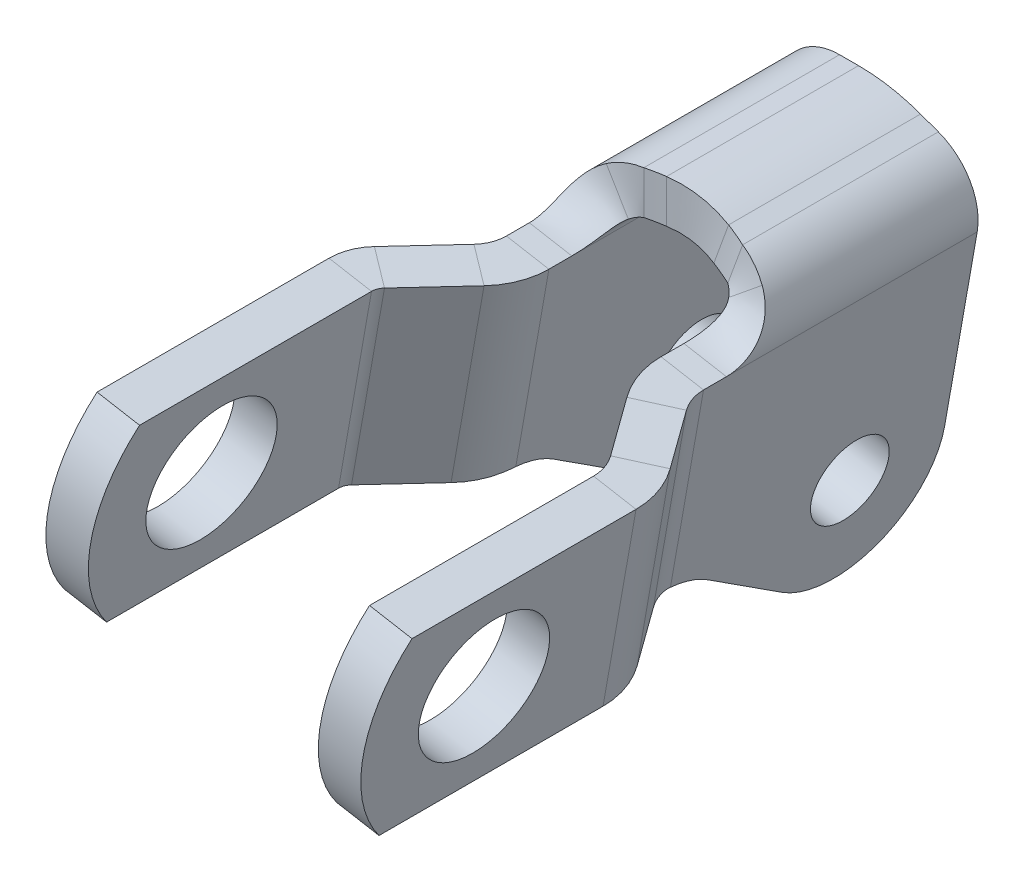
ISO-10303-21;
HEADER;
FILE_DESCRIPTION(('STEP AP214'),'2;1');
FILE_NAME('part.step','',(''),(''),'','','');
FILE_SCHEMA(('AUTOMOTIVE_DESIGN { 1 0 10303 214 1 1 1 1 }'));
ENDSEC;
DATA;
#1=APPLICATION_CONTEXT('core data for automotive mechanical design processes');
#2=APPLICATION_PROTOCOL_DEFINITION('international standard','automotive_design',2000,#1);
#3=PRODUCT_CONTEXT('',#1,'mechanical');
#4=PRODUCT('Part','Part','',(#3));
#5=PRODUCT_RELATED_PRODUCT_CATEGORY('part','',(#4));
#6=PRODUCT_DEFINITION_FORMATION('','',#4);
#7=PRODUCT_DEFINITION_CONTEXT('part definition',#1,'design');
#8=PRODUCT_DEFINITION('design','',#6,#7);
#9=PRODUCT_DEFINITION_SHAPE('','',#8);
#10=(LENGTH_UNIT() NAMED_UNIT(*) SI_UNIT(.MILLI.,.METRE.));
#11=(NAMED_UNIT(*) PLANE_ANGLE_UNIT() SI_UNIT($,.RADIAN.));
#12=(NAMED_UNIT(*) SI_UNIT($,.STERADIAN.) SOLID_ANGLE_UNIT());
#13=UNCERTAINTY_MEASURE_WITH_UNIT(LENGTH_MEASURE(1.E-05),#10,'distance_accuracy_value','');
#14=(GEOMETRIC_REPRESENTATION_CONTEXT(3) GLOBAL_UNCERTAINTY_ASSIGNED_CONTEXT((#13)) GLOBAL_UNIT_ASSIGNED_CONTEXT((#10,
#11,#12)) REPRESENTATION_CONTEXT('',''));
#15=CARTESIAN_POINT('',(0.,0.,0.));
#16=DIRECTION('',(0.,0.,1.));
#17=DIRECTION('',(1.,0.,0.));
#18=AXIS2_PLACEMENT_3D('',#15,#16,#17);
#19=CARTESIAN_POINT('',(-24.8306814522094,-36.7081003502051,76.0452012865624));
#20=DIRECTION('',(-0.984807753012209,0.173648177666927,0.));
#21=DIRECTION('',(-0.173648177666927,-0.984807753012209,0.));
#22=AXIS2_PLACEMENT_3D('',#19,#20,#21);
#23=PLANE('',#22);
#24=CARTESIAN_POINT('',(-21.0753134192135,-15.4103498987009,62.0452012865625));
#25=DIRECTION('',(0.984807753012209,-0.173648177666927,0.));
#26=DIRECTION('',(-0.173648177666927,-0.984807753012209,0.));
#27=AXIS2_PLACEMENT_3D('',#24,#25,#26);
#28=CIRCLE('',#27,7.5);
#29=CARTESIAN_POINT('',(-22.3776747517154,-22.7964080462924,62.0452012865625));
#30=VERTEX_POINT('',#29);
#31=EDGE_CURVE('E352',#30,#30,#28,.T.);
#32=ORIENTED_EDGE('',*,*,#31,.T.);
#33=EDGE_LOOP('',(#32));
#34=FACE_BOUND('',#33,.T.);
#35=DIRECTION('',(0.,0.,1.));
#36=VECTOR('',#35,1.);
#37=CARTESIAN_POINT('',(-19.1651834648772,-4.57746461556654,76.0452012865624));
#38=LINE('',#37,#36);
#39=CARTESIAN_POINT('',(-19.1651834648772,-4.57746461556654,45.419648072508));
#40=VERTEX_POINT('',#39);
#41=CARTESIAN_POINT('',(-19.1651834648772,-4.57746461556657,72.2930081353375));
#42=VERTEX_POINT('',#41);
#43=EDGE_CURVE('E372',#40,#42,#38,.T.);
#44=ORIENTED_EDGE('',*,*,#43,.F.);
#45=DIRECTION('',(-0.173648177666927,-0.984807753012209,0.));
#46=VECTOR('',#45,1.);
#47=CARTESIAN_POINT('',(-24.8306814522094,-36.7081003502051,45.419648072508));
#48=LINE('',#47,#46);
#49=CARTESIAN_POINT('',(-22.9854433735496,-26.2432351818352,45.419648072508));
#50=VERTEX_POINT('',#49);
#51=EDGE_CURVE('E52',#40,#50,#48,.T.);
#52=ORIENTED_EDGE('',*,*,#51,.T.);
#53=DIRECTION('',(0.,0.,1.));
#54=VECTOR('',#53,1.);
#55=CARTESIAN_POINT('',(-22.9854433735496,-26.2432351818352,30.8424087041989));
#56=LINE('',#55,#54);
#57=CARTESIAN_POINT('',(-22.9854433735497,-26.2432351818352,72.2930081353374));
#58=VERTEX_POINT('',#57);
#59=EDGE_CURVE('E362',#50,#58,#56,.T.);
#60=ORIENTED_EDGE('',*,*,#59,.T.);
#61=CARTESIAN_POINT('',(-21.0753134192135,-15.4103498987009,58.0452012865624));
#62=DIRECTION('',(-0.984807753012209,0.173648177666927,0.));
#63=DIRECTION('',(-0.173648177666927,-0.984807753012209,0.));
#64=AXIS2_PLACEMENT_3D('',#61,#62,#63);
#65=CIRCLE('',#64,18.);
#66=EDGE_CURVE('E358',#58,#42,#65,.T.);
#67=ORIENTED_EDGE('',*,*,#66,.T.);
#68=EDGE_LOOP('',(#44,#52,#60,#67));
#69=FACE_BOUND('',#68,.T.);
#70=ADVANCED_FACE('F31',(#34,#69),#23,.T.);
#71=CARTESIAN_POINT('',(-19.9066426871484,-37.5763412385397,76.0452012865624));
#72=DIRECTION('',(-0.984807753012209,0.173648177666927,0.));
#73=DIRECTION('',(-0.173648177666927,-0.984807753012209,0.));
#74=AXIS2_PLACEMENT_3D('',#71,#72,#73);
#75=PLANE('',#74);
#76=DIRECTION('',(-0.173648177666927,-0.984807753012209,0.));
#77=VECTOR('',#76,1.);
#78=CARTESIAN_POINT('',(-19.9066426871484,-37.5763412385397,45.419648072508));
#79=LINE('',#78,#77);
#80=CARTESIAN_POINT('',(-14.2411446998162,-5.4457055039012,45.419648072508));
#81=VERTEX_POINT('',#80);
#82=CARTESIAN_POINT('',(-18.0614046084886,-27.1114760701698,45.419648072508));
#83=VERTEX_POINT('',#82);
#84=EDGE_CURVE('E379',#81,#83,#79,.T.);
#85=ORIENTED_EDGE('',*,*,#84,.F.);
#86=DIRECTION('',(0.,0.,1.));
#87=VECTOR('',#86,1.);
#88=CARTESIAN_POINT('',(-14.2411446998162,-5.44570550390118,76.0452012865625));
#89=LINE('',#88,#87);
#90=CARTESIAN_POINT('',(-14.2411446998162,-5.44570550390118,72.2930081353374));
#91=VERTEX_POINT('',#90);
#92=EDGE_CURVE('E376',#81,#91,#89,.T.);
#93=ORIENTED_EDGE('',*,*,#92,.T.);
#94=CARTESIAN_POINT('',(-16.1512746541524,-16.2785907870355,58.0452012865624));
#95=DIRECTION('',(-0.984807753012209,0.173648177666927,0.));
#96=DIRECTION('',(-0.173648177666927,-0.984807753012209,0.));
#97=AXIS2_PLACEMENT_3D('',#94,#95,#96);
#98=CIRCLE('',#97,18.);
#99=CARTESIAN_POINT('',(-18.0614046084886,-27.1114760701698,72.2930081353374));
#100=VERTEX_POINT('',#99);
#101=EDGE_CURVE('E366',#100,#91,#98,.T.);
#102=ORIENTED_EDGE('',*,*,#101,.F.);
#103=DIRECTION('',(0.,0.,1.));
#104=VECTOR('',#103,1.);
#105=CARTESIAN_POINT('',(-18.0614046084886,-27.1114760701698,30.8424087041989));
#106=LINE('',#105,#104);
#107=EDGE_CURVE('E370',#83,#100,#106,.T.);
#108=ORIENTED_EDGE('',*,*,#107,.F.);
#109=EDGE_LOOP('',(#85,#93,#102,#108));
#110=FACE_BOUND('',#109,.T.);
#111=CARTESIAN_POINT('',(-16.1512746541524,-16.2785907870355,62.0452012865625));
#112=DIRECTION('',(0.984807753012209,-0.173648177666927,0.));
#113=DIRECTION('',(-0.173648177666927,-0.984807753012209,0.));
#114=AXIS2_PLACEMENT_3D('',#111,#112,#113);
#115=CIRCLE('',#114,7.5);
#116=CARTESIAN_POINT('',(-17.4536359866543,-23.6646489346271,62.0452012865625));
#117=VERTEX_POINT('',#116);
#118=EDGE_CURVE('E355',#117,#117,#115,.T.);
#119=ORIENTED_EDGE('',*,*,#118,.F.);
#120=EDGE_LOOP('',(#119));
#121=FACE_BOUND('',#120,.T.);
#122=ADVANCED_FACE('F33',(#110,#121),#75,.F.);
#123=CARTESIAN_POINT('',(-14.2411446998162,-5.44570550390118,76.0452012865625));
#124=DIRECTION('',(-0.173648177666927,-0.984807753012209,0.));
#125=DIRECTION('',(0.984807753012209,-0.173648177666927,0.));
#126=AXIS2_PLACEMENT_3D('',#123,#124,#125);
#127=PLANE('',#126);
#128=DIRECTION('',(0.984807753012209,-0.173648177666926,0.));
#129=VECTOR('',#128,1.);
#130=CARTESIAN_POINT('',(-14.2411446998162,-5.44570550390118,45.419648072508));
#131=LINE('',#130,#129);
#132=EDGE_CURVE('E39',#40,#81,#131,.T.);
#133=ORIENTED_EDGE('',*,*,#132,.F.);
#134=ORIENTED_EDGE('',*,*,#43,.T.);
#135=DIRECTION('',(0.984807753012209,-0.173648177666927,0.));
#136=VECTOR('',#135,1.);
#137=CARTESIAN_POINT('',(-19.1651834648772,-4.57746461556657,72.2930081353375));
#138=LINE('',#137,#136);
#139=EDGE_CURVE('E359',#42,#91,#138,.T.);
#140=ORIENTED_EDGE('',*,*,#139,.T.);
#141=ORIENTED_EDGE('',*,*,#92,.F.);
#142=EDGE_LOOP('',(#133,#134,#140,#141));
#143=FACE_BOUND('',#142,.T.);
#144=ADVANCED_FACE('F1474',(#143),#127,.F.);
#145=CARTESIAN_POINT('',(-21.0753134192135,-15.4103498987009,58.0452012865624));
#146=DIRECTION('',(0.984807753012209,-0.173648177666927,0.));
#147=DIRECTION('',(0.173648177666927,0.984807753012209,0.));
#148=AXIS2_PLACEMENT_3D('',#145,#146,#147);
#149=CYLINDRICAL_SURFACE('',#148,18.);
#150=ORIENTED_EDGE('',*,*,#101,.T.);
#151=ORIENTED_EDGE('',*,*,#139,.F.);
#152=ORIENTED_EDGE('',*,*,#66,.F.);
#153=DIRECTION('',(0.984807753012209,-0.173648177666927,0.));
#154=VECTOR('',#153,1.);
#155=CARTESIAN_POINT('',(-22.9854433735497,-26.2432351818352,72.2930081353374));
#156=LINE('',#155,#154);
#157=EDGE_CURVE('E363',#58,#100,#156,.T.);
#158=ORIENTED_EDGE('',*,*,#157,.T.);
#159=EDGE_LOOP('',(#150,#151,#152,#158));
#160=FACE_BOUND('',#159,.T.);
#161=ADVANCED_FACE('F1478',(#160),#149,.T.);
#162=CARTESIAN_POINT('',(-22.9854433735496,-26.2432351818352,30.8424087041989));
#163=DIRECTION('',(0.173648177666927,0.984807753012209,0.));
#164=DIRECTION('',(-0.984807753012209,0.173648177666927,0.));
#165=AXIS2_PLACEMENT_3D('',#162,#163,#164);
#166=PLANE('',#165);
#167=DIRECTION('',(-0.984807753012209,0.173648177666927,0.));
#168=VECTOR('',#167,1.);
#169=CARTESIAN_POINT('',(-22.9854433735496,-26.2432351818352,45.419648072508));
#170=LINE('',#169,#168);
#171=EDGE_CURVE('E11',#83,#50,#170,.T.);
#172=ORIENTED_EDGE('',*,*,#171,.F.);
#173=ORIENTED_EDGE('',*,*,#107,.T.);
#174=ORIENTED_EDGE('',*,*,#157,.F.);
#175=ORIENTED_EDGE('',*,*,#59,.F.);
#176=EDGE_LOOP('',(#172,#173,#174,#175));
#177=FACE_BOUND('',#176,.T.);
#178=ADVANCED_FACE('F1480',(#177),#166,.F.);
#179=CARTESIAN_POINT('',(-21.0753134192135,-15.4103498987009,62.0452012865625));
#180=DIRECTION('',(0.984807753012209,-0.173648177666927,0.));
#181=DIRECTION('',(0.173648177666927,0.984807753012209,0.));
#182=AXIS2_PLACEMENT_3D('',#179,#180,#181);
#183=CYLINDRICAL_SURFACE('',#182,7.5);
#184=ORIENTED_EDGE('',*,*,#31,.F.);
#185=EDGE_LOOP('',(#184));
#186=FACE_BOUND('',#185,.T.);
#187=ORIENTED_EDGE('',*,*,#118,.T.);
#188=EDGE_LOOP('',(#187));
#189=FACE_BOUND('',#188,.T.);
#190=ADVANCED_FACE('F1483',(#186,#189),#183,.F.);
#191=CARTESIAN_POINT('',(-38.4024159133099,-34.3150373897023,71.6112415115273));
#192=DIRECTION('',(-0.806707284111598,0.142244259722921,-0.573576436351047));
#193=DIRECTION('',(-0.173648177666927,-0.984807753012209,0.));
#194=AXIS2_PLACEMENT_3D('',#191,#192,#193);
#195=PLANE('',#194);
#196=DIRECTION('',(-0.564862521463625,0.0996005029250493,0.819152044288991));
#197=VECTOR('',#196,1.);
#198=CARTESIAN_POINT('',(-32.7369179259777,-2.18440165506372,71.6112415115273));
#199=LINE('',#198,#197);
#200=CARTESIAN_POINT('',(-9.17692277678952,-6.33866446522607,37.4450197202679));
#201=VERTEX_POINT('',#200);
#202=CARTESIAN_POINT('',(-13.884943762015,-5.50851333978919,44.2724951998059));
#203=VERTEX_POINT('',#202);
#204=EDGE_CURVE('E325',#201,#203,#199,.T.);
#205=ORIENTED_EDGE('',*,*,#204,.T.);
#206=DIRECTION('',(-0.173648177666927,-0.984807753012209,0.));
#207=VECTOR('',#206,1.);
#208=CARTESIAN_POINT('',(-19.5504417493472,-37.6391490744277,44.2724951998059));
#209=LINE('',#208,#207);
#210=CARTESIAN_POINT('',(-17.7052036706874,-27.1742839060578,44.2724951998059));
#211=VERTEX_POINT('',#210);
#212=EDGE_CURVE('E300',#203,#211,#209,.T.);
#213=ORIENTED_EDGE('',*,*,#212,.T.);
#214=DIRECTION('',(-0.564862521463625,0.0996005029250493,0.819152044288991));
#215=VECTOR('',#214,1.);
#216=CARTESIAN_POINT('',(-11.023814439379,-28.3523930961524,34.583281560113));
#217=LINE('',#216,#215);
#218=CARTESIAN_POINT('',(-12.9971826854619,-28.0044350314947,37.4450197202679));
#219=VERTEX_POINT('',#218);
#220=EDGE_CURVE('E337',#219,#211,#217,.T.);
#221=ORIENTED_EDGE('',*,*,#220,.F.);
#222=DIRECTION('',(-0.173648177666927,-0.984807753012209,0.));
#223=VECTOR('',#222,1.);
#224=CARTESIAN_POINT('',(-14.8424207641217,-38.4693001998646,37.4450197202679));
#225=LINE('',#224,#223);
#226=EDGE_CURVE('E333',#201,#219,#225,.T.);
#227=ORIENTED_EDGE('',*,*,#226,.F.);
#228=EDGE_LOOP('',(#205,#213,#221,#227));
#229=FACE_BOUND('',#228,.T.);
#230=ADVANCED_FACE('F331',(#229),#195,.F.);
#231=CARTESIAN_POINT('',(-32.7369179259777,-2.18440165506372,71.6112415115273));
#232=DIRECTION('',(-0.173648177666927,-0.984807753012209,0.));
#233=DIRECTION('',(0.806707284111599,-0.142244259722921,0.573576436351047));
#234=AXIS2_PLACEMENT_3D('',#231,#232,#233);
#235=PLANE('',#234);
#236=DIRECTION('',(-0.564862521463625,0.0996005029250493,0.819152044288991));
#237=VECTOR('',#236,1.);
#238=CARTESIAN_POINT('',(-36.7704543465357,-1.47318035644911,68.7433593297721));
#239=LINE('',#238,#237);
#240=CARTESIAN_POINT('',(-13.2104591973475,-5.62744316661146,34.5771375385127));
#241=VERTEX_POINT('',#240);
#242=CARTESIAN_POINT('',(-17.918480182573,-4.79729204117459,41.4046130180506));
#243=VERTEX_POINT('',#242);
#244=EDGE_CURVE('E328',#241,#243,#239,.T.);
#245=ORIENTED_EDGE('',*,*,#244,.T.);
#246=DIRECTION('',(0.806707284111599,-0.142244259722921,0.573576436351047));
#247=VECTOR('',#246,1.);
#248=CARTESIAN_POINT('',(-13.884943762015,-5.50851333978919,44.2724951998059));
#249=LINE('',#248,#247);
#250=EDGE_CURVE('E312',#243,#203,#249,.T.);
#251=ORIENTED_EDGE('',*,*,#250,.T.);
#252=ORIENTED_EDGE('',*,*,#204,.F.);
#253=DIRECTION('',(0.806707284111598,-0.142244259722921,0.573576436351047));
#254=VECTOR('',#253,1.);
#255=CARTESIAN_POINT('',(-9.17692277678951,-6.33866446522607,37.4450197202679));
#256=LINE('',#255,#254);
#257=EDGE_CURVE('E343',#241,#201,#256,.T.);
#258=ORIENTED_EDGE('',*,*,#257,.F.);
#259=EDGE_LOOP('',(#245,#251,#252,#258));
#260=FACE_BOUND('',#259,.T.);
#261=ADVANCED_FACE('F324',(#260),#235,.F.);
#262=CARTESIAN_POINT('',(-15.0573508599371,-27.6411717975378,31.7153993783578));
#263=DIRECTION('',(0.173648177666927,0.984807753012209,0.));
#264=DIRECTION('',(-0.806707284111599,0.142244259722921,-0.573576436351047));
#265=AXIS2_PLACEMENT_3D('',#262,#263,#264);
#266=PLANE('',#265);
#267=ORIENTED_EDGE('',*,*,#220,.T.);
#268=DIRECTION('',(-0.806707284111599,0.142244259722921,-0.573576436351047));
#269=VECTOR('',#268,1.);
#270=CARTESIAN_POINT('',(-21.7387400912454,-26.4630626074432,41.4046130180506));
#271=LINE('',#270,#269);
#272=CARTESIAN_POINT('',(-21.7387400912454,-26.4630626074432,41.4046130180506));
#273=VERTEX_POINT('',#272);
#274=EDGE_CURVE('E329',#211,#273,#271,.T.);
#275=ORIENTED_EDGE('',*,*,#274,.T.);
#276=DIRECTION('',(-0.564862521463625,0.0996005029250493,0.819152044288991));
#277=VECTOR('',#276,1.);
#278=CARTESIAN_POINT('',(-15.0573508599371,-27.6411717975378,31.7153993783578));
#279=LINE('',#278,#277);
#280=CARTESIAN_POINT('',(-17.0307191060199,-27.2932137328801,34.5771375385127));
#281=VERTEX_POINT('',#280);
#282=EDGE_CURVE('E1217',#281,#273,#279,.T.);
#283=ORIENTED_EDGE('',*,*,#282,.F.);
#284=DIRECTION('',(-0.806707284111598,0.142244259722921,-0.573576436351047));
#285=VECTOR('',#284,1.);
#286=CARTESIAN_POINT('',(-17.0307191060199,-27.2932137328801,34.5771375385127));
#287=LINE('',#286,#285);
#288=EDGE_CURVE('E345',#219,#281,#287,.T.);
#289=ORIENTED_EDGE('',*,*,#288,.F.);
#290=EDGE_LOOP('',(#267,#275,#283,#289));
#291=FACE_BOUND('',#290,.T.);
#292=ADVANCED_FACE('F1496',(#291),#266,.F.);
#293=CARTESIAN_POINT('',(-42.4359523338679,-33.6038160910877,68.7433593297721));
#294=DIRECTION('',(-0.806707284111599,0.142244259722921,-0.573576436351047));
#295=DIRECTION('',(-0.173648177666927,-0.984807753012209,0.));
#296=AXIS2_PLACEMENT_3D('',#293,#294,#295);
#297=PLANE('',#296);
#298=DIRECTION('',(-0.173648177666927,-0.984807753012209,0.));
#299=VECTOR('',#298,1.);
#300=CARTESIAN_POINT('',(-23.5839781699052,-36.9279277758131,41.4046130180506));
#301=LINE('',#300,#299);
#302=EDGE_CURVE('E311',#243,#273,#301,.T.);
#303=ORIENTED_EDGE('',*,*,#302,.F.);
#304=ORIENTED_EDGE('',*,*,#244,.F.);
#305=DIRECTION('',(-0.173648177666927,-0.984807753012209,0.));
#306=VECTOR('',#305,1.);
#307=CARTESIAN_POINT('',(-18.8759571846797,-37.75807890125,34.5771375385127));
#308=LINE('',#307,#306);
#309=EDGE_CURVE('E335',#241,#281,#308,.T.);
#310=ORIENTED_EDGE('',*,*,#309,.T.);
#311=ORIENTED_EDGE('',*,*,#282,.T.);
#312=EDGE_LOOP('',(#303,#304,#310,#311));
#313=FACE_BOUND('',#312,.T.);
#314=ADVANCED_FACE('F1492',(#313),#297,.T.);
#315=CARTESIAN_POINT('',(18.3999011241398,-5.23689389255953,76.0990454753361));
#316=DIRECTION('',(0.984807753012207,-0.173648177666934,0.));
#317=DIRECTION('',(0.173648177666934,0.984807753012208,0.));
#318=AXIS2_PLACEMENT_3D('',#315,#316,#317);
#319=PLANE('',#318);
#320=CARTESIAN_POINT('',(15.469814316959,-21.8542419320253,62.0990454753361));
#321=DIRECTION('',(-0.984807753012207,0.173648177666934,0.));
#322=DIRECTION('',(-0.173648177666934,-0.984807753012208,0.));
#323=AXIS2_PLACEMENT_3D('',#320,#321,#322);
#324=CIRCLE('',#323,7.5);
#325=CARTESIAN_POINT('',(14.167452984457,-29.2403000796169,62.0990454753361));
#326=VERTEX_POINT('',#325);
#327=EDGE_CURVE('E1178',#326,#326,#324,.T.);
#328=ORIENTED_EDGE('',*,*,#327,.T.);
#329=EDGE_LOOP('',(#328));
#330=FACE_BOUND('',#329,.T.);
#331=DIRECTION('',(0.,0.,-1.));
#332=VECTOR('',#331,1.);
#333=CARTESIAN_POINT('',(13.5596843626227,-32.6871272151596,30.8962528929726));
#334=LINE('',#333,#332);
#335=CARTESIAN_POINT('',(13.5596843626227,-32.6871272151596,72.3468523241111));
#336=VERTEX_POINT('',#335);
#337=CARTESIAN_POINT('',(13.5596843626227,-32.6871272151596,46.3897901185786));
#338=VERTEX_POINT('',#337);
#339=EDGE_CURVE('E1191',#336,#338,#334,.T.);
#340=ORIENTED_EDGE('',*,*,#339,.T.);
#341=DIRECTION('',(0.173648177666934,0.984807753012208,0.));
#342=VECTOR('',#341,1.);
#343=CARTESIAN_POINT('',(18.3999011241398,-5.23689389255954,46.3897901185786));
#344=LINE('',#343,#342);
#345=CARTESIAN_POINT('',(17.3799442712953,-11.021356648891,46.3897901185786));
#346=VERTEX_POINT('',#345);
#347=EDGE_CURVE('E1206',#338,#346,#344,.T.);
#348=ORIENTED_EDGE('',*,*,#347,.T.);
#349=DIRECTION('',(0.,0.,-1.));
#350=VECTOR('',#349,1.);
#351=CARTESIAN_POINT('',(17.3799442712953,-11.021356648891,-1.90095452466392));
#352=LINE('',#351,#350);
#353=CARTESIAN_POINT('',(17.3799442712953,-11.021356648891,72.3468523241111));
#354=VERTEX_POINT('',#353);
#355=EDGE_CURVE('E1198',#354,#346,#352,.T.);
#356=ORIENTED_EDGE('',*,*,#355,.F.);
#357=CARTESIAN_POINT('',(15.469814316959,-21.8542419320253,58.0990454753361));
#358=DIRECTION('',(0.984807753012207,-0.173648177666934,0.));
#359=DIRECTION('',(-0.173648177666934,-0.984807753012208,0.));
#360=AXIS2_PLACEMENT_3D('',#357,#358,#359);
#361=CIRCLE('',#360,18.);
#362=EDGE_CURVE('E1188',#354,#336,#361,.T.);
#363=ORIENTED_EDGE('',*,*,#362,.T.);
#364=EDGE_LOOP('',(#340,#348,#356,#363));
#365=FACE_BOUND('',#364,.T.);
#366=ADVANCED_FACE('F1495',(#330,#365),#319,.T.);
#367=CARTESIAN_POINT('',(13.4758623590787,-4.36865300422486,76.0990454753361));
#368=DIRECTION('',(0.984807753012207,-0.173648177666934,0.));
#369=DIRECTION('',(0.173648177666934,0.984807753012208,0.));
#370=AXIS2_PLACEMENT_3D('',#367,#368,#369);
#371=PLANE('',#370);
#372=DIRECTION('',(0.173648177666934,0.984807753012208,0.));
#373=VECTOR('',#372,1.);
#374=CARTESIAN_POINT('',(13.4758623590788,-4.36865300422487,46.3897901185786));
#375=LINE('',#374,#373);
#376=CARTESIAN_POINT('',(8.63564559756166,-31.8188863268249,46.3897901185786));
#377=VERTEX_POINT('',#376);
#378=CARTESIAN_POINT('',(12.4559055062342,-10.1531157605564,46.3897901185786));
#379=VERTEX_POINT('',#378);
#380=EDGE_CURVE('E1208',#377,#379,#375,.T.);
#381=ORIENTED_EDGE('',*,*,#380,.F.);
#382=DIRECTION('',(0.,0.,-1.));
#383=VECTOR('',#382,1.);
#384=CARTESIAN_POINT('',(8.63564559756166,-31.8188863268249,30.8962528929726));
#385=LINE('',#384,#383);
#386=CARTESIAN_POINT('',(8.63564559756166,-31.8188863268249,72.3468523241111));
#387=VERTEX_POINT('',#386);
#388=EDGE_CURVE('E1186',#387,#377,#385,.T.);
#389=ORIENTED_EDGE('',*,*,#388,.F.);
#390=CARTESIAN_POINT('',(10.5457755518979,-20.9860010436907,58.0990454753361));
#391=DIRECTION('',(0.984807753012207,-0.173648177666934,0.));
#392=DIRECTION('',(-0.173648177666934,-0.984807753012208,0.));
#393=AXIS2_PLACEMENT_3D('',#390,#391,#392);
#394=CIRCLE('',#393,18.);
#395=CARTESIAN_POINT('',(12.4559055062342,-10.1531157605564,72.3468523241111));
#396=VERTEX_POINT('',#395);
#397=EDGE_CURVE('E1184',#396,#387,#394,.T.);
#398=ORIENTED_EDGE('',*,*,#397,.F.);
#399=DIRECTION('',(0.,0.,-1.));
#400=VECTOR('',#399,1.);
#401=CARTESIAN_POINT('',(12.4559055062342,-10.1531157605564,-1.90095452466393));
#402=LINE('',#401,#400);
#403=EDGE_CURVE('E1203',#396,#379,#402,.T.);
#404=ORIENTED_EDGE('',*,*,#403,.T.);
#405=EDGE_LOOP('',(#381,#389,#398,#404));
#406=FACE_BOUND('',#405,.T.);
#407=CARTESIAN_POINT('',(10.5457755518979,-20.9860010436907,62.0990454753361));
#408=DIRECTION('',(-0.984807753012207,0.173648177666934,0.));
#409=DIRECTION('',(-0.173648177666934,-0.984807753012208,0.));
#410=AXIS2_PLACEMENT_3D('',#407,#408,#409);
#411=CIRCLE('',#410,7.5);
#412=CARTESIAN_POINT('',(9.24341421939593,-28.3720591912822,62.0990454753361));
#413=VERTEX_POINT('',#412);
#414=EDGE_CURVE('E1181',#413,#413,#411,.T.);
#415=ORIENTED_EDGE('',*,*,#414,.F.);
#416=EDGE_LOOP('',(#415));
#417=FACE_BOUND('',#416,.T.);
#418=ADVANCED_FACE('F1503',(#406,#417),#371,.F.);
#419=CARTESIAN_POINT('',(12.4559055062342,-10.1531157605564,76.0990454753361));
#420=DIRECTION('',(-0.173648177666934,-0.984807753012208,0.));
#421=DIRECTION('',(0.984807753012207,-0.173648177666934,0.));
#422=AXIS2_PLACEMENT_3D('',#419,#420,#421);
#423=PLANE('',#422);
#424=DIRECTION('',(0.984807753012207,-0.173648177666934,0.));
#425=VECTOR('',#424,1.);
#426=CARTESIAN_POINT('',(12.4559055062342,-10.1531157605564,46.3897901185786));
#427=LINE('',#426,#425);
#428=EDGE_CURVE('E1211',#379,#346,#427,.T.);
#429=ORIENTED_EDGE('',*,*,#428,.F.);
#430=ORIENTED_EDGE('',*,*,#403,.F.);
#431=DIRECTION('',(-0.984807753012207,0.173648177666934,0.));
#432=VECTOR('',#431,1.);
#433=CARTESIAN_POINT('',(17.3799442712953,-11.0213566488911,72.3468523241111));
#434=LINE('',#433,#432);
#435=EDGE_CURVE('E1194',#354,#396,#434,.T.);
#436=ORIENTED_EDGE('',*,*,#435,.F.);
#437=ORIENTED_EDGE('',*,*,#355,.T.);
#438=EDGE_LOOP('',(#429,#430,#436,#437));
#439=FACE_BOUND('',#438,.T.);
#440=ADVANCED_FACE('F1506',(#439),#423,.F.);
#441=CARTESIAN_POINT('',(15.469814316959,-21.8542419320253,58.0990454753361));
#442=DIRECTION('',(-0.984807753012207,0.173648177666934,0.));
#443=DIRECTION('',(-0.173648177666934,-0.984807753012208,0.));
#444=AXIS2_PLACEMENT_3D('',#441,#442,#443);
#445=CYLINDRICAL_SURFACE('',#444,18.);
#446=ORIENTED_EDGE('',*,*,#397,.T.);
#447=DIRECTION('',(-0.984807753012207,0.173648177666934,0.));
#448=VECTOR('',#447,1.);
#449=CARTESIAN_POINT('',(13.5596843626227,-32.6871272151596,72.3468523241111));
#450=LINE('',#449,#448);
#451=EDGE_CURVE('E1195',#336,#387,#450,.T.);
#452=ORIENTED_EDGE('',*,*,#451,.F.);
#453=ORIENTED_EDGE('',*,*,#362,.F.);
#454=ORIENTED_EDGE('',*,*,#435,.T.);
#455=EDGE_LOOP('',(#446,#452,#453,#454));
#456=FACE_BOUND('',#455,.T.);
#457=ADVANCED_FACE('F1513',(#456),#445,.T.);
#458=CARTESIAN_POINT('',(13.5596843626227,-32.6871272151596,30.8962528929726));
#459=DIRECTION('',(0.173648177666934,0.984807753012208,0.));
#460=DIRECTION('',(-0.984807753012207,0.173648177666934,0.));
#461=AXIS2_PLACEMENT_3D('',#458,#459,#460);
#462=PLANE('',#461);
#463=DIRECTION('',(-0.984807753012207,0.173648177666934,0.));
#464=VECTOR('',#463,1.);
#465=CARTESIAN_POINT('',(13.5596843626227,-32.6871272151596,46.3897901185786));
#466=LINE('',#465,#464);
#467=EDGE_CURVE('E1214',#338,#377,#466,.T.);
#468=ORIENTED_EDGE('',*,*,#467,.F.);
#469=ORIENTED_EDGE('',*,*,#339,.F.);
#470=ORIENTED_EDGE('',*,*,#451,.T.);
#471=ORIENTED_EDGE('',*,*,#388,.T.);
#472=EDGE_LOOP('',(#468,#469,#470,#471));
#473=FACE_BOUND('',#472,.T.);
#474=ADVANCED_FACE('F1517',(#473),#462,.F.);
#475=CARTESIAN_POINT('',(15.469814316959,-21.8542419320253,62.0990454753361));
#476=DIRECTION('',(-0.984807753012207,0.173648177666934,0.));
#477=DIRECTION('',(-0.173648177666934,-0.984807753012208,0.));
#478=AXIS2_PLACEMENT_3D('',#475,#476,#477);
#479=CYLINDRICAL_SURFACE('',#478,7.5);
#480=ORIENTED_EDGE('',*,*,#327,.F.);
#481=EDGE_LOOP('',(#480));
#482=FACE_BOUND('',#481,.T.);
#483=ORIENTED_EDGE('',*,*,#414,.T.);
#484=EDGE_LOOP('',(#483));
#485=FACE_BOUND('',#484,.T.);
#486=ADVANCED_FACE('F1521',(#482,#485),#479,.F.);
#487=CARTESIAN_POINT('',(31.9549164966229,-7.62700882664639,71.6112415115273));
#488=DIRECTION('',(0.806707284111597,-0.142244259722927,-0.573576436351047));
#489=DIRECTION('',(0.173648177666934,0.984807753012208,0.));
#490=AXIS2_PLACEMENT_3D('',#487,#488,#489);
#491=PLANE('',#490);
#492=DIRECTION('',(-0.564862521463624,0.0996005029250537,-0.819152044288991));
#493=VECTOR('',#492,1.);
#494=CARTESIAN_POINT('',(1.58133633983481,-30.5750212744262,34.583281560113));
#495=LINE('',#494,#493);
#496=CARTESIAN_POINT('',(7.7451432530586,-31.6618667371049,43.5219079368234));
#497=VERTEX_POINT('',#496);
#498=CARTESIAN_POINT('',(3.55470458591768,-30.9229793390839,37.4450197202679));
#499=VERTEX_POINT('',#498);
#500=EDGE_CURVE('E1146',#497,#499,#495,.T.);
#501=ORIENTED_EDGE('',*,*,#500,.F.);
#502=DIRECTION('',(0.173648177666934,0.984807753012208,0.));
#503=VECTOR('',#502,1.);
#504=CARTESIAN_POINT('',(12.5853600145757,-4.21163341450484,43.5219079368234));
#505=LINE('',#504,#503);
#506=CARTESIAN_POINT('',(11.5654031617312,-9.99609617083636,43.5219079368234));
#507=VERTEX_POINT('',#506);
#508=EDGE_CURVE('E1172',#497,#507,#505,.T.);
#509=ORIENTED_EDGE('',*,*,#508,.T.);
#510=DIRECTION('',(-0.564862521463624,0.0996005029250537,-0.819152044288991));
#511=VECTOR('',#510,1.);
#512=CARTESIAN_POINT('',(-13.1243170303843,-5.64263235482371,7.71738205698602));
#513=LINE('',#512,#511);
#514=CARTESIAN_POINT('',(7.37496449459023,-9.25720877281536,37.4450197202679));
#515=VERTEX_POINT('',#514);
#516=EDGE_CURVE('E1153',#507,#515,#513,.T.);
#517=ORIENTED_EDGE('',*,*,#516,.T.);
#518=DIRECTION('',(0.173648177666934,0.984807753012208,0.));
#519=VECTOR('',#518,1.);
#520=CARTESIAN_POINT('',(8.39492134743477,-3.47274601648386,37.4450197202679));
#521=LINE('',#520,#519);
#522=EDGE_CURVE('E1155',#499,#515,#521,.T.);
#523=ORIENTED_EDGE('',*,*,#522,.F.);
#524=EDGE_LOOP('',(#501,#509,#517,#523));
#525=FACE_BOUND('',#524,.T.);
#526=ADVANCED_FACE('F1525',(#525),#491,.F.);
#527=CARTESIAN_POINT('',(30.9349596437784,-13.4114715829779,71.6112415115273));
#528=DIRECTION('',(-0.173648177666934,-0.984807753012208,0.));
#529=DIRECTION('',(0.806707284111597,-0.142244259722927,-0.573576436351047));
#530=AXIS2_PLACEMENT_3D('',#527,#528,#529);
#531=PLANE('',#530);
#532=ORIENTED_EDGE('',*,*,#516,.F.);
#533=DIRECTION('',(0.806707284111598,-0.142244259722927,-0.573576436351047));
#534=VECTOR('',#533,1.);
#535=CARTESIAN_POINT('',(11.5654031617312,-9.99609617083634,43.5219079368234));
#536=LINE('',#535,#534);
#537=CARTESIAN_POINT('',(15.5989395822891,-10.707317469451,40.6540257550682));
#538=VERTEX_POINT('',#537);
#539=EDGE_CURVE('E1169',#507,#538,#536,.T.);
#540=ORIENTED_EDGE('',*,*,#539,.T.);
#541=DIRECTION('',(-0.564862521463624,0.0996005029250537,-0.819152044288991));
#542=VECTOR('',#541,1.);
#543=CARTESIAN_POINT('',(-9.09078060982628,-6.35385365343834,4.84949987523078));
#544=LINE('',#543,#542);
#545=CARTESIAN_POINT('',(11.4085009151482,-9.96843007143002,34.5771375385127));
#546=VERTEX_POINT('',#545);
#547=EDGE_CURVE('E1150',#538,#546,#544,.T.);
#548=ORIENTED_EDGE('',*,*,#547,.T.);
#549=DIRECTION('',(0.806707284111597,-0.142244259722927,-0.573576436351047));
#550=VECTOR('',#549,1.);
#551=CARTESIAN_POINT('',(7.37496449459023,-9.25720877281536,37.4450197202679));
#552=LINE('',#551,#550);
#553=EDGE_CURVE('E1160',#515,#546,#552,.T.);
#554=ORIENTED_EDGE('',*,*,#553,.F.);
#555=EDGE_LOOP('',(#532,#540,#548,#554));
#556=FACE_BOUND('',#555,.T.);
#557=ADVANCED_FACE('F1529',(#556),#531,.F.);
#558=CARTESIAN_POINT('',(5.61487276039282,-31.2862425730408,31.7153993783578));
#559=DIRECTION('',(0.173648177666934,0.984807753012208,0.));
#560=DIRECTION('',(-0.806707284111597,0.142244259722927,0.573576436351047));
#561=AXIS2_PLACEMENT_3D('',#558,#559,#560);
#562=PLANE('',#561);
#563=DIRECTION('',(-0.564862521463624,0.0996005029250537,-0.819152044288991));
#564=VECTOR('',#563,1.);
#565=CARTESIAN_POINT('',(5.61487276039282,-31.2862425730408,31.7153993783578));
#566=LINE('',#565,#564);
#567=CARTESIAN_POINT('',(11.7786796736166,-32.3730880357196,40.6540257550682));
#568=VERTEX_POINT('',#567);
#569=CARTESIAN_POINT('',(7.58824100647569,-31.6342006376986,34.5771375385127));
#570=VERTEX_POINT('',#569);
#571=EDGE_CURVE('E1148',#568,#570,#566,.T.);
#572=ORIENTED_EDGE('',*,*,#571,.F.);
#573=DIRECTION('',(-0.806707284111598,0.142244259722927,0.573576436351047));
#574=VECTOR('',#573,1.);
#575=CARTESIAN_POINT('',(11.7786796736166,-32.3730880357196,40.6540257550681));
#576=LINE('',#575,#574);
#577=EDGE_CURVE('E1166',#568,#497,#576,.T.);
#578=ORIENTED_EDGE('',*,*,#577,.T.);
#579=ORIENTED_EDGE('',*,*,#500,.T.);
#580=DIRECTION('',(-0.806707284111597,0.142244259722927,0.573576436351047));
#581=VECTOR('',#580,1.);
#582=CARTESIAN_POINT('',(7.58824100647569,-31.6342006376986,34.5771375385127));
#583=LINE('',#582,#581);
#584=EDGE_CURVE('E1163',#570,#499,#583,.T.);
#585=ORIENTED_EDGE('',*,*,#584,.F.);
#586=EDGE_LOOP('',(#572,#578,#579,#585));
#587=FACE_BOUND('',#586,.T.);
#588=ADVANCED_FACE('F1534',(#587),#562,.F.);
#589=CARTESIAN_POINT('',(35.9884529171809,-8.33823012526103,68.7433593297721));
#590=DIRECTION('',(0.806707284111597,-0.142244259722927,-0.573576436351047));
#591=DIRECTION('',(0.173648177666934,0.984807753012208,0.));
#592=AXIS2_PLACEMENT_3D('',#589,#590,#591);
#593=PLANE('',#592);
#594=DIRECTION('',(0.173648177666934,0.984807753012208,0.));
#595=VECTOR('',#594,1.);
#596=CARTESIAN_POINT('',(16.6188964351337,-4.92285471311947,40.6540257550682));
#597=LINE('',#596,#595);
#598=EDGE_CURVE('E1175',#568,#538,#597,.T.);
#599=ORIENTED_EDGE('',*,*,#598,.F.);
#600=ORIENTED_EDGE('',*,*,#571,.T.);
#601=DIRECTION('',(0.173648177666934,0.984807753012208,0.));
#602=VECTOR('',#601,1.);
#603=CARTESIAN_POINT('',(12.4284577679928,-4.1839673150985,34.5771375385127));
#604=LINE('',#603,#602);
#605=EDGE_CURVE('E1158',#570,#546,#604,.T.);
#606=ORIENTED_EDGE('',*,*,#605,.T.);
#607=ORIENTED_EDGE('',*,*,#547,.F.);
#608=EDGE_LOOP('',(#599,#600,#606,#607));
#609=FACE_BOUND('',#608,.T.);
#610=ADVANCED_FACE('F1531',(#609),#593,.T.);
#611=CARTESIAN_POINT('',(5.59395980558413,-8.9431695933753,78.));
#612=DIRECTION('',(-0.173648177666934,-0.984807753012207,0.));
#613=DIRECTION('',(0.984807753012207,-0.173648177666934,0.));
#614=AXIS2_PLACEMENT_3D('',#611,#612,#613);
#615=PLANE('',#614);
#616=CARTESIAN_POINT('',(5.59395980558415,-8.94316959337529,29.0533700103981));
#617=CARTESIAN_POINT('',(10.5179985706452,-9.81141048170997,29.0533700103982));
#618=B_SPLINE_CURVE_WITH_KNOTS('',1,(#616,#617),.UNSPECIFIED.,.F.,.F.,(2,2),(0.,1.),.UNSPECIFIED.);
#619=CARTESIAN_POINT('',(5.59395980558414,-8.94316959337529,29.0533700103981));
#620=VERTEX_POINT('',#619);
#621=CARTESIAN_POINT('',(10.5179985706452,-9.81141048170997,29.0533700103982));
#622=VERTEX_POINT('',#621);
#623=EDGE_CURVE('E753',#620,#622,#618,.T.);
#624=ORIENTED_EDGE('',*,*,#623,.F.);
#625=DIRECTION('',(0.,0.,-1.));
#626=VECTOR('',#625,1.);
#627=CARTESIAN_POINT('',(5.59395980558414,-8.94316959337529,0.));
#628=LINE('',#627,#626);
#629=CARTESIAN_POINT('',(5.59395980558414,-8.94316959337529,31.7092553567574));
#630=VERTEX_POINT('',#629);
#631=EDGE_CURVE('E1327',#630,#620,#628,.T.);
#632=ORIENTED_EDGE('',*,*,#631,.F.);
#633=DIRECTION('',(0.984807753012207,-0.173648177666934,0.));
#634=VECTOR('',#633,1.);
#635=CARTESIAN_POINT('',(5.59395980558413,-8.94316959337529,31.7092553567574));
#636=LINE('',#635,#634);
#637=CARTESIAN_POINT('',(10.5179985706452,-9.81141048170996,31.7092553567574));
#638=VERTEX_POINT('',#637);
#639=EDGE_CURVE('E1343',#630,#638,#636,.T.);
#640=ORIENTED_EDGE('',*,*,#639,.T.);
#641=DIRECTION('',(0.,0.,-1.));
#642=VECTOR('',#641,1.);
#643=CARTESIAN_POINT('',(10.5179985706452,-9.81141048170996,0.));
#644=LINE('',#643,#642);
#645=EDGE_CURVE('E1319',#638,#622,#644,.T.);
#646=ORIENTED_EDGE('',*,*,#645,.T.);
#647=EDGE_LOOP('',(#624,#632,#640,#646));
#648=FACE_BOUND('',#647,.T.);
#649=ADVANCED_FACE('F1120',(#648),#615,.F.);
#650=CARTESIAN_POINT('',(4.9612568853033,-41.3252585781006,32.7972074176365));
#651=DIRECTION('',(-0.984807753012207,0.173648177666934,0.));
#652=DIRECTION('',(-0.173648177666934,-0.984807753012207,0.));
#653=AXIS2_PLACEMENT_3D('',#650,#651,#652);
#654=CYLINDRICAL_SURFACE('',#653,10.);
#655=CARTESIAN_POINT('',(4.9612568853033,-41.3252585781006,32.7972074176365));
#656=DIRECTION('',(-0.984807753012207,0.173648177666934,0.));
#657=DIRECTION('',(-0.173648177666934,-0.984807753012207,0.));
#658=AXIS2_PLACEMENT_3D('',#655,#656,#657);
#659=CIRCLE('',#658,10.);
#660=CARTESIAN_POINT('',(6.68743122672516,-31.5356374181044,31.7092553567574));
#661=VERTEX_POINT('',#660);
#662=CARTESIAN_POINT('',(6.38369948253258,-33.2581857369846,27.0614430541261));
#663=VERTEX_POINT('',#662);
#664=EDGE_CURVE('E1140',#661,#663,#659,.T.);
#665=ORIENTED_EDGE('',*,*,#664,.F.);
#666=CARTESIAN_POINT('',(1.76339246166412,-30.6673965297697,31.7092553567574));
#667=CARTESIAN_POINT('',(6.68743122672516,-31.5356374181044,31.7092553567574));
#668=B_SPLINE_CURVE_WITH_KNOTS('',1,(#666,#667),.UNSPECIFIED.,.F.,.F.,(2,2),(0.,1.),.UNSPECIFIED.);
#669=CARTESIAN_POINT('',(1.76339246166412,-30.6673965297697,31.7092553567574));
#670=VERTEX_POINT('',#669);
#671=EDGE_CURVE('E627',#661,#670,#668,.F.);
#672=ORIENTED_EDGE('',*,*,#671,.T.);
#673=CARTESIAN_POINT('',(0.0372181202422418,-40.4570176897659,32.7972074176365));
#674=DIRECTION('',(-0.984807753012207,0.173648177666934,0.));
#675=DIRECTION('',(-0.173648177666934,-0.984807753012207,0.));
#676=AXIS2_PLACEMENT_3D('',#673,#674,#675);
#677=CIRCLE('',#676,10.);
#678=CARTESIAN_POINT('',(1.45966071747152,-32.3899448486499,27.0614430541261));
#679=VERTEX_POINT('',#678);
#680=EDGE_CURVE('E1297',#670,#679,#677,.T.);
#681=ORIENTED_EDGE('',*,*,#680,.T.);
#682=DIRECTION('',(-0.984807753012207,0.173648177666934,0.));
#683=VECTOR('',#682,1.);
#684=CARTESIAN_POINT('',(6.38369948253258,-33.2581857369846,27.0614430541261));
#685=LINE('',#684,#683);
#686=EDGE_CURVE('E1307',#663,#679,#685,.T.);
#687=ORIENTED_EDGE('',*,*,#686,.F.);
#688=EDGE_LOOP('',(#665,#672,#681,#687));
#689=FACE_BOUND('',#688,.T.);
#690=ADVANCED_FACE('F1115',(#689),#654,.F.);
#691=CARTESIAN_POINT('',(6.61391665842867,-3.15870683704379,78.));
#692=DIRECTION('',(0.984807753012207,-0.173648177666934,0.));
#693=DIRECTION('',(0.173648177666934,0.984807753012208,0.));
#694=AXIS2_PLACEMENT_3D('',#691,#692,#693);
#695=PLANE('',#694);
#696=CARTESIAN_POINT('',(1.83859177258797,-30.2409200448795,11.));
#697=DIRECTION('',(-0.984807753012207,0.173648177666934,0.));
#698=DIRECTION('',(-0.173648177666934,-0.984807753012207,0.));
#699=AXIS2_PLACEMENT_3D('',#696,#697,#698);
#700=CIRCLE('',#699,4.5);
#701=CARTESIAN_POINT('',(1.05717497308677,-34.6725549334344,11.));
#702=VERTEX_POINT('',#701);
#703=EDGE_CURVE('E1294',#702,#702,#700,.T.);
#704=ORIENTED_EDGE('',*,*,#703,.F.);
#705=EDGE_LOOP('',(#704));
#706=FACE_BOUND('',#705,.T.);
#707=ORIENTED_EDGE('',*,*,#680,.F.);
#708=DIRECTION('',(0.173648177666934,0.984807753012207,0.));
#709=VECTOR('',#708,1.);
#710=CARTESIAN_POINT('',(6.61391665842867,-3.15870683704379,31.7092553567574));
#711=LINE('',#710,#709);
#712=EDGE_CURVE('E1137',#670,#630,#711,.T.);
#713=ORIENTED_EDGE('',*,*,#712,.T.);
#714=ORIENTED_EDGE('',*,*,#631,.T.);
#715=DIRECTION('',(0.,0.,1.));
#716=VECTOR('',#715,1.);
#717=CARTESIAN_POINT('',(5.59395980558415,-8.94316959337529,-106.101235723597));
#718=LINE('',#717,#716);
#719=CARTESIAN_POINT('',(5.59395980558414,-8.9431695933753,0.));
#720=VERTEX_POINT('',#719);
#721=EDGE_CURVE('E1374',#620,#720,#718,.F.);
#722=ORIENTED_EDGE('',*,*,#721,.T.);
#723=DIRECTION('',(-0.173648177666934,-0.984807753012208,0.));
#724=VECTOR('',#723,1.);
#725=CARTESIAN_POINT('',(6.61391665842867,-3.15870683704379,0.));
#726=LINE('',#725,#724);
#727=CARTESIAN_POINT('',(1.83859177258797,-30.2409200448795,0.));
#728=VERTEX_POINT('',#727);
#729=EDGE_CURVE('E1322',#720,#728,#726,.T.);
#730=ORIENTED_EDGE('',*,*,#729,.T.);
#731=CARTESIAN_POINT('',(1.83859177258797,-30.2409200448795,11.));
#732=DIRECTION('',(0.984807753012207,-0.173648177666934,0.));
#733=DIRECTION('',(-0.173648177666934,-0.984807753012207,0.));
#734=AXIS2_PLACEMENT_3D('',#731,#732,#733);
#735=CIRCLE('',#734,11.);
#736=CARTESIAN_POINT('',(0.273904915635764,-39.1147001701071,17.3093407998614));
#737=VERTEX_POINT('',#736);
#738=EDGE_CURVE('E1143',#737,#728,#735,.T.);
#739=ORIENTED_EDGE('',*,*,#738,.F.);
#740=DIRECTION('',(-0.0996005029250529,-0.564862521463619,-0.819152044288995));
#741=VECTOR('',#740,1.);
#742=CARTESIAN_POINT('',(0.273904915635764,-39.1147001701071,17.3093407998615));
#743=LINE('',#742,#741);
#744=EDGE_CURVE('E1298',#679,#737,#743,.T.);
#745=ORIENTED_EDGE('',*,*,#744,.F.);
#746=EDGE_LOOP('',(#707,#713,#714,#722,#730,#739,#745));
#747=FACE_BOUND('',#746,.T.);
#748=ADVANCED_FACE('F1119',(#706,#747),#695,.F.);
#749=CARTESIAN_POINT('',(-154.990392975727,25.3364931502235,0.));
#750=DIRECTION('',(0.,0.,1.));
#751=DIRECTION('',(-0.173648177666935,-0.984807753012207,0.));
#752=AXIS2_PLACEMENT_3D('',#749,#750,#751);
#753=PLANE('',#752);
#754=DIRECTION('',(-0.984807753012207,0.173648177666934,0.));
#755=VECTOR('',#754,1.);
#756=CARTESIAN_POINT('',(6.76263053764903,-31.1091609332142,0.));
#757=LINE('',#756,#755);
#758=CARTESIAN_POINT('',(6.76263053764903,-31.1091609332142,0.));
#759=VERTEX_POINT('',#758);
#760=EDGE_CURVE('E1308',#759,#728,#757,.T.);
#761=ORIENTED_EDGE('',*,*,#760,.T.);
#762=ORIENTED_EDGE('',*,*,#729,.F.);
#763=DIRECTION('',(0.984807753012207,-0.173648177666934,0.));
#764=VECTOR('',#763,1.);
#765=CARTESIAN_POINT('',(-156.010349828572,19.552030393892,0.));
#766=LINE('',#765,#764);
#767=CARTESIAN_POINT('',(10.5179985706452,-9.81141048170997,0.));
#768=VERTEX_POINT('',#767);
#769=EDGE_CURVE('E1366',#720,#768,#766,.T.);
#770=ORIENTED_EDGE('',*,*,#769,.T.);
#771=DIRECTION('',(-0.173648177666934,-0.984807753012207,0.));
#772=VECTOR('',#771,1.);
#773=CARTESIAN_POINT('',(11.5379554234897,-4.02694772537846,0.));
#774=LINE('',#773,#772);
#775=EDGE_CURVE('E1311',#768,#759,#774,.T.);
#776=ORIENTED_EDGE('',*,*,#775,.T.);
#777=EDGE_LOOP('',(#761,#762,#770,#776));
#778=FACE_BOUND('',#777,.T.);
#779=ADVANCED_FACE('F1542',(#778),#753,.F.);
#780=CARTESIAN_POINT('',(11.5379554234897,-4.02694772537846,78.));
#781=DIRECTION('',(0.984807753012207,-0.173648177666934,0.));
#782=DIRECTION('',(0.173648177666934,0.984807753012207,0.));
#783=AXIS2_PLACEMENT_3D('',#780,#781,#782);
#784=PLANE('',#783);
#785=DIRECTION('',(0.173648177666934,0.984807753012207,0.));
#786=VECTOR('',#785,1.);
#787=CARTESIAN_POINT('',(11.5379554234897,-4.02694772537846,31.7092553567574));
#788=LINE('',#787,#786);
#789=EDGE_CURVE('E1130',#661,#638,#788,.T.);
#790=ORIENTED_EDGE('',*,*,#789,.F.);
#791=ORIENTED_EDGE('',*,*,#664,.T.);
#792=DIRECTION('',(-0.0996005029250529,-0.564862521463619,-0.819152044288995));
#793=VECTOR('',#792,1.);
#794=CARTESIAN_POINT('',(5.19794368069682,-39.9829410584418,17.3093407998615));
#795=LINE('',#794,#793);
#796=CARTESIAN_POINT('',(5.19794368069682,-39.9829410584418,17.3093407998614));
#797=VERTEX_POINT('',#796);
#798=EDGE_CURVE('E1142',#663,#797,#795,.T.);
#799=ORIENTED_EDGE('',*,*,#798,.T.);
#800=CARTESIAN_POINT('',(6.76263053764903,-31.1091609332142,11.));
#801=DIRECTION('',(0.984807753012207,-0.173648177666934,0.));
#802=DIRECTION('',(-0.173648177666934,-0.984807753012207,0.));
#803=AXIS2_PLACEMENT_3D('',#800,#801,#802);
#804=CIRCLE('',#803,11.);
#805=EDGE_CURVE('E1304',#797,#759,#804,.T.);
#806=ORIENTED_EDGE('',*,*,#805,.T.);
#807=ORIENTED_EDGE('',*,*,#775,.F.);
#808=DIRECTION('',(0.,0.,1.));
#809=VECTOR('',#808,1.);
#810=CARTESIAN_POINT('',(10.5179985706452,-9.81141048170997,-106.101235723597));
#811=LINE('',#810,#809);
#812=EDGE_CURVE('E1384',#622,#768,#811,.F.);
#813=ORIENTED_EDGE('',*,*,#812,.F.);
#814=ORIENTED_EDGE('',*,*,#645,.F.);
#815=EDGE_LOOP('',(#790,#791,#799,#806,#807,#813,#814));
#816=FACE_BOUND('',#815,.T.);
#817=CARTESIAN_POINT('',(6.76263053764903,-31.1091609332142,11.));
#818=DIRECTION('',(-0.984807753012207,0.173648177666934,0.));
#819=DIRECTION('',(-0.173648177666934,-0.984807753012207,0.));
#820=AXIS2_PLACEMENT_3D('',#817,#818,#819);
#821=CIRCLE('',#820,4.5);
#822=CARTESIAN_POINT('',(5.98121373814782,-35.5407958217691,11.));
#823=VERTEX_POINT('',#822);
#824=EDGE_CURVE('E1291',#823,#823,#821,.T.);
#825=ORIENTED_EDGE('',*,*,#824,.T.);
#826=EDGE_LOOP('',(#825));
#827=FACE_BOUND('',#826,.T.);
#828=ADVANCED_FACE('F1110',(#816,#827),#784,.T.);
#829=CARTESIAN_POINT('',(6.76263053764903,-31.1091609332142,11.));
#830=DIRECTION('',(-0.984807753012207,0.173648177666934,0.));
#831=DIRECTION('',(-0.173648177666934,-0.984807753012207,0.));
#832=AXIS2_PLACEMENT_3D('',#829,#830,#831);
#833=CYLINDRICAL_SURFACE('',#832,11.);
#834=ORIENTED_EDGE('',*,*,#738,.T.);
#835=ORIENTED_EDGE('',*,*,#760,.F.);
#836=ORIENTED_EDGE('',*,*,#805,.F.);
#837=DIRECTION('',(-0.984807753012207,0.173648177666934,0.));
#838=VECTOR('',#837,1.);
#839=CARTESIAN_POINT('',(5.19794368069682,-39.9829410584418,17.3093407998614));
#840=LINE('',#839,#838);
#841=EDGE_CURVE('E1312',#797,#737,#840,.T.);
#842=ORIENTED_EDGE('',*,*,#841,.T.);
#843=EDGE_LOOP('',(#834,#835,#836,#842));
#844=FACE_BOUND('',#843,.T.);
#845=ADVANCED_FACE('F1107',(#844),#833,.T.);
#846=CARTESIAN_POINT('',(5.19794368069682,-39.9829410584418,17.3093407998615));
#847=DIRECTION('',(0.142244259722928,0.806707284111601,-0.573576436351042));
#848=DIRECTION('',(0.0996005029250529,0.564862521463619,0.819152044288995));
#849=AXIS2_PLACEMENT_3D('',#846,#847,#848);
#850=PLANE('',#849);
#851=ORIENTED_EDGE('',*,*,#744,.T.);
#852=ORIENTED_EDGE('',*,*,#841,.F.);
#853=ORIENTED_EDGE('',*,*,#798,.F.);
#854=ORIENTED_EDGE('',*,*,#686,.T.);
#855=EDGE_LOOP('',(#851,#852,#853,#854));
#856=FACE_BOUND('',#855,.T.);
#857=ADVANCED_FACE('F1105',(#856),#850,.F.);
#858=CARTESIAN_POINT('',(6.76263053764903,-31.1091609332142,11.));
#859=DIRECTION('',(-0.984807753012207,0.173648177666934,0.));
#860=DIRECTION('',(-0.173648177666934,-0.984807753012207,0.));
#861=AXIS2_PLACEMENT_3D('',#858,#859,#860);
#862=CYLINDRICAL_SURFACE('',#861,4.5);
#863=ORIENTED_EDGE('',*,*,#824,.F.);
#864=EDGE_LOOP('',(#863));
#865=FACE_BOUND('',#864,.T.);
#866=ORIENTED_EDGE('',*,*,#703,.T.);
#867=EDGE_LOOP('',(#866));
#868=FACE_BOUND('',#867,.T.);
#869=ADVANCED_FACE('F1102',(#865,#868),#862,.F.);
#870=CARTESIAN_POINT('',(-17.8766985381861,-37.2983108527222,32.7972074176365));
#871=DIRECTION('',(0.984807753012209,-0.173648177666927,0.));
#872=DIRECTION('',(0.173648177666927,0.984807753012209,0.));
#873=AXIS2_PLACEMENT_3D('',#870,#871,#872);
#874=CYLINDRICAL_SURFACE('',#873,10.);
#875=CARTESIAN_POINT('',(-12.9526597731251,-38.1665517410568,32.7972074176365));
#876=DIRECTION('',(0.984807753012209,-0.173648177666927,0.));
#877=DIRECTION('',(-0.173648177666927,-0.984807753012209,0.));
#878=AXIS2_PLACEMENT_3D('',#875,#876,#877);
#879=CIRCLE('',#878,10.);
#880=CARTESIAN_POINT('',(-11.5302171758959,-30.0994788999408,27.0614430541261));
#881=VERTEX_POINT('',#880);
#882=CARTESIAN_POINT('',(-11.2264854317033,-28.3769305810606,31.7092553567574));
#883=VERTEX_POINT('',#882);
#884=EDGE_CURVE('E1041',#881,#883,#879,.T.);
#885=ORIENTED_EDGE('',*,*,#884,.T.);
#886=CARTESIAN_POINT('',(-16.1505241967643,-27.508689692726,31.7092553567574));
#887=CARTESIAN_POINT('',(-11.2264854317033,-28.3769305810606,31.7092553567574));
#888=B_SPLINE_CURVE_WITH_KNOTS('',1,(#886,#887),.UNSPECIFIED.,.F.,.F.,(2,2),(0.,1.),.UNSPECIFIED.);
#889=CARTESIAN_POINT('',(-16.1505241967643,-27.508689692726,31.7092553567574));
#890=VERTEX_POINT('',#889);
#891=EDGE_CURVE('E1220',#883,#890,#888,.F.);
#892=ORIENTED_EDGE('',*,*,#891,.T.);
#893=CARTESIAN_POINT('',(-17.8766985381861,-37.2983108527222,32.7972074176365));
#894=DIRECTION('',(0.984807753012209,-0.173648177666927,0.));
#895=DIRECTION('',(-0.173648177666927,-0.984807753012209,0.));
#896=AXIS2_PLACEMENT_3D('',#893,#894,#895);
#897=CIRCLE('',#896,10.);
#898=CARTESIAN_POINT('',(-16.4542559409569,-29.2312380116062,27.0614430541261));
#899=VERTEX_POINT('',#898);
#900=EDGE_CURVE('E1035',#899,#890,#897,.T.);
#901=ORIENTED_EDGE('',*,*,#900,.F.);
#902=DIRECTION('',(0.984807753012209,-0.173648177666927,0.));
#903=VECTOR('',#902,1.);
#904=CARTESIAN_POINT('',(-16.4542559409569,-29.2312380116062,27.0614430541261));
#905=LINE('',#904,#903);
#906=EDGE_CURVE('E1030',#899,#881,#905,.T.);
#907=ORIENTED_EDGE('',*,*,#906,.T.);
#908=EDGE_LOOP('',(#885,#892,#901,#907));
#909=FACE_BOUND('',#908,.T.);
#910=ADVANCED_FACE('F1097',(#909),#874,.F.);
#911=CARTESIAN_POINT('',(-13.0614160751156,-38.7833393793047,78.));
#912=DIRECTION('',(-0.984807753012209,0.173648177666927,0.));
#913=DIRECTION('',(-0.173648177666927,-0.984807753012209,0.));
#914=AXIS2_PLACEMENT_3D('',#911,#912,#913);
#915=PLANE('',#914);
#916=CARTESIAN_POINT('',(-11.1512861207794,-27.9504540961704,11.));
#917=DIRECTION('',(0.984807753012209,-0.173648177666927,0.));
#918=DIRECTION('',(-0.173648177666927,-0.984807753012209,0.));
#919=AXIS2_PLACEMENT_3D('',#916,#917,#918);
#920=CIRCLE('',#919,4.5);
#921=CARTESIAN_POINT('',(-10.3698693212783,-23.5188192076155,11.));
#922=VERTEX_POINT('',#921);
#923=EDGE_CURVE('E1043',#922,#922,#920,.T.);
#924=ORIENTED_EDGE('',*,*,#923,.F.);
#925=EDGE_LOOP('',(#924));
#926=FACE_BOUND('',#925,.T.);
#927=DIRECTION('',(0.,0.,1.));
#928=VECTOR('',#927,1.);
#929=CARTESIAN_POINT('',(-7.39591808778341,-6.65270364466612,78.));
#930=LINE('',#929,#928);
#931=CARTESIAN_POINT('',(-7.39591808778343,-6.65270364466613,0.));
#932=VERTEX_POINT('',#931);
#933=CARTESIAN_POINT('',(-7.39591808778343,-6.65270364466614,29.0533700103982));
#934=VERTEX_POINT('',#933);
#935=EDGE_CURVE('E1063',#932,#934,#930,.T.);
#936=ORIENTED_EDGE('',*,*,#935,.T.);
#937=CARTESIAN_POINT('',(-7.39591808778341,-6.65270364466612,31.7092553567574));
#938=VERTEX_POINT('',#937);
#939=EDGE_CURVE('E1060',#934,#938,#930,.T.);
#940=ORIENTED_EDGE('',*,*,#939,.T.);
#941=DIRECTION('',(-0.173648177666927,-0.984807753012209,0.));
#942=VECTOR('',#941,1.);
#943=CARTESIAN_POINT('',(-13.0614160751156,-38.7833393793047,31.7092553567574));
#944=LINE('',#943,#942);
#945=EDGE_CURVE('E1221',#938,#883,#944,.T.);
#946=ORIENTED_EDGE('',*,*,#945,.T.);
#947=ORIENTED_EDGE('',*,*,#884,.F.);
#948=DIRECTION('',(0.0996005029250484,0.56486252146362,0.819152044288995));
#949=VECTOR('',#948,1.);
#950=CARTESIAN_POINT('',(-12.7159729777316,-36.824234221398,17.3093407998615));
#951=LINE('',#950,#949);
#952=CARTESIAN_POINT('',(-12.7159729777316,-36.824234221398,17.3093407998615));
#953=VERTEX_POINT('',#952);
#954=EDGE_CURVE('E1038',#953,#881,#951,.T.);
#955=ORIENTED_EDGE('',*,*,#954,.F.);
#956=CARTESIAN_POINT('',(-11.1512861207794,-27.9504540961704,11.));
#957=DIRECTION('',(-0.984807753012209,0.173648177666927,0.));
#958=DIRECTION('',(-0.173648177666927,-0.984807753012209,0.));
#959=AXIS2_PLACEMENT_3D('',#956,#957,#958);
#960=CIRCLE('',#959,11.);
#961=CARTESIAN_POINT('',(-11.1512861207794,-27.9504540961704,0.));
#962=VERTEX_POINT('',#961);
#963=EDGE_CURVE('E1025',#962,#953,#960,.T.);
#964=ORIENTED_EDGE('',*,*,#963,.F.);
#965=DIRECTION('',(0.173648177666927,0.984807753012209,0.));
#966=VECTOR('',#965,1.);
#967=CARTESIAN_POINT('',(-13.0614160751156,-38.7833393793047,0.));
#968=LINE('',#967,#966);
#969=EDGE_CURVE('E1865',#962,#932,#968,.T.);
#970=ORIENTED_EDGE('',*,*,#969,.T.);
#971=EDGE_LOOP('',(#936,#940,#946,#947,#955,#964,#970));
#972=FACE_BOUND('',#971,.T.);
#973=ADVANCED_FACE('F1088',(#926,#972),#915,.F.);
#974=CARTESIAN_POINT('',(-7.39591808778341,-6.65270364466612,78.));
#975=DIRECTION('',(-0.173648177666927,-0.984807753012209,0.));
#976=DIRECTION('',(0.984807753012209,-0.173648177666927,0.));
#977=AXIS2_PLACEMENT_3D('',#974,#975,#976);
#978=PLANE('',#977);
#979=ORIENTED_EDGE('',*,*,#939,.F.);
#980=CARTESIAN_POINT('',(-12.3199568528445,-5.78446275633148,29.0533700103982));
#981=CARTESIAN_POINT('',(-7.39591808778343,-6.65270364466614,29.0533700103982));
#982=B_SPLINE_CURVE_WITH_KNOTS('',1,(#980,#981),.UNSPECIFIED.,.F.,.F.,(2,2),(0.,1.),.UNSPECIFIED.);
#983=CARTESIAN_POINT('',(-12.3199568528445,-5.78446275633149,29.0533700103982));
#984=VERTEX_POINT('',#983);
#985=EDGE_CURVE('E875',#934,#984,#982,.F.);
#986=ORIENTED_EDGE('',*,*,#985,.T.);
#987=DIRECTION('',(0.,0.,1.));
#988=VECTOR('',#987,1.);
#989=CARTESIAN_POINT('',(-12.3199568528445,-5.78446275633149,78.));
#990=LINE('',#989,#988);
#991=CARTESIAN_POINT('',(-12.3199568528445,-5.78446275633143,31.7092553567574));
#992=VERTEX_POINT('',#991);
#993=EDGE_CURVE('E1049',#984,#992,#990,.T.);
#994=ORIENTED_EDGE('',*,*,#993,.T.);
#995=DIRECTION('',(0.984807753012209,-0.173648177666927,0.));
#996=VECTOR('',#995,1.);
#997=CARTESIAN_POINT('',(-7.39591808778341,-6.65270364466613,31.7092553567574));
#998=LINE('',#997,#996);
#999=EDGE_CURVE('E1863',#992,#938,#998,.T.);
#1000=ORIENTED_EDGE('',*,*,#999,.T.);
#1001=EDGE_LOOP('',(#979,#986,#994,#1000));
#1002=FACE_BOUND('',#1001,.T.);
#1003=ADVANCED_FACE('F1077',(#1002),#978,.F.);
#1004=CARTESIAN_POINT('',(148.542893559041,-67.2785393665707,0.));
#1005=DIRECTION('',(0.,0.,1.));
#1006=DIRECTION('',(0.173648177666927,0.984807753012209,0.));
#1007=AXIS2_PLACEMENT_3D('',#1004,#1005,#1006);
#1008=PLANE('',#1007);
#1009=ORIENTED_EDGE('',*,*,#969,.F.);
#1010=DIRECTION('',(0.984807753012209,-0.173648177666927,0.));
#1011=VECTOR('',#1010,1.);
#1012=CARTESIAN_POINT('',(-16.0753248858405,-27.0822132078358,0.));
#1013=LINE('',#1012,#1011);
#1014=CARTESIAN_POINT('',(-16.0753248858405,-27.0822132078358,0.));
#1015=VERTEX_POINT('',#1014);
#1016=EDGE_CURVE('E1023',#1015,#962,#1013,.T.);
#1017=ORIENTED_EDGE('',*,*,#1016,.F.);
#1018=DIRECTION('',(0.173648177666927,0.984807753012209,0.));
#1019=VECTOR('',#1018,1.);
#1020=CARTESIAN_POINT('',(-17.9854548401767,-37.91509849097,0.));
#1021=LINE('',#1020,#1019);
#1022=CARTESIAN_POINT('',(-12.3199568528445,-5.78446275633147,0.));
#1023=VERTEX_POINT('',#1022);
#1024=EDGE_CURVE('E1066',#1015,#1023,#1021,.T.);
#1025=ORIENTED_EDGE('',*,*,#1024,.T.);
#1026=DIRECTION('',(-0.984807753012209,0.173648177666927,0.));
#1027=VECTOR('',#1026,1.);
#1028=CARTESIAN_POINT('',(154.208391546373,-35.1479036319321,0.));
#1029=LINE('',#1028,#1027);
#1030=EDGE_CURVE('E1864',#932,#1023,#1029,.T.);
#1031=ORIENTED_EDGE('',*,*,#1030,.F.);
#1032=EDGE_LOOP('',(#1009,#1017,#1025,#1031));
#1033=FACE_BOUND('',#1032,.T.);
#1034=ADVANCED_FACE('F1087',(#1033),#1008,.F.);
#1035=CARTESIAN_POINT('',(-17.9854548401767,-37.91509849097,78.));
#1036=DIRECTION('',(-0.984807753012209,0.173648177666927,0.));
#1037=DIRECTION('',(-0.173648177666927,-0.984807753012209,0.));
#1038=AXIS2_PLACEMENT_3D('',#1035,#1036,#1037);
#1039=PLANE('',#1038);
#1040=DIRECTION('',(-0.173648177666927,-0.984807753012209,0.));
#1041=VECTOR('',#1040,1.);
#1042=CARTESIAN_POINT('',(-17.9854548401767,-37.91509849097,31.7092553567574));
#1043=LINE('',#1042,#1041);
#1044=EDGE_CURVE('E1218',#992,#890,#1043,.T.);
#1045=ORIENTED_EDGE('',*,*,#1044,.F.);
#1046=ORIENTED_EDGE('',*,*,#993,.F.);
#1047=EDGE_CURVE('E1058',#1023,#984,#990,.T.);
#1048=ORIENTED_EDGE('',*,*,#1047,.F.);
#1049=ORIENTED_EDGE('',*,*,#1024,.F.);
#1050=CARTESIAN_POINT('',(-16.0753248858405,-27.0822132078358,11.));
#1051=DIRECTION('',(-0.984807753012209,0.173648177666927,0.));
#1052=DIRECTION('',(-0.173648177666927,-0.984807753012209,0.));
#1053=AXIS2_PLACEMENT_3D('',#1050,#1051,#1052);
#1054=CIRCLE('',#1053,11.);
#1055=CARTESIAN_POINT('',(-17.6400117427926,-35.9559933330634,17.3093407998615));
#1056=VERTEX_POINT('',#1055);
#1057=EDGE_CURVE('E1029',#1015,#1056,#1054,.T.);
#1058=ORIENTED_EDGE('',*,*,#1057,.T.);
#1059=DIRECTION('',(0.0996005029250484,0.56486252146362,0.819152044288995));
#1060=VECTOR('',#1059,1.);
#1061=CARTESIAN_POINT('',(-17.6400117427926,-35.9559933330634,17.3093407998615));
#1062=LINE('',#1061,#1060);
#1063=EDGE_CURVE('E1032',#1056,#899,#1062,.T.);
#1064=ORIENTED_EDGE('',*,*,#1063,.T.);
#1065=ORIENTED_EDGE('',*,*,#900,.T.);
#1066=EDGE_LOOP('',(#1045,#1046,#1048,#1049,#1058,#1064,#1065));
#1067=FACE_BOUND('',#1066,.T.);
#1068=CARTESIAN_POINT('',(-16.0753248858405,-27.0822132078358,11.));
#1069=DIRECTION('',(0.984807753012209,-0.173648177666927,0.));
#1070=DIRECTION('',(-0.173648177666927,-0.984807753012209,0.));
#1071=AXIS2_PLACEMENT_3D('',#1068,#1069,#1070);
#1072=CIRCLE('',#1071,4.5);
#1073=CARTESIAN_POINT('',(-15.2939080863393,-22.6505783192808,11.));
#1074=VERTEX_POINT('',#1073);
#1075=EDGE_CURVE('E1046',#1074,#1074,#1072,.T.);
#1076=ORIENTED_EDGE('',*,*,#1075,.T.);
#1077=EDGE_LOOP('',(#1076));
#1078=FACE_BOUND('',#1077,.T.);
#1079=ADVANCED_FACE('F1091',(#1067,#1078),#1039,.T.);
#1080=CARTESIAN_POINT('',(-16.0753248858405,-27.0822132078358,11.));
#1081=DIRECTION('',(0.984807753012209,-0.173648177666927,0.));
#1082=DIRECTION('',(0.173648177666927,0.984807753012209,0.));
#1083=AXIS2_PLACEMENT_3D('',#1080,#1081,#1082);
#1084=CYLINDRICAL_SURFACE('',#1083,4.5);
#1085=CARTESIAN_POINT('',(-15.2939080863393,-22.6505783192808,11.));
#1086=CARTESIAN_POINT('',(-15.2426160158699,-22.659622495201,11.));
#1087=CARTESIAN_POINT('',(-15.1913239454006,-22.6686666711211,11.));
#1088=CARTESIAN_POINT('',(-15.0887398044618,-22.6867550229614,11.));
#1089=CARTESIAN_POINT('',(-15.0374477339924,-22.6957991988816,11.));
#1090=CARTESIAN_POINT('',(-14.9348635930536,-22.7138875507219,11.));
#1091=CARTESIAN_POINT('',(-14.8835715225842,-22.722931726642,11.));
#1092=CARTESIAN_POINT('',(-14.7809873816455,-22.7410200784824,11.));
#1093=CARTESIAN_POINT('',(-14.7296953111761,-22.7500642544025,11.));
#1094=CARTESIAN_POINT('',(-14.6271111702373,-22.7681526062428,11.));
#1095=CARTESIAN_POINT('',(-14.5758190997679,-22.777196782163,11.));
#1096=CARTESIAN_POINT('',(-14.4732349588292,-22.7952851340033,11.));
#1097=CARTESIAN_POINT('',(-14.4219428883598,-22.8043293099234,11.));
#1098=CARTESIAN_POINT('',(-14.319358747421,-22.8224176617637,11.));
#1099=CARTESIAN_POINT('',(-14.2680666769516,-22.8314618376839,11.));
#1100=CARTESIAN_POINT('',(-14.1654825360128,-22.8495501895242,11.));
#1101=CARTESIAN_POINT('',(-14.1141904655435,-22.8585943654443,11.));
#1102=CARTESIAN_POINT('',(-14.0116063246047,-22.8766827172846,11.));
#1103=CARTESIAN_POINT('',(-13.9603142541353,-22.8857268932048,11.));
#1104=CARTESIAN_POINT('',(-13.8577301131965,-22.9038152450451,11.));
#1105=CARTESIAN_POINT('',(-13.8064380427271,-22.9128594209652,11.));
#1106=CARTESIAN_POINT('',(-13.7038539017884,-22.9309477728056,11.));
#1107=CARTESIAN_POINT('',(-13.652561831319,-22.9399919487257,11.));
#1108=CARTESIAN_POINT('',(-13.5499776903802,-22.958080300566,11.));
#1109=CARTESIAN_POINT('',(-13.4986856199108,-22.9671244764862,11.));
#1110=CARTESIAN_POINT('',(-13.396101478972,-22.9852128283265,11.));
#1111=CARTESIAN_POINT('',(-13.3448094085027,-22.9942570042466,11.));
#1112=CARTESIAN_POINT('',(-13.2422252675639,-23.0123453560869,11.));
#1113=CARTESIAN_POINT('',(-13.1909331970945,-23.0213895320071,11.));
#1114=CARTESIAN_POINT('',(-13.0883490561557,-23.0394778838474,11.));
#1115=CARTESIAN_POINT('',(-13.0370569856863,-23.0485220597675,11.));
#1116=CARTESIAN_POINT('',(-12.9344728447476,-23.0666104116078,11.));
#1117=CARTESIAN_POINT('',(-12.8831807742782,-23.075654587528,11.));
#1118=CARTESIAN_POINT('',(-12.7805966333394,-23.0937429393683,11.));
#1119=CARTESIAN_POINT('',(-12.72930456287,-23.1027871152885,11.));
#1120=CARTESIAN_POINT('',(-12.6267204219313,-23.1208754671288,11.));
#1121=CARTESIAN_POINT('',(-12.5754283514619,-23.1299196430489,11.));
#1122=CARTESIAN_POINT('',(-12.4728442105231,-23.1480079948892,11.));
#1123=CARTESIAN_POINT('',(-12.4215521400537,-23.1570521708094,11.));
#1124=CARTESIAN_POINT('',(-12.3189679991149,-23.1751405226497,11.));
#1125=CARTESIAN_POINT('',(-12.2676759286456,-23.1841846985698,11.));
#1126=CARTESIAN_POINT('',(-12.1650917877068,-23.2022730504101,11.));
#1127=CARTESIAN_POINT('',(-12.1137997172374,-23.2113172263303,11.));
#1128=CARTESIAN_POINT('',(-12.0112155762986,-23.2294055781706,11.));
#1129=CARTESIAN_POINT('',(-11.9599235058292,-23.2384497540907,11.));
#1130=CARTESIAN_POINT('',(-11.8573393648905,-23.256538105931,11.));
#1131=CARTESIAN_POINT('',(-11.8060472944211,-23.2655822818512,11.));
#1132=CARTESIAN_POINT('',(-11.7034631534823,-23.2836706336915,11.));
#1133=CARTESIAN_POINT('',(-11.6521710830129,-23.2927148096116,11.));
#1134=CARTESIAN_POINT('',(-11.5495869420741,-23.310803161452,11.));
#1135=CARTESIAN_POINT('',(-11.4982948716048,-23.3198473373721,11.));
#1136=CARTESIAN_POINT('',(-11.395710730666,-23.3379356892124,11.));
#1137=CARTESIAN_POINT('',(-11.3444186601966,-23.3469798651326,11.));
#1138=CARTESIAN_POINT('',(-11.2418345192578,-23.3650682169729,11.));
#1139=CARTESIAN_POINT('',(-11.1905424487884,-23.374112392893,11.));
#1140=CARTESIAN_POINT('',(-11.0879583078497,-23.3922007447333,11.));
#1141=CARTESIAN_POINT('',(-11.0366662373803,-23.4012449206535,11.));
#1142=CARTESIAN_POINT('',(-10.9340820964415,-23.4193332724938,11.));
#1143=CARTESIAN_POINT('',(-10.8827900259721,-23.4283774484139,11.));
#1144=CARTESIAN_POINT('',(-10.7802058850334,-23.4464658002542,11.));
#1145=CARTESIAN_POINT('',(-10.728913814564,-23.4555099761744,11.));
#1146=CARTESIAN_POINT('',(-10.6263296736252,-23.4735983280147,11.));
#1147=CARTESIAN_POINT('',(-10.5750376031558,-23.4826425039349,11.));
#1148=CARTESIAN_POINT('',(-10.472453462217,-23.5007308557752,11.));
#1149=CARTESIAN_POINT('',(-10.4211613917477,-23.5097750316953,11.));
#1150=CARTESIAN_POINT('',(-10.3698693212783,-23.5188192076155,11.));
#1151=B_SPLINE_CURVE_WITH_KNOTS('',3,(#1085,#1086,#1087,#1088,#1089,#1090,#1091,#1092,#1093,
#1094,#1095,#1096,#1097,#1098,#1099,#1100,#1101,#1102,#1103,#1104,#1105,#1106,#1107,#1108,#1109,
#1110,#1111,#1112,#1113,#1114,#1115,#1116,#1117,#1118,#1119,#1120,#1121,#1122,#1123,#1124,#1125,
#1126,#1127,#1128,#1129,#1130,#1131,#1132,#1133,#1134,#1135,#1136,#1137,#1138,#1139,#1140,#1141,
#1142,#1143,#1144,#1145,#1146,#1147,#1148,#1149,#1150),.UNSPECIFIED.,.F.,.F.,(4,2,2,2,2,2,2,2,2,
2,2,2,2,2,2,2,2,2,2,2,2,2,2,2,2,2,2,2,2,2,2,2,4),(0.,0.156250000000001,0.312500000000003,
0.468750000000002,0.625000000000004,0.781250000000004,0.937500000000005,1.09375000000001,
1.25000000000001,1.40625000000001,1.56250000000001,1.71875000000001,1.87500000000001,
2.03125000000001,2.18750000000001,2.34375000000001,2.50000000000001,2.65625000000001,
2.81250000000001,2.96875000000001,3.12500000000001,3.28125000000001,3.43750000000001,
3.59375000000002,3.75000000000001,3.90625000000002,4.06250000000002,4.21875000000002,
4.37500000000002,4.53125000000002,4.68750000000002,4.84375000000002,5.00000000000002),.UNSPECIFIED.);
#1152=EDGE_CURVE('BSEAM1089',#1074,#922,#1151,.T.);
#1153=ORIENTED_EDGE('',*,*,#1075,.F.);
#1154=ORIENTED_EDGE('',*,*,#923,.T.);
#1155=ORIENTED_EDGE('',*,*,#1152,.T.);
#1156=ORIENTED_EDGE('',*,*,#1152,.F.);
#1157=EDGE_LOOP('',(#1153,#1155,#1154,#1156));
#1158=FACE_BOUND('',#1157,.T.);
#1159=ADVANCED_FACE('F1089',(#1158),#1084,.F.);
#1160=CARTESIAN_POINT('',(-16.0753248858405,-27.0822132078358,11.));
#1161=DIRECTION('',(0.984807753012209,-0.173648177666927,0.));
#1162=DIRECTION('',(0.173648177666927,0.984807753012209,0.));
#1163=AXIS2_PLACEMENT_3D('',#1160,#1161,#1162);
#1164=CYLINDRICAL_SURFACE('',#1163,11.);
#1165=ORIENTED_EDGE('',*,*,#963,.T.);
#1166=DIRECTION('',(0.984807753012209,-0.173648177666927,0.));
#1167=VECTOR('',#1166,1.);
#1168=CARTESIAN_POINT('',(-17.6400117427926,-35.9559933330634,17.3093407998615));
#1169=LINE('',#1168,#1167);
#1170=EDGE_CURVE('E1026',#1056,#953,#1169,.T.);
#1171=ORIENTED_EDGE('',*,*,#1170,.F.);
#1172=ORIENTED_EDGE('',*,*,#1057,.F.);
#1173=ORIENTED_EDGE('',*,*,#1016,.T.);
#1174=EDGE_LOOP('',(#1165,#1171,#1172,#1173));
#1175=FACE_BOUND('',#1174,.T.);
#1176=ADVANCED_FACE('F1249',(#1175),#1164,.T.);
#1177=CARTESIAN_POINT('',(-17.6400117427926,-35.9559933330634,17.3093407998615));
#1178=DIRECTION('',(0.142244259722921,0.806707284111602,-0.573576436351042));
#1179=DIRECTION('',(-0.0996005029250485,-0.56486252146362,-0.819152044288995));
#1180=AXIS2_PLACEMENT_3D('',#1177,#1178,#1179);
#1181=PLANE('',#1180);
#1182=ORIENTED_EDGE('',*,*,#954,.T.);
#1183=ORIENTED_EDGE('',*,*,#906,.F.);
#1184=ORIENTED_EDGE('',*,*,#1063,.F.);
#1185=ORIENTED_EDGE('',*,*,#1170,.T.);
#1186=EDGE_LOOP('',(#1182,#1183,#1184,#1185));
#1187=FACE_BOUND('',#1186,.T.);
#1188=ADVANCED_FACE('F1245',(#1187),#1181,.F.);
#1189=CARTESIAN_POINT('',(-0.790671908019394,-4.86058320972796,44.));
#1190=DIRECTION('',(0.342020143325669,0.939692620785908,0.));
#1191=DIRECTION('',(-0.939692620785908,0.342020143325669,0.));
#1192=AXIS2_PLACEMENT_3D('',#1189,#1190,#1191);
#1193=CYLINDRICAL_SURFACE('',#1192,22.);
#1194=CARTESIAN_POINT('',(-0.790671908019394,-4.86058320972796,44.));
#1195=DIRECTION('',(0.342020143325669,0.939692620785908,0.));
#1196=DIRECTION('',(-0.939692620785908,0.342020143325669,0.));
#1197=AXIS2_PLACEMENT_3D('',#1194,#1195,#1196);
#1198=CIRCLE('',#1197,22.);
#1199=CARTESIAN_POINT('',(4.30838458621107,-6.71648799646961,22.6796988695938));
#1200=VERTEX_POINT('',#1199);
#1201=CARTESIAN_POINT('',(2.24346317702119,-5.96491806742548,22.2382337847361));
#1202=VERTEX_POINT('',#1201);
#1203=EDGE_CURVE('E1407',#1200,#1202,#1198,.T.);
#1204=ORIENTED_EDGE('',*,*,#1203,.F.);
#1205=CARTESIAN_POINT('',(6.01848530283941,-2.01802489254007,22.6796988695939));
#1206=CARTESIAN_POINT('',(4.30838458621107,-6.71648799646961,22.6796988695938));
#1207=B_SPLINE_CURVE_WITH_KNOTS('',1,(#1205,#1206),.UNSPECIFIED.,.F.,.F.,(2,2),(0.,1.),.UNSPECIFIED.);
#1208=CARTESIAN_POINT('',(6.01848530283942,-2.01802489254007,22.6796988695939));
#1209=VERTEX_POINT('',#1208);
#1210=EDGE_CURVE('E742',#1200,#1209,#1207,.F.);
#1211=ORIENTED_EDGE('',*,*,#1210,.T.);
#1212=CARTESIAN_POINT('',(0.919428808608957,-0.162120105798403,44.));
#1213=DIRECTION('',(0.342020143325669,0.939692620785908,0.));
#1214=DIRECTION('',(-0.939692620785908,0.342020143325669,0.));
#1215=AXIS2_PLACEMENT_3D('',#1212,#1213,#1214);
#1216=CIRCLE('',#1215,22.);
#1217=CARTESIAN_POINT('',(3.95356389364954,-1.26645496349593,22.2382337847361));
#1218=VERTEX_POINT('',#1217);
#1219=EDGE_CURVE('E1411',#1209,#1218,#1216,.T.);
#1220=ORIENTED_EDGE('',*,*,#1219,.T.);
#1221=CARTESIAN_POINT('',(2.24346317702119,-5.96491806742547,22.2382337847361));
#1222=CARTESIAN_POINT('',(3.95356389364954,-1.26645496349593,22.2382337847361));
#1223=B_SPLINE_CURVE_WITH_KNOTS('',1,(#1221,#1222),.UNSPECIFIED.,.F.,.F.,(2,2),(0.,1.),.UNSPECIFIED.);
#1224=EDGE_CURVE('E959',#1202,#1218,#1223,.T.);
#1225=ORIENTED_EDGE('',*,*,#1224,.F.);
#1226=EDGE_LOOP('',(#1204,#1211,#1220,#1225));
#1227=FACE_BOUND('',#1226,.T.);
#1228=ADVANCED_FACE('F1248',(#1227),#1193,.F.);
#1229=CARTESIAN_POINT('',(-9.69909780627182,3.70270751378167,78.));
#1230=DIRECTION('',(0.342020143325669,0.939692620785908,0.));
#1231=DIRECTION('',(-0.939692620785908,0.342020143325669,0.));
#1232=AXIS2_PLACEMENT_3D('',#1229,#1230,#1231);
#1233=PLANE('',#1232);
#1234=DIRECTION('',(0.939692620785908,-0.342020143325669,0.));
#1235=VECTOR('',#1234,1.);
#1236=CARTESIAN_POINT('',(-9.69909780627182,3.70270751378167,0.));
#1237=LINE('',#1236,#1235);
#1238=CARTESIAN_POINT('',(3.95356389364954,-1.26645496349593,0.));
#1239=VERTEX_POINT('',#1238);
#1240=CARTESIAN_POINT('',(6.01848530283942,-2.01802489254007,0.));
#1241=VERTEX_POINT('',#1240);
#1242=EDGE_CURVE('E1403',#1239,#1241,#1237,.T.);
#1243=ORIENTED_EDGE('',*,*,#1242,.F.);
#1244=DIRECTION('',(0.,0.,1.));
#1245=VECTOR('',#1244,1.);
#1246=CARTESIAN_POINT('',(3.95356389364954,-1.26645496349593,78.));
#1247=LINE('',#1246,#1245);
#1248=EDGE_CURVE('E1421',#1239,#1218,#1247,.T.);
#1249=ORIENTED_EDGE('',*,*,#1248,.T.);
#1250=ORIENTED_EDGE('',*,*,#1219,.F.);
#1251=DIRECTION('',(0.,0.,-1.));
#1252=VECTOR('',#1251,1.);
#1253=CARTESIAN_POINT('',(6.01848530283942,-2.01802489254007,0.));
#1254=LINE('',#1253,#1252);
#1255=EDGE_CURVE('E1075',#1209,#1241,#1254,.T.);
#1256=ORIENTED_EDGE('',*,*,#1255,.T.);
#1257=EDGE_LOOP('',(#1243,#1249,#1250,#1256));
#1258=FACE_BOUND('',#1257,.T.);
#1259=ADVANCED_FACE('F1257',(#1258),#1233,.T.);
#1260=CARTESIAN_POINT('',(-63.5682108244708,-144.301464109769,0.));
#1261=DIRECTION('',(0.,0.,1.));
#1262=DIRECTION('',(0.939692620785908,-0.342020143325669,0.));
#1263=AXIS2_PLACEMENT_3D('',#1260,#1261,#1262);
#1264=PLANE('',#1263);
#1265=DIRECTION('',(-0.342020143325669,-0.939692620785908,0.));
#1266=VECTOR('',#1265,1.);
#1267=CARTESIAN_POINT('',(-49.9155491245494,-149.270626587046,0.));
#1268=LINE('',#1267,#1266);
#1269=CARTESIAN_POINT('',(2.24346317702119,-5.96491806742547,0.));
#1270=VERTEX_POINT('',#1269);
#1271=EDGE_CURVE('E1405',#1239,#1270,#1268,.T.);
#1272=ORIENTED_EDGE('',*,*,#1271,.F.);
#1273=ORIENTED_EDGE('',*,*,#1242,.T.);
#1274=DIRECTION('',(0.342020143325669,0.939692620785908,0.));
#1275=VECTOR('',#1274,1.);
#1276=CARTESIAN_POINT('',(-47.8506277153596,-150.022196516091,0.));
#1277=LINE('',#1276,#1275);
#1278=CARTESIAN_POINT('',(4.30838458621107,-6.71648799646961,0.));
#1279=VERTEX_POINT('',#1278);
#1280=EDGE_CURVE('E1287',#1279,#1241,#1277,.T.);
#1281=ORIENTED_EDGE('',*,*,#1280,.F.);
#1282=DIRECTION('',(0.939692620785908,-0.342020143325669,0.));
#1283=VECTOR('',#1282,1.);
#1284=CARTESIAN_POINT('',(-11.4091985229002,-0.995755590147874,0.));
#1285=LINE('',#1284,#1283);
#1286=EDGE_CURVE('E1288',#1270,#1279,#1285,.T.);
#1287=ORIENTED_EDGE('',*,*,#1286,.F.);
#1288=EDGE_LOOP('',(#1272,#1273,#1281,#1287));
#1289=FACE_BOUND('',#1288,.T.);
#1290=ADVANCED_FACE('F1254',(#1289),#1264,.F.);
#1291=CARTESIAN_POINT('',(-11.4091985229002,-0.995755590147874,78.));
#1292=DIRECTION('',(0.342020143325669,0.939692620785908,0.));
#1293=DIRECTION('',(-0.939692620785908,0.342020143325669,0.));
#1294=AXIS2_PLACEMENT_3D('',#1291,#1292,#1293);
#1295=PLANE('',#1294);
#1296=DIRECTION('',(0.,0.,1.));
#1297=VECTOR('',#1296,1.);
#1298=CARTESIAN_POINT('',(2.2434631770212,-5.96491806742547,78.));
#1299=LINE('',#1298,#1297);
#1300=EDGE_CURVE('E1420',#1270,#1202,#1299,.T.);
#1301=ORIENTED_EDGE('',*,*,#1300,.F.);
#1302=ORIENTED_EDGE('',*,*,#1286,.T.);
#1303=DIRECTION('',(0.,0.,-1.));
#1304=VECTOR('',#1303,1.);
#1305=CARTESIAN_POINT('',(4.30838458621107,-6.71648799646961,0.));
#1306=LINE('',#1305,#1304);
#1307=EDGE_CURVE('E1280',#1200,#1279,#1306,.T.);
#1308=ORIENTED_EDGE('',*,*,#1307,.F.);
#1309=ORIENTED_EDGE('',*,*,#1203,.T.);
#1310=EDGE_LOOP('',(#1301,#1302,#1308,#1309));
#1311=FACE_BOUND('',#1310,.T.);
#1312=ADVANCED_FACE('F1000',(#1311),#1295,.F.);
#1313=CARTESIAN_POINT('',(0.,-5.00000000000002,44.));
#1314=DIRECTION('',(0.,1.,0.));
#1315=DIRECTION('',(-1.,0.,0.));
#1316=AXIS2_PLACEMENT_3D('',#1313,#1314,#1315);
#1317=CYLINDRICAL_SURFACE('',#1316,22.);
#1318=CARTESIAN_POINT('',(0.,0.,44.));
#1319=DIRECTION('',(0.,1.,0.));
#1320=DIRECTION('',(-1.,0.,0.));
#1321=AXIS2_PLACEMENT_3D('',#1318,#1319,#1320);
#1322=CIRCLE('',#1321,22.);
#1323=CARTESIAN_POINT('',(-3.22885911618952,0.,22.2382337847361));
#1324=VERTEX_POINT('',#1323);
#1325=CARTESIAN_POINT('',(-5.42630258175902,0.,22.6796988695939));
#1326=VERTEX_POINT('',#1325);
#1327=EDGE_CURVE('E973',#1324,#1326,#1322,.T.);
#1328=ORIENTED_EDGE('',*,*,#1327,.T.);
#1329=CARTESIAN_POINT('',(-5.42630258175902,-5.,22.6796988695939));
#1330=CARTESIAN_POINT('',(-5.42630258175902,0.,22.6796988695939));
#1331=B_SPLINE_CURVE_WITH_KNOTS('',1,(#1329,#1330),.UNSPECIFIED.,.F.,.F.,(2,2),(0.,1.),.UNSPECIFIED.);
#1332=CARTESIAN_POINT('',(-5.42630258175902,-5.,22.6796988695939));
#1333=VERTEX_POINT('',#1332);
#1334=EDGE_CURVE('E1426',#1326,#1333,#1331,.F.);
#1335=ORIENTED_EDGE('',*,*,#1334,.T.);
#1336=CARTESIAN_POINT('',(0.,-5.00000000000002,44.));
#1337=DIRECTION('',(0.,1.,0.));
#1338=DIRECTION('',(-1.,0.,0.));
#1339=AXIS2_PLACEMENT_3D('',#1336,#1337,#1338);
#1340=CIRCLE('',#1339,22.);
#1341=CARTESIAN_POINT('',(-3.22885911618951,-5.,22.2382337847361));
#1342=VERTEX_POINT('',#1341);
#1343=EDGE_CURVE('E977',#1342,#1333,#1340,.T.);
#1344=ORIENTED_EDGE('',*,*,#1343,.F.);
#1345=CARTESIAN_POINT('',(-3.22885911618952,0.,22.2382337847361));
#1346=CARTESIAN_POINT('',(-3.22885911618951,-5.,22.2382337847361));
#1347=B_SPLINE_CURVE_WITH_KNOTS('',1,(#1345,#1346),.UNSPECIFIED.,.F.,.F.,(2,2),(0.,1.),.UNSPECIFIED.);
#1348=EDGE_CURVE('E949',#1342,#1324,#1347,.F.);
#1349=ORIENTED_EDGE('',*,*,#1348,.T.);
#1350=EDGE_LOOP('',(#1328,#1335,#1344,#1349));
#1351=FACE_BOUND('',#1350,.T.);
#1352=ADVANCED_FACE('F990',(#1351),#1317,.F.);
#1353=CARTESIAN_POINT('',(-11.3,-157.502749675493,0.));
#1354=DIRECTION('',(0.,0.,1.));
#1355=DIRECTION('',(1.,0.,0.));
#1356=AXIS2_PLACEMENT_3D('',#1353,#1354,#1355);
#1357=PLANE('',#1356);
#1358=DIRECTION('',(1.,0.,0.));
#1359=VECTOR('',#1358,1.);
#1360=CARTESIAN_POINT('',(-11.3,0.,0.));
#1361=LINE('',#1360,#1359);
#1362=CARTESIAN_POINT('',(-5.42630258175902,0.,0.));
#1363=VERTEX_POINT('',#1362);
#1364=CARTESIAN_POINT('',(-3.22885911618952,0.,0.));
#1365=VERTEX_POINT('',#1364);
#1366=EDGE_CURVE('E1448',#1363,#1365,#1361,.T.);
#1367=ORIENTED_EDGE('',*,*,#1366,.T.);
#1368=DIRECTION('',(0.,-1.,0.));
#1369=VECTOR('',#1368,1.);
#1370=CARTESIAN_POINT('',(-3.22885911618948,-157.502749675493,0.));
#1371=LINE('',#1370,#1369);
#1372=CARTESIAN_POINT('',(-3.22885911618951,-5.,0.));
#1373=VERTEX_POINT('',#1372);
#1374=EDGE_CURVE('E1451',#1365,#1373,#1371,.T.);
#1375=ORIENTED_EDGE('',*,*,#1374,.T.);
#1376=DIRECTION('',(1.,0.,0.));
#1377=VECTOR('',#1376,1.);
#1378=CARTESIAN_POINT('',(-11.3,-5.,0.));
#1379=LINE('',#1378,#1377);
#1380=CARTESIAN_POINT('',(-5.42630258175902,-5.,0.));
#1381=VERTEX_POINT('',#1380);
#1382=EDGE_CURVE('E1441',#1381,#1373,#1379,.T.);
#1383=ORIENTED_EDGE('',*,*,#1382,.F.);
#1384=DIRECTION('',(0.,1.,0.));
#1385=VECTOR('',#1384,1.);
#1386=CARTESIAN_POINT('',(-5.42630258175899,-157.502749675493,0.));
#1387=LINE('',#1386,#1385);
#1388=EDGE_CURVE('E1436',#1381,#1363,#1387,.T.);
#1389=ORIENTED_EDGE('',*,*,#1388,.T.);
#1390=EDGE_LOOP('',(#1367,#1375,#1383,#1389));
#1391=FACE_BOUND('',#1390,.T.);
#1392=ADVANCED_FACE('F999',(#1391),#1357,.F.);
#1393=CARTESIAN_POINT('',(-11.3,-5.,78.));
#1394=DIRECTION('',(0.,1.,0.));
#1395=DIRECTION('',(-1.,0.,0.));
#1396=AXIS2_PLACEMENT_3D('',#1393,#1394,#1395);
#1397=PLANE('',#1396);
#1398=ORIENTED_EDGE('',*,*,#1382,.T.);
#1399=DIRECTION('',(0.,0.,1.));
#1400=VECTOR('',#1399,1.);
#1401=CARTESIAN_POINT('',(-3.22885911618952,-5.,78.));
#1402=LINE('',#1401,#1400);
#1403=EDGE_CURVE('E988',#1373,#1342,#1402,.T.);
#1404=ORIENTED_EDGE('',*,*,#1403,.T.);
#1405=ORIENTED_EDGE('',*,*,#1343,.T.);
#1406=DIRECTION('',(0.,0.,1.));
#1407=VECTOR('',#1406,1.);
#1408=CARTESIAN_POINT('',(-5.42630258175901,-5.,78.));
#1409=LINE('',#1408,#1407);
#1410=EDGE_CURVE('E1020',#1381,#1333,#1409,.T.);
#1411=ORIENTED_EDGE('',*,*,#1410,.F.);
#1412=EDGE_LOOP('',(#1398,#1404,#1405,#1411));
#1413=FACE_BOUND('',#1412,.T.);
#1414=ADVANCED_FACE('F1458',(#1413),#1397,.F.);
#1415=CARTESIAN_POINT('',(-11.3,0.,78.));
#1416=DIRECTION('',(0.,1.,0.));
#1417=DIRECTION('',(-1.,0.,0.));
#1418=AXIS2_PLACEMENT_3D('',#1415,#1416,#1417);
#1419=PLANE('',#1418);
#1420=DIRECTION('',(0.,0.,1.));
#1421=VECTOR('',#1420,1.);
#1422=CARTESIAN_POINT('',(-3.22885911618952,0.,78.));
#1423=LINE('',#1422,#1421);
#1424=EDGE_CURVE('E1453',#1365,#1324,#1423,.T.);
#1425=ORIENTED_EDGE('',*,*,#1424,.F.);
#1426=ORIENTED_EDGE('',*,*,#1366,.F.);
#1427=DIRECTION('',(0.,0.,1.));
#1428=VECTOR('',#1427,1.);
#1429=CARTESIAN_POINT('',(-5.42630258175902,0.,78.));
#1430=LINE('',#1429,#1428);
#1431=EDGE_CURVE('E1012',#1363,#1326,#1430,.T.);
#1432=ORIENTED_EDGE('',*,*,#1431,.T.);
#1433=ORIENTED_EDGE('',*,*,#1327,.F.);
#1434=EDGE_LOOP('',(#1425,#1426,#1432,#1433));
#1435=FACE_BOUND('',#1434,.T.);
#1436=ADVANCED_FACE('F1002',(#1435),#1419,.T.);
#1437=CARTESIAN_POINT('',(-3.22885911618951,-21.,0.));
#1438=DIRECTION('',(0.,0.,1.));
#1439=DIRECTION('',(1.,0.,0.));
#1440=AXIS2_PLACEMENT_3D('',#1437,#1438,#1439);
#1441=PLANE('',#1440);
#1442=ORIENTED_EDGE('',*,*,#1271,.T.);
#1443=CARTESIAN_POINT('',(-3.22885911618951,-21.,0.));
#1444=DIRECTION('',(0.,0.,1.));
#1445=DIRECTION('',(1.,0.,0.));
#1446=AXIS2_PLACEMENT_3D('',#1443,#1444,#1445);
#1447=CIRCLE('',#1446,16.);
#1448=EDGE_CURVE('E887',#1373,#1270,#1447,.F.);
#1449=ORIENTED_EDGE('',*,*,#1448,.F.);
#1450=ORIENTED_EDGE('',*,*,#1374,.F.);
#1451=CARTESIAN_POINT('',(-3.22885911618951,-21.,0.));
#1452=DIRECTION('',(0.,0.,1.));
#1453=DIRECTION('',(1.,0.,0.));
#1454=AXIS2_PLACEMENT_3D('',#1451,#1452,#1453);
#1455=CIRCLE('',#1454,21.);
#1456=EDGE_CURVE('E2098',#1365,#1239,#1455,.F.);
#1457=ORIENTED_EDGE('',*,*,#1456,.T.);
#1458=EDGE_LOOP('',(#1442,#1449,#1450,#1457));
#1459=FACE_BOUND('',#1458,.T.);
#1460=ADVANCED_FACE('F1001',(#1459),#1441,.F.);
#1461=CARTESIAN_POINT('',(3.95356389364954,-1.26645496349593,22.2382337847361));
#1462=CARTESIAN_POINT('',(3.78401769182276,-1.20474519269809,22.2155437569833));
#1463=CARTESIAN_POINT('',(3.6270482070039,-1.1500721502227,22.1955211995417));
#1464=CARTESIAN_POINT('',(3.4110219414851,-1.0772051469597,22.1694877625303));
#1465=CARTESIAN_POINT('',(3.34224988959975,-1.05444230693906,22.1614767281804));
#1466=CARTESIAN_POINT('',(3.24400448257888,-1.0224320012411,22.1504603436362));
#1467=CARTESIAN_POINT('',(3.21207470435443,-1.01211770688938,22.1469549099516));
#1468=CARTESIAN_POINT('',(3.16541451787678,-0.997161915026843,22.1419468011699));
#1469=CARTESIAN_POINT('',(3.15006686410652,-0.992262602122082,22.1403191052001));
#1470=CARTESIAN_POINT('',(3.11978405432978,-0.982632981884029,22.1371470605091));
#1471=CARTESIAN_POINT('',(3.1085240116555,-0.97906227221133,22.1359776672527));
#1472=CARTESIAN_POINT('',(2.79566395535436,-0.880346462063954,22.104057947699));
#1473=CARTESIAN_POINT('',(2.50668332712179,-0.796109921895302,22.079515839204));
#1474=CARTESIAN_POINT('',(1.62008889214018,-0.558322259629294,22.019880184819));
#1475=CARTESIAN_POINT('',(1.02174786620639,-0.4255377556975,22.0000010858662));
#1476=CARTESIAN_POINT('',(0.115750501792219,-0.265786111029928,21.9999994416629));
#1477=CARTESIAN_POINT('',(-0.18722059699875,-0.219185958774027,22.0049692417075));
#1478=CARTESIAN_POINT('',(-0.642693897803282,-0.159289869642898,22.0198794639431));
#1479=CARTESIAN_POINT('',(-0.794687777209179,-0.140991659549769,22.0260921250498));
#1480=CARTESIAN_POINT('',(-1.09894096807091,-0.107731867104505,22.0410026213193));
#1481=CARTESIAN_POINT('',(-1.25680966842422,-0.0922808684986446,22.0500664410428));
#1482=CARTESIAN_POINT('',(-1.9905394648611,-0.0282633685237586,22.0979386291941));
#1483=CARTESIAN_POINT('',(-2.5996386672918,0.,22.1574660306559));
#1484=CARTESIAN_POINT('',(-3.22885911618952,0.,22.2382337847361));
#1485=CARTESIAN_POINT('',(2.24346317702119,-5.96491806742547,22.2382337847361));
#1486=CARTESIAN_POINT('',(2.11428512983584,-5.91790110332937,22.2155437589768));
#1487=CARTESIAN_POINT('',(1.99468932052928,-5.87624544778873,22.1955211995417));
#1488=CARTESIAN_POINT('',(1.830097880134,-5.82072773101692,22.1694877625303));
#1489=CARTESIAN_POINT('',(1.77770012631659,-5.80338461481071,22.1614767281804));
#1490=CARTESIAN_POINT('',(1.70284648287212,-5.77899581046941,22.1504603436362));
#1491=CARTESIAN_POINT('',(1.67851903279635,-5.77113730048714,22.1469549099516));
#1492=CARTESIAN_POINT('',(1.64296841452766,-5.75974241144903,22.1419468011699));
#1493=CARTESIAN_POINT('',(1.63127496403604,-5.75600960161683,22.1403191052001));
#1494=CARTESIAN_POINT('',(1.60820234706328,-5.74867274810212,22.1371470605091));
#1495=CARTESIAN_POINT('',(1.5996232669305,-5.74595220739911,22.1359776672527));
#1496=CARTESIAN_POINT('',(1.36125370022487,-5.67074016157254,22.104057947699));
#1497=CARTESIAN_POINT('',(1.14107798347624,-5.60655994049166,22.079515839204));
#1498=CARTESIAN_POINT('',(0.465577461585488,-5.42538838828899,22.019880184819));
#1499=CARTESIAN_POINT('',(0.00969858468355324,-5.32421924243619,22.0000010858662));
#1500=CARTESIAN_POINT('',(-0.680585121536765,-5.20250370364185,21.9999994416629));
#1501=CARTESIAN_POINT('',(-0.911420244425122,-5.16699882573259,22.0049692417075));
#1502=CARTESIAN_POINT('',(-1.25844752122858,-5.12136371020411,22.0198794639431));
#1503=CARTESIAN_POINT('',(-1.37425238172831,-5.10742221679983,22.0260921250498));
#1504=CARTESIAN_POINT('',(-1.60606433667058,-5.08208142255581,22.0410026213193));
#1505=CARTESIAN_POINT('',(-1.72634525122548,-5.07030923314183,22.0500664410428));
#1506=CARTESIAN_POINT('',(-2.28537747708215,-5.02153399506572,22.0979386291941));
#1507=CARTESIAN_POINT('',(-2.74945330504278,-5.,22.1574660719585));
#1508=CARTESIAN_POINT('',(-3.22885911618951,-5.,22.2382337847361));
#1509=B_SPLINE_SURFACE_WITH_KNOTS('',1,3,((#1461,#1462,#1463,#1464,#1465,#1466,#1467,#1468,
#1469,#1470,#1471,#1472,#1473,#1474,#1475,#1476,#1477,#1478,#1479,#1480,#1481,#1482,#1483,
#1484),(#1485,#1486,#1487,#1488,#1489,#1490,#1491,#1492,#1493,#1494,#1495,#1496,#1497,#1498,
#1499,#1500,#1501,#1502,#1503,#1504,#1505,#1506,#1507,#1508)),.UNSPECIFIED.,.F.,.F.,.F.,(2,2),
(4,2,2,2,2,2,2,2,2,2,2,4),(0.,1.),(0.,0.0625,0.09375,0.109375,0.1171875,0.125,0.25,0.5,0.625,
0.6875,0.75,1.),.UNSPECIFIED.);
#1510=CARTESIAN_POINT('',(-3.22885911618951,-5.,22.2382337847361));
#1511=CARTESIAN_POINT('',(-2.74945330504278,-5.,22.1574660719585));
#1512=CARTESIAN_POINT('',(-2.28537747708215,-5.02153399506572,22.0979386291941));
#1513=CARTESIAN_POINT('',(-1.72634525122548,-5.07030923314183,22.0500664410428));
#1514=CARTESIAN_POINT('',(-1.60606433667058,-5.08208142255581,22.0410026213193));
#1515=CARTESIAN_POINT('',(-1.37425238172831,-5.10742221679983,22.0260921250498));
#1516=CARTESIAN_POINT('',(-1.25844752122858,-5.12136371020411,22.0198794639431));
#1517=CARTESIAN_POINT('',(-0.911420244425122,-5.16699882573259,22.0049692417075));
#1518=CARTESIAN_POINT('',(-0.680585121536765,-5.20250370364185,21.9999994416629));
#1519=CARTESIAN_POINT('',(0.00969858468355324,-5.32421924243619,22.0000010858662));
#1520=CARTESIAN_POINT('',(0.465577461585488,-5.42538838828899,22.019880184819));
#1521=CARTESIAN_POINT('',(1.14107798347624,-5.60655994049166,22.079515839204));
#1522=CARTESIAN_POINT('',(1.36125370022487,-5.67074016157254,22.104057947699));
#1523=CARTESIAN_POINT('',(1.5996232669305,-5.74595220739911,22.1359776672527));
#1524=CARTESIAN_POINT('',(1.60820234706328,-5.74867274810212,22.1371470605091));
#1525=CARTESIAN_POINT('',(1.63127496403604,-5.75600960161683,22.1403191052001));
#1526=CARTESIAN_POINT('',(1.64296841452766,-5.75974241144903,22.1419468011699));
#1527=CARTESIAN_POINT('',(1.67851903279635,-5.77113730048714,22.1469549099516));
#1528=CARTESIAN_POINT('',(1.70284648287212,-5.77899581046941,22.1504603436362));
#1529=CARTESIAN_POINT('',(1.77770012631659,-5.80338461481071,22.1614767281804));
#1530=CARTESIAN_POINT('',(1.830097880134,-5.82072773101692,22.1694877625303));
#1531=CARTESIAN_POINT('',(1.99468932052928,-5.87624544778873,22.1955211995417));
#1532=CARTESIAN_POINT('',(2.11428512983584,-5.91790110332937,22.2155437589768));
#1533=CARTESIAN_POINT('',(2.24346317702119,-5.96491806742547,22.2382337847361));
#1534=B_SPLINE_CURVE_WITH_KNOTS('',3,(#1510,#1511,#1512,#1513,#1514,#1515,#1516,#1517,#1518,
#1519,#1520,#1521,#1522,#1523,#1524,#1525,#1526,#1527,#1528,#1529,#1530,#1531,#1532,#1533),
.UNSPECIFIED.,.F.,.F.,(4,2,2,2,2,2,2,2,2,2,2,4),(0.,0.25,0.3125,0.375,0.5,0.75,0.875,0.8828125,
0.890625,0.90625,0.9375,1.),.UNSPECIFIED.);
#1535=EDGE_CURVE('E923',#1202,#1342,#1534,.F.);
#1536=CARTESIAN_POINT('',(3.95356389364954,-1.26645496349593,22.2382337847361));
#1537=CARTESIAN_POINT('',(3.78401769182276,-1.20474519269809,22.2155437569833));
#1538=CARTESIAN_POINT('',(3.6270482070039,-1.1500721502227,22.1955211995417));
#1539=CARTESIAN_POINT('',(3.4110219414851,-1.0772051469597,22.1694877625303));
#1540=CARTESIAN_POINT('',(3.34224988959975,-1.05444230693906,22.1614767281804));
#1541=CARTESIAN_POINT('',(3.24400448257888,-1.0224320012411,22.1504603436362));
#1542=CARTESIAN_POINT('',(3.21207470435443,-1.01211770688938,22.1469549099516));
#1543=CARTESIAN_POINT('',(3.16541451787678,-0.997161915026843,22.1419468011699));
#1544=CARTESIAN_POINT('',(3.15006686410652,-0.992262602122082,22.1403191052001));
#1545=CARTESIAN_POINT('',(3.11978405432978,-0.982632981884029,22.1371470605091));
#1546=CARTESIAN_POINT('',(3.1085240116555,-0.97906227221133,22.1359776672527));
#1547=CARTESIAN_POINT('',(2.79566395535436,-0.880346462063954,22.104057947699));
#1548=CARTESIAN_POINT('',(2.50668332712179,-0.796109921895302,22.079515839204));
#1549=CARTESIAN_POINT('',(1.62008889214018,-0.558322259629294,22.019880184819));
#1550=CARTESIAN_POINT('',(1.02174786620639,-0.4255377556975,22.0000010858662));
#1551=CARTESIAN_POINT('',(0.115750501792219,-0.265786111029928,21.9999994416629));
#1552=CARTESIAN_POINT('',(-0.18722059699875,-0.219185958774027,22.0049692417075));
#1553=CARTESIAN_POINT('',(-0.642693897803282,-0.159289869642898,22.0198794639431));
#1554=CARTESIAN_POINT('',(-0.794687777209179,-0.140991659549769,22.0260921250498));
#1555=CARTESIAN_POINT('',(-1.09894096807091,-0.107731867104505,22.0410026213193));
#1556=CARTESIAN_POINT('',(-1.25680966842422,-0.0922808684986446,22.0500664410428));
#1557=CARTESIAN_POINT('',(-1.9905394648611,-0.0282633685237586,22.0979386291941));
#1558=CARTESIAN_POINT('',(-2.5996386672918,0.,22.1574660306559));
#1559=CARTESIAN_POINT('',(-3.22885911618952,0.,22.2382337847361));
#1560=B_SPLINE_CURVE_WITH_KNOTS('',3,(#1536,#1537,#1538,#1539,#1540,#1541,#1542,#1543,#1544,
#1545,#1546,#1547,#1548,#1549,#1550,#1551,#1552,#1553,#1554,#1555,#1556,#1557,#1558,#1559),
.UNSPECIFIED.,.F.,.F.,(4,2,2,2,2,2,2,2,2,2,2,4),(0.,0.0625,0.09375,0.109375,0.1171875,0.125,
0.25,0.5,0.625,0.6875,0.75,1.),.UNSPECIFIED.);
#1561=EDGE_CURVE('E928',#1218,#1324,#1560,.T.);
#1562=ORIENTED_EDGE('',*,*,#1348,.F.);
#1563=ORIENTED_EDGE('',*,*,#1535,.F.);
#1564=ORIENTED_EDGE('',*,*,#1224,.T.);
#1565=ORIENTED_EDGE('',*,*,#1561,.T.);
#1566=EDGE_LOOP('',(#1562,#1563,#1564,#1565));
#1567=FACE_BOUND('',#1566,.T.);
#1568=ADVANCED_FACE('F903',(#1567),#1509,.F.);
#1569=CARTESIAN_POINT('',(-3.22885911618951,-21.,-118.201731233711));
#1570=DIRECTION('',(0.,0.,1.));
#1571=DIRECTION('',(1.,0.,0.));
#1572=AXIS2_PLACEMENT_3D('',#1569,#1570,#1571);
#1573=CYLINDRICAL_SURFACE('',#1572,21.);
#1574=ORIENTED_EDGE('',*,*,#1561,.F.);
#1575=ORIENTED_EDGE('',*,*,#1248,.F.);
#1576=ORIENTED_EDGE('',*,*,#1456,.F.);
#1577=ORIENTED_EDGE('',*,*,#1424,.T.);
#1578=EDGE_LOOP('',(#1574,#1575,#1576,#1577));
#1579=FACE_BOUND('',#1578,.T.);
#1580=ADVANCED_FACE('F898',(#1579),#1573,.T.);
#1581=CARTESIAN_POINT('',(-3.22885911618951,-21.,-118.201731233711));
#1582=DIRECTION('',(0.,0.,1.));
#1583=DIRECTION('',(1.,0.,0.));
#1584=AXIS2_PLACEMENT_3D('',#1581,#1582,#1583);
#1585=CYLINDRICAL_SURFACE('',#1584,16.);
#1586=ORIENTED_EDGE('',*,*,#1535,.T.);
#1587=ORIENTED_EDGE('',*,*,#1403,.F.);
#1588=ORIENTED_EDGE('',*,*,#1448,.T.);
#1589=ORIENTED_EDGE('',*,*,#1300,.T.);
#1590=EDGE_LOOP('',(#1586,#1587,#1588,#1589));
#1591=FACE_BOUND('',#1590,.T.);
#1592=ADVANCED_FACE('F836',(#1591),#1585,.F.);
#1593=CARTESIAN_POINT('',(-9.01757086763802,-0.991440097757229,23.4483837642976));
#1594=CARTESIAN_POINT('',(-9.12707044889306,-1.05688712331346,23.4807048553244));
#1595=CARTESIAN_POINT('',(-9.22631192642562,-1.12024149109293,23.5116261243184));
#1596=CARTESIAN_POINT('',(-9.36080960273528,-1.21013279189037,23.5559131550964));
#1597=CARTESIAN_POINT('',(-9.40324719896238,-1.23924379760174,23.5703260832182));
#1598=CARTESIAN_POINT('',(-9.46343379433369,-1.28141873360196,23.5914213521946));
#1599=CARTESIAN_POINT('',(-9.48291765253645,-1.29522871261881,23.5983657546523));
#1600=CARTESIAN_POINT('',(-9.52074851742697,-1.32231968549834,23.6120798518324));
#1601=CARTESIAN_POINT('',(-9.53529619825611,-1.33282376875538,23.617422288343));
#1602=CARTESIAN_POINT('',(-9.72958430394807,-1.47482806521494,23.6904086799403));
#1603=CARTESIAN_POINT('',(-9.89035078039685,-1.60425575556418,23.7590023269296));
#1604=CARTESIAN_POINT('',(-10.3512219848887,-2.00877790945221,23.9824441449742));
#1605=CARTESIAN_POINT('',(-10.6184599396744,-2.2904915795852,24.1491937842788));
#1606=CARTESIAN_POINT('',(-11.3223196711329,-3.15437224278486,24.7125005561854));
#1607=CARTESIAN_POINT('',(-11.6337136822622,-3.7204816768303,25.1505601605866));
#1608=CARTESIAN_POINT('',(-12.0605921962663,-4.70361276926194,26.1513441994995));
#1609=CARTESIAN_POINT('',(-12.1692663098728,-5.0997302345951,26.6922802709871));
#1610=CARTESIAN_POINT('',(-12.299629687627,-5.64502416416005,27.8513545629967));
#1611=CARTESIAN_POINT('',(-12.3199068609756,-5.7841792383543,28.4452054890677));
#1612=CARTESIAN_POINT('',(-12.3199568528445,-5.78446275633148,29.0533700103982));
#1613=CARTESIAN_POINT('',(-6.4523792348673,-5.28326859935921,23.4483837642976));
#1614=CARTESIAN_POINT('',(-6.48366440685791,-5.30196749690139,23.4807044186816));
#1615=CARTESIAN_POINT('',(-6.51201953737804,-5.32006899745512,23.5116261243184));
#1616=CARTESIAN_POINT('',(-6.55044744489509,-5.34575222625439,23.5559131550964));
#1617=CARTESIAN_POINT('',(-6.56257247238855,-5.35406965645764,23.5703260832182));
#1618=CARTESIAN_POINT('',(-6.57976864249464,-5.36611963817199,23.5914213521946));
#1619=CARTESIAN_POINT('',(-6.585335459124,-5.37006534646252,23.5983657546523));
#1620=CARTESIAN_POINT('',(-6.59614427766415,-5.3778056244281,23.6120798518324));
#1621=CARTESIAN_POINT('',(-6.60030075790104,-5.38080679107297,23.617422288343));
#1622=CARTESIAN_POINT('',(-6.6558116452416,-5.42137944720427,23.6904086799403));
#1623=CARTESIAN_POINT('',(-6.70174492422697,-5.45835878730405,23.7590023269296));
#1624=CARTESIAN_POINT('',(-6.83342241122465,-5.57393654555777,23.9824441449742));
#1625=CARTESIAN_POINT('',(-6.909776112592,-5.65442616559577,24.1491937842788));
#1626=CARTESIAN_POINT('',(-7.11087889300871,-5.90124921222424,24.7125005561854));
#1627=CARTESIAN_POINT('',(-7.19984861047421,-6.06299476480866,25.1505601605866));
#1628=CARTESIAN_POINT('',(-7.32181390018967,-6.34388936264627,26.1513441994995));
#1629=CARTESIAN_POINT('',(-7.35286364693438,-6.45706578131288,26.6922802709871));
#1630=CARTESIAN_POINT('',(-7.39011032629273,-6.61286404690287,27.8513545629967));
#1631=CARTESIAN_POINT('',(-7.39590380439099,-6.65262263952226,28.4452054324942));
#1632=CARTESIAN_POINT('',(-7.39591808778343,-6.65270364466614,29.0533700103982));
#1633=B_SPLINE_SURFACE_WITH_KNOTS('',1,3,((#1593,#1594,#1595,#1596,#1597,#1598,#1599,#1600,
#1601,#1602,#1603,#1604,#1605,#1606,#1607,#1608,#1609,#1610,#1611,#1612),(#1613,#1614,#1615,
#1616,#1617,#1618,#1619,#1620,#1621,#1622,#1623,#1624,#1625,#1626,#1627,#1628,#1629,#1630,#1631,
#1632)),.UNSPECIFIED.,.F.,.F.,.F.,(2,2),(4,2,2,2,2,2,2,2,2,4),(0.,1.),(0.,0.03125,0.046875,
0.0546875,0.0625,0.125,0.25,0.5,0.75,1.),.UNSPECIFIED.);
#1634=CARTESIAN_POINT('',(-7.39591808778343,-6.65270364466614,29.0533700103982));
#1635=CARTESIAN_POINT('',(-7.39590380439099,-6.65262263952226,28.4452054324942));
#1636=CARTESIAN_POINT('',(-7.39011032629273,-6.61286404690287,27.8513545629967));
#1637=CARTESIAN_POINT('',(-7.35286364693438,-6.45706578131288,26.6922802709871));
#1638=CARTESIAN_POINT('',(-7.32181390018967,-6.34388936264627,26.1513441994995));
#1639=CARTESIAN_POINT('',(-7.19984861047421,-6.06299476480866,25.1505601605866));
#1640=CARTESIAN_POINT('',(-7.11087889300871,-5.90124921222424,24.7125005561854));
#1641=CARTESIAN_POINT('',(-6.909776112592,-5.65442616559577,24.1491937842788));
#1642=CARTESIAN_POINT('',(-6.83342241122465,-5.57393654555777,23.9824441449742));
#1643=CARTESIAN_POINT('',(-6.70174492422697,-5.45835878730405,23.7590023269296));
#1644=CARTESIAN_POINT('',(-6.6558116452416,-5.42137944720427,23.6904086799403));
#1645=CARTESIAN_POINT('',(-6.60030075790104,-5.38080679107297,23.617422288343));
#1646=CARTESIAN_POINT('',(-6.59614427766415,-5.3778056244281,23.6120798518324));
#1647=CARTESIAN_POINT('',(-6.585335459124,-5.37006534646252,23.5983657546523));
#1648=CARTESIAN_POINT('',(-6.57976864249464,-5.36611963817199,23.5914213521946));
#1649=CARTESIAN_POINT('',(-6.56257247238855,-5.35406965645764,23.5703260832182));
#1650=CARTESIAN_POINT('',(-6.55044744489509,-5.34575222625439,23.5559131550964));
#1651=CARTESIAN_POINT('',(-6.51201953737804,-5.32006899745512,23.5116261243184));
#1652=CARTESIAN_POINT('',(-6.48366440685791,-5.30196749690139,23.4807044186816));
#1653=CARTESIAN_POINT('',(-6.4523792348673,-5.28326859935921,23.4483837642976));
#1654=B_SPLINE_CURVE_WITH_KNOTS('',3,(#1634,#1635,#1636,#1637,#1638,#1639,#1640,#1641,#1642,
#1643,#1644,#1645,#1646,#1647,#1648,#1649,#1650,#1651,#1652,#1653),.UNSPECIFIED.,.F.,.F.,(4,2,2,
2,2,2,2,2,2,4),(0.,0.25,0.5,0.75,0.875,0.9375,0.9453125,0.953125,0.96875,1.),.UNSPECIFIED.);
#1655=CARTESIAN_POINT('',(-6.4523792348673,-5.28326859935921,23.4483837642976));
#1656=VERTEX_POINT('',#1655);
#1657=EDGE_CURVE('E767',#1656,#934,#1654,.F.);
#1658=CARTESIAN_POINT('',(-6.4523792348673,-5.28326859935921,23.4483837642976));
#1659=CARTESIAN_POINT('',(-9.01757086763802,-0.991440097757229,23.4483837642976));
#1660=B_SPLINE_CURVE_WITH_KNOTS('',1,(#1658,#1659),.UNSPECIFIED.,.F.,.F.,(2,2),(0.,1.),.UNSPECIFIED.);
#1661=CARTESIAN_POINT('',(-9.01757086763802,-0.991440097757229,23.4483837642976));
#1662=VERTEX_POINT('',#1661);
#1663=EDGE_CURVE('E771',#1656,#1662,#1660,.T.);
#1664=CARTESIAN_POINT('',(-9.01757086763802,-0.991440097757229,23.4483837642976));
#1665=CARTESIAN_POINT('',(-9.12707044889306,-1.05688712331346,23.4807048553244));
#1666=CARTESIAN_POINT('',(-9.22631192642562,-1.12024149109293,23.5116261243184));
#1667=CARTESIAN_POINT('',(-9.36080960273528,-1.21013279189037,23.5559131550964));
#1668=CARTESIAN_POINT('',(-9.40324719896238,-1.23924379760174,23.5703260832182));
#1669=CARTESIAN_POINT('',(-9.46343379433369,-1.28141873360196,23.5914213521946));
#1670=CARTESIAN_POINT('',(-9.48291765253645,-1.29522871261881,23.5983657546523));
#1671=CARTESIAN_POINT('',(-9.52074851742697,-1.32231968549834,23.6120798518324));
#1672=CARTESIAN_POINT('',(-9.53529619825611,-1.33282376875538,23.617422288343));
#1673=CARTESIAN_POINT('',(-9.72958430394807,-1.47482806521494,23.6904086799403));
#1674=CARTESIAN_POINT('',(-9.89035078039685,-1.60425575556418,23.7590023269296));
#1675=CARTESIAN_POINT('',(-10.3512219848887,-2.00877790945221,23.9824441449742));
#1676=CARTESIAN_POINT('',(-10.6184599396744,-2.2904915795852,24.1491937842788));
#1677=CARTESIAN_POINT('',(-11.3223196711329,-3.15437224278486,24.7125005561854));
#1678=CARTESIAN_POINT('',(-11.6337136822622,-3.7204816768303,25.1505601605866));
#1679=CARTESIAN_POINT('',(-12.0605921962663,-4.70361276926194,26.1513441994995));
#1680=CARTESIAN_POINT('',(-12.1692663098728,-5.0997302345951,26.6922802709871));
#1681=CARTESIAN_POINT('',(-12.299629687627,-5.64502416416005,27.8513545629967));
#1682=CARTESIAN_POINT('',(-12.3199068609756,-5.7841792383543,28.4452054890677));
#1683=CARTESIAN_POINT('',(-12.3199568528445,-5.78446275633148,29.0533700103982));
#1684=B_SPLINE_CURVE_WITH_KNOTS('',3,(#1664,#1665,#1666,#1667,#1668,#1669,#1670,#1671,#1672,
#1673,#1674,#1675,#1676,#1677,#1678,#1679,#1680,#1681,#1682,#1683),.UNSPECIFIED.,.F.,.F.,(4,2,2,
2,2,2,2,2,2,4),(0.,0.03125,0.046875,0.0546875,0.0625,0.125,0.25,0.5,0.75,1.),.UNSPECIFIED.);
#1685=EDGE_CURVE('E772',#1662,#984,#1684,.T.);
#1686=ORIENTED_EDGE('',*,*,#985,.F.);
#1687=ORIENTED_EDGE('',*,*,#1657,.F.);
#1688=ORIENTED_EDGE('',*,*,#1663,.T.);
#1689=ORIENTED_EDGE('',*,*,#1685,.T.);
#1690=EDGE_LOOP('',(#1686,#1687,#1688,#1689));
#1691=FACE_BOUND('',#1690,.T.);
#1692=ADVANCED_FACE('F824',(#1691),#1633,.F.);
#1693=CARTESIAN_POINT('',(-5.42630258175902,0.,22.6796988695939));
#1694=CARTESIAN_POINT('',(-5.62656455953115,0.,22.7132207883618));
#1695=CARTESIAN_POINT('',(-5.80621104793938,-0.00850378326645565,22.7437854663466));
#1696=CARTESIAN_POINT('',(-6.044327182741,-0.0268813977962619,22.7852125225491));
#1697=CARTESIAN_POINT('',(-6.1184796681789,-0.033960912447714,22.7982839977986));
#1698=CARTESIAN_POINT('',(-6.22189078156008,-0.0452719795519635,22.8167848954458));
#1699=CARTESIAN_POINT('',(-6.25505862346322,-0.0491587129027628,22.822767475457));
#1700=CARTESIAN_POINT('',(-6.30286106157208,-0.0550807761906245,22.8314647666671));
#1701=CARTESIAN_POINT('',(-6.31847033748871,-0.0570701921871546,22.8343177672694));
#1702=CARTESIAN_POINT('',(-6.34904007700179,-0.0610668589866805,22.8399315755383));
#1703=CARTESIAN_POINT('',(-6.35902228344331,-0.062390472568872,22.8417690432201));
#1704=CARTESIAN_POINT('',(-6.69247438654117,-0.108181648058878,22.9036159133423));
#1705=CARTESIAN_POINT('',(-7.00532953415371,-0.173290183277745,22.9654190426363));
#1706=CARTESIAN_POINT('',(-7.90672358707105,-0.42453927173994,23.1561194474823));
#1707=CARTESIAN_POINT('',(-8.48397434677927,-0.672513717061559,23.2959165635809));
#1708=CARTESIAN_POINT('',(-9.01757086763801,-0.991440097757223,23.4483837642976));
#1709=CARTESIAN_POINT('',(-5.42630258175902,-5.,22.6796988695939));
#1710=CARTESIAN_POINT('',(-5.48351887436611,-5.,22.7132199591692));
#1711=CARTESIAN_POINT('',(-5.53484785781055,-5.00242965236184,22.7437854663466));
#1712=CARTESIAN_POINT('',(-5.60288103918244,-5.00768039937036,22.7852125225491));
#1713=CARTESIAN_POINT('',(-5.62406746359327,-5.0097031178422,22.7982839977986));
#1714=CARTESIAN_POINT('',(-5.65361349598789,-5.01293485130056,22.8167848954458));
#1715=CARTESIAN_POINT('',(-5.66309002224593,-5.01404534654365,22.822767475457));
#1716=CARTESIAN_POINT('',(-5.67674786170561,-5.01573736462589,22.8314647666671));
#1717=CARTESIAN_POINT('',(-5.68120765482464,-5.01630576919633,22.8343177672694));
#1718=CARTESIAN_POINT('',(-5.68994186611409,-5.01744767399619,22.8399315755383));
#1719=CARTESIAN_POINT('',(-5.69279392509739,-5.01782584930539,22.8417690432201));
#1720=CARTESIAN_POINT('',(-5.78806595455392,-5.03090904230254,22.9036159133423));
#1721=CARTESIAN_POINT('',(-5.87745313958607,-5.0495114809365,22.9654190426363));
#1722=CARTESIAN_POINT('',(-6.13499429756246,-5.12129693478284,23.1561194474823));
#1723=CARTESIAN_POINT('',(-6.29992393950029,-5.19214728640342,23.2959174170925));
#1724=CARTESIAN_POINT('',(-6.4523792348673,-5.28326859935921,23.4483837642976));
#1725=B_SPLINE_SURFACE_WITH_KNOTS('',1,3,((#1693,#1694,#1695,#1696,#1697,#1698,#1699,#1700,
#1701,#1702,#1703,#1704,#1705,#1706,#1707,#1708),(#1709,#1710,#1711,#1712,#1713,#1714,#1715,
#1716,#1717,#1718,#1719,#1720,#1721,#1722,#1723,#1724)),.UNSPECIFIED.,.F.,.F.,.F.,(2,2),(4,2,2,
2,2,2,2,4),(0.,1.),(0.,0.125,0.1875,0.21875,0.234375,0.25,0.5,1.),.UNSPECIFIED.);
#1726=CARTESIAN_POINT('',(-6.4523792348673,-5.28326859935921,23.4483837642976));
#1727=CARTESIAN_POINT('',(-6.29992393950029,-5.19214728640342,23.2959174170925));
#1728=CARTESIAN_POINT('',(-6.13499429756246,-5.12129693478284,23.1561194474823));
#1729=CARTESIAN_POINT('',(-5.87745313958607,-5.0495114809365,22.9654190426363));
#1730=CARTESIAN_POINT('',(-5.78806595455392,-5.03090904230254,22.9036159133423));
#1731=CARTESIAN_POINT('',(-5.69279392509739,-5.01782584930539,22.8417690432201));
#1732=CARTESIAN_POINT('',(-5.68994186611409,-5.01744767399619,22.8399315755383));
#1733=CARTESIAN_POINT('',(-5.68120765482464,-5.01630576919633,22.8343177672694));
#1734=CARTESIAN_POINT('',(-5.67674786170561,-5.01573736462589,22.8314647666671));
#1735=CARTESIAN_POINT('',(-5.66309002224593,-5.01404534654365,22.822767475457));
#1736=CARTESIAN_POINT('',(-5.65361349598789,-5.01293485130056,22.8167848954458));
#1737=CARTESIAN_POINT('',(-5.62406746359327,-5.0097031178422,22.7982839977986));
#1738=CARTESIAN_POINT('',(-5.60288103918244,-5.00768039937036,22.7852125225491));
#1739=CARTESIAN_POINT('',(-5.53484785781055,-5.00242965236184,22.7437854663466));
#1740=CARTESIAN_POINT('',(-5.48351887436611,-5.,22.7132199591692));
#1741=CARTESIAN_POINT('',(-5.42630258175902,-5.,22.6796988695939));
#1742=B_SPLINE_CURVE_WITH_KNOTS('',3,(#1726,#1727,#1728,#1729,#1730,#1731,#1732,#1733,#1734,
#1735,#1736,#1737,#1738,#1739,#1740,#1741),.UNSPECIFIED.,.F.,.F.,(4,2,2,2,2,2,2,4),(0.,0.5,0.75,
0.765625,0.78125,0.8125,0.875,1.),.UNSPECIFIED.);
#1743=EDGE_CURVE('E2100',#1333,#1656,#1742,.F.);
#1744=CARTESIAN_POINT('',(-5.42630258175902,0.,22.6796988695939));
#1745=CARTESIAN_POINT('',(-5.62656455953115,0.,22.7132207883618));
#1746=CARTESIAN_POINT('',(-5.80621104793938,-0.00850378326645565,22.7437854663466));
#1747=CARTESIAN_POINT('',(-6.044327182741,-0.0268813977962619,22.7852125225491));
#1748=CARTESIAN_POINT('',(-6.1184796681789,-0.033960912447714,22.7982839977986));
#1749=CARTESIAN_POINT('',(-6.22189078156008,-0.0452719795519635,22.8167848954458));
#1750=CARTESIAN_POINT('',(-6.25505862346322,-0.0491587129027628,22.822767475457));
#1751=CARTESIAN_POINT('',(-6.30286106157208,-0.0550807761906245,22.8314647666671));
#1752=CARTESIAN_POINT('',(-6.31847033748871,-0.0570701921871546,22.8343177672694));
#1753=CARTESIAN_POINT('',(-6.34904007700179,-0.0610668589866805,22.8399315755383));
#1754=CARTESIAN_POINT('',(-6.35902228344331,-0.062390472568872,22.8417690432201));
#1755=CARTESIAN_POINT('',(-6.69247438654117,-0.108181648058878,22.9036159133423));
#1756=CARTESIAN_POINT('',(-7.00532953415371,-0.173290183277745,22.9654190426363));
#1757=CARTESIAN_POINT('',(-7.90672358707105,-0.42453927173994,23.1561194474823));
#1758=CARTESIAN_POINT('',(-8.48397434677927,-0.672513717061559,23.2959165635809));
#1759=CARTESIAN_POINT('',(-9.01757086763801,-0.991440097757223,23.4483837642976));
#1760=B_SPLINE_CURVE_WITH_KNOTS('',3,(#1744,#1745,#1746,#1747,#1748,#1749,#1750,#1751,#1752,
#1753,#1754,#1755,#1756,#1757,#1758,#1759),.UNSPECIFIED.,.F.,.F.,(4,2,2,2,2,2,2,4),(0.,0.125,
0.1875,0.21875,0.234375,0.25,0.5,1.),.UNSPECIFIED.);
#1761=EDGE_CURVE('E766',#1326,#1662,#1760,.T.);
#1762=ORIENTED_EDGE('',*,*,#1663,.F.);
#1763=ORIENTED_EDGE('',*,*,#1743,.F.);
#1764=ORIENTED_EDGE('',*,*,#1334,.F.);
#1765=ORIENTED_EDGE('',*,*,#1761,.T.);
#1766=EDGE_LOOP('',(#1762,#1763,#1764,#1765));
#1767=FACE_BOUND('',#1766,.T.);
#1768=ADVANCED_FACE('F835',(#1767),#1725,.F.);
#1769=CARTESIAN_POINT('',(-5.42630258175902,-7.,0.));
#1770=DIRECTION('',(0.,0.,-1.));
#1771=DIRECTION('',(-1.,0.,0.));
#1772=AXIS2_PLACEMENT_3D('',#1769,#1770,#1771);
#1773=PLANE('',#1772);
#1774=CARTESIAN_POINT('',(-5.42630258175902,-7.,0.));
#1775=DIRECTION('',(0.,0.,-1.));
#1776=DIRECTION('',(-1.,0.,0.));
#1777=AXIS2_PLACEMENT_3D('',#1774,#1775,#1776);
#1778=CIRCLE('',#1777,2.);
#1779=EDGE_CURVE('E758',#1381,#932,#1778,.F.);
#1780=ORIENTED_EDGE('',*,*,#1779,.T.);
#1781=ORIENTED_EDGE('',*,*,#1030,.T.);
#1782=CARTESIAN_POINT('',(-5.42630258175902,-7.,0.));
#1783=DIRECTION('',(0.,0.,-1.));
#1784=DIRECTION('',(-1.,0.,0.));
#1785=AXIS2_PLACEMENT_3D('',#1782,#1783,#1784);
#1786=CIRCLE('',#1785,7.);
#1787=EDGE_CURVE('E768',#1363,#1023,#1786,.F.);
#1788=ORIENTED_EDGE('',*,*,#1787,.F.);
#1789=ORIENTED_EDGE('',*,*,#1388,.F.);
#1790=EDGE_LOOP('',(#1780,#1781,#1788,#1789));
#1791=FACE_BOUND('',#1790,.T.);
#1792=ADVANCED_FACE('F790',(#1791),#1773,.T.);
#1793=CARTESIAN_POINT('',(-5.42630258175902,-7.,196.490862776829));
#1794=DIRECTION('',(0.,0.,-1.));
#1795=DIRECTION('',(-1.,0.,0.));
#1796=AXIS2_PLACEMENT_3D('',#1793,#1794,#1795);
#1797=CYLINDRICAL_SURFACE('',#1796,7.);
#1798=ORIENTED_EDGE('',*,*,#1431,.F.);
#1799=ORIENTED_EDGE('',*,*,#1787,.T.);
#1800=ORIENTED_EDGE('',*,*,#1047,.T.);
#1801=ORIENTED_EDGE('',*,*,#1685,.F.);
#1802=ORIENTED_EDGE('',*,*,#1761,.F.);
#1803=EDGE_LOOP('',(#1798,#1799,#1800,#1801,#1802));
#1804=FACE_BOUND('',#1803,.T.);
#1805=ADVANCED_FACE('F788',(#1804),#1797,.T.);
#1806=CARTESIAN_POINT('',(-5.42630258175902,-7.,196.490862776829));
#1807=DIRECTION('',(0.,0.,-1.));
#1808=DIRECTION('',(-1.,0.,0.));
#1809=AXIS2_PLACEMENT_3D('',#1806,#1807,#1808);
#1810=CYLINDRICAL_SURFACE('',#1809,2.);
#1811=ORIENTED_EDGE('',*,*,#1410,.T.);
#1812=ORIENTED_EDGE('',*,*,#1743,.T.);
#1813=ORIENTED_EDGE('',*,*,#1657,.T.);
#1814=ORIENTED_EDGE('',*,*,#935,.F.);
#1815=ORIENTED_EDGE('',*,*,#1779,.F.);
#1816=EDGE_LOOP('',(#1811,#1812,#1813,#1814,#1815));
#1817=FACE_BOUND('',#1816,.T.);
#1818=ADVANCED_FACE('F779',(#1817),#1810,.F.);
#1819=CARTESIAN_POINT('',(3.62434429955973,-8.59587323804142,0.));
#1820=DIRECTION('',(0.,0.,-1.));
#1821=DIRECTION('',(-1.,0.,0.));
#1822=AXIS2_PLACEMENT_3D('',#1819,#1820,#1821);
#1823=PLANE('',#1822);
#1824=ORIENTED_EDGE('',*,*,#769,.F.);
#1825=CARTESIAN_POINT('',(3.62434429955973,-8.59587323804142,0.));
#1826=DIRECTION('',(0.,0.,1.));
#1827=DIRECTION('',(1.,0.,0.));
#1828=AXIS2_PLACEMENT_3D('',#1825,#1826,#1827);
#1829=CIRCLE('',#1828,2.);
#1830=EDGE_CURVE('E639',#720,#1279,#1829,.T.);
#1831=ORIENTED_EDGE('',*,*,#1830,.T.);
#1832=ORIENTED_EDGE('',*,*,#1280,.T.);
#1833=CARTESIAN_POINT('',(3.62434429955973,-8.59587323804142,0.));
#1834=DIRECTION('',(0.,0.,1.));
#1835=DIRECTION('',(1.,0.,0.));
#1836=AXIS2_PLACEMENT_3D('',#1833,#1834,#1835);
#1837=CIRCLE('',#1836,7.);
#1838=EDGE_CURVE('E1387',#768,#1241,#1837,.T.);
#1839=ORIENTED_EDGE('',*,*,#1838,.F.);
#1840=EDGE_LOOP('',(#1824,#1831,#1832,#1839));
#1841=FACE_BOUND('',#1840,.T.);
#1842=ADVANCED_FACE('F703',(#1841),#1823,.T.);
#1843=CARTESIAN_POINT('',(9.05408112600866,-4.1779599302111,23.4483837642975));
#1844=CARTESIAN_POINT('',(8.93121089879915,-4.02694904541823,23.4013645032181));
#1845=CARTESIAN_POINT('',(8.81472160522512,-3.89651480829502,23.3596557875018));
#1846=CARTESIAN_POINT('',(8.65502879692,-3.72779250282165,23.3050380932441));
#1847=CARTESIAN_POINT('',(8.60428897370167,-3.67604539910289,23.2881575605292));
#1848=CARTESIAN_POINT('',(8.53244983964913,-3.60471718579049,23.2648248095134));
#1849=CARTESIAN_POINT('',(8.50921420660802,-3.58199020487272,23.2573785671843));
#1850=CARTESIAN_POINT('',(8.4754847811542,-3.549420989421,23.2467062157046));
#1851=CARTESIAN_POINT('',(8.46442891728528,-3.53881815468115,23.243231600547));
#1852=CARTESIAN_POINT('',(8.44270069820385,-3.51811124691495,23.2364480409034));
#1853=CARTESIAN_POINT('',(8.43565255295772,-3.51141773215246,23.2342551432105));
#1854=CARTESIAN_POINT('',(8.19594300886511,-3.28583935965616,23.1604384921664));
#1855=CARTESIAN_POINT('',(7.95010595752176,-3.08362821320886,23.0925166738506));
#1856=CARTESIAN_POINT('',(7.18991969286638,-2.53989200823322,22.9019164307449));
#1857=CARTESIAN_POINT('',(6.62519086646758,-2.23884765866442,22.7855168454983));
#1858=CARTESIAN_POINT('',(6.01848530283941,-2.01802489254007,22.6796988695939));
#1859=CARTESIAN_POINT('',(5.17569767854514,-7.33361229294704,23.4483837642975));
#1860=CARTESIAN_POINT('',(5.140593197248,-7.29046792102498,23.4013662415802));
#1861=CARTESIAN_POINT('',(5.10730924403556,-7.25319940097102,23.3596557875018));
#1862=CARTESIAN_POINT('',(5.06168272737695,-7.20499302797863,23.305038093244));
#1863=CARTESIAN_POINT('',(5.04718563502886,-7.19020814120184,23.2881575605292));
#1864=CARTESIAN_POINT('',(5.0266601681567,-7.16982865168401,23.2648248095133));
#1865=CARTESIAN_POINT('',(5.02002141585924,-7.16333522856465,23.2573785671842));
#1866=CARTESIAN_POINT('',(5.01038443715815,-7.15402973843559,23.2467062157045));
#1867=CARTESIAN_POINT('',(5.00722561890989,-7.15100035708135,23.243231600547));
#1868=CARTESIAN_POINT('',(5.00101755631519,-7.14508409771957,23.2364480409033));
#1869=CARTESIAN_POINT('',(4.99900380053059,-7.14317166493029,23.2342551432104));
#1870=CARTESIAN_POINT('',(4.93051535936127,-7.07872070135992,23.1604384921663));
#1871=CARTESIAN_POINT('',(4.8602762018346,-7.02094608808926,23.0925166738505));
#1872=CARTESIAN_POINT('',(4.64308012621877,-6.86559288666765,22.9019164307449));
#1873=CARTESIAN_POINT('',(4.48171840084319,-6.77957634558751,22.78551035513));
#1874=CARTESIAN_POINT('',(4.30838458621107,-6.71648799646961,22.6796988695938));
#1875=B_SPLINE_SURFACE_WITH_KNOTS('',1,3,((#1843,#1844,#1845,#1846,#1847,#1848,#1849,#1850,
#1851,#1852,#1853,#1854,#1855,#1856,#1857,#1858),(#1859,#1860,#1861,#1862,#1863,#1864,#1865,
#1866,#1867,#1868,#1869,#1870,#1871,#1872,#1873,#1874)),.UNSPECIFIED.,.F.,.F.,.F.,(2,2),(4,2,2,
2,2,2,2,4),(0.,1.),(0.,0.125,0.1875,0.21875,0.234375,0.25,0.5,1.),.UNSPECIFIED.);
#1876=CARTESIAN_POINT('',(4.30838458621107,-6.71648799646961,22.6796988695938));
#1877=CARTESIAN_POINT('',(4.48171840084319,-6.77957634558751,22.78551035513));
#1878=CARTESIAN_POINT('',(4.64308012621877,-6.86559288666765,22.9019164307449));
#1879=CARTESIAN_POINT('',(4.8602762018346,-7.02094608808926,23.0925166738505));
#1880=CARTESIAN_POINT('',(4.93051535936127,-7.07872070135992,23.1604384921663));
#1881=CARTESIAN_POINT('',(4.99900380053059,-7.14317166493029,23.2342551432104));
#1882=CARTESIAN_POINT('',(5.00101755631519,-7.14508409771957,23.2364480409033));
#1883=CARTESIAN_POINT('',(5.00722561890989,-7.15100035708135,23.243231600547));
#1884=CARTESIAN_POINT('',(5.01038443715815,-7.15402973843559,23.2467062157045));
#1885=CARTESIAN_POINT('',(5.02002141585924,-7.16333522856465,23.2573785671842));
#1886=CARTESIAN_POINT('',(5.0266601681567,-7.16982865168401,23.2648248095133));
#1887=CARTESIAN_POINT('',(5.04718563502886,-7.19020814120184,23.2881575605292));
#1888=CARTESIAN_POINT('',(5.06168272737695,-7.20499302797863,23.305038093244));
#1889=CARTESIAN_POINT('',(5.10730924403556,-7.25319940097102,23.3596557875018));
#1890=CARTESIAN_POINT('',(5.140593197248,-7.29046792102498,23.4013662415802));
#1891=CARTESIAN_POINT('',(5.17569767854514,-7.33361229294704,23.4483837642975));
#1892=B_SPLINE_CURVE_WITH_KNOTS('',3,(#1876,#1877,#1878,#1879,#1880,#1881,#1882,#1883,#1884,
#1885,#1886,#1887,#1888,#1889,#1890,#1891),.UNSPECIFIED.,.F.,.F.,(4,2,2,2,2,2,2,4),(0.,0.5,0.75,
0.765625,0.78125,0.8125,0.875,1.),.UNSPECIFIED.);
#1893=CARTESIAN_POINT('',(5.17569767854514,-7.33361229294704,23.4483837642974));
#1894=VERTEX_POINT('',#1893);
#1895=EDGE_CURVE('E676',#1894,#1200,#1892,.F.);
#1896=CARTESIAN_POINT('',(5.17569767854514,-7.33361229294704,23.4483837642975));
#1897=CARTESIAN_POINT('',(9.05408112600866,-4.1779599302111,23.4483837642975));
#1898=B_SPLINE_CURVE_WITH_KNOTS('',1,(#1896,#1897),.UNSPECIFIED.,.F.,.F.,(2,2),(0.,1.),.UNSPECIFIED.);
#1899=CARTESIAN_POINT('',(9.05408112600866,-4.1779599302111,23.4483837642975));
#1900=VERTEX_POINT('',#1899);
#1901=EDGE_CURVE('E732',#1894,#1900,#1898,.T.);
#1902=CARTESIAN_POINT('',(9.05408112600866,-4.1779599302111,23.4483837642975));
#1903=CARTESIAN_POINT('',(8.93121089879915,-4.02694904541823,23.4013645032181));
#1904=CARTESIAN_POINT('',(8.81472160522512,-3.89651480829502,23.3596557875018));
#1905=CARTESIAN_POINT('',(8.65502879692,-3.72779250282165,23.3050380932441));
#1906=CARTESIAN_POINT('',(8.60428897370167,-3.67604539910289,23.2881575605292));
#1907=CARTESIAN_POINT('',(8.53244983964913,-3.60471718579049,23.2648248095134));
#1908=CARTESIAN_POINT('',(8.50921420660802,-3.58199020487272,23.2573785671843));
#1909=CARTESIAN_POINT('',(8.4754847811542,-3.549420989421,23.2467062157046));
#1910=CARTESIAN_POINT('',(8.46442891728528,-3.53881815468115,23.243231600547));
#1911=CARTESIAN_POINT('',(8.44270069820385,-3.51811124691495,23.2364480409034));
#1912=CARTESIAN_POINT('',(8.43565255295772,-3.51141773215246,23.2342551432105));
#1913=CARTESIAN_POINT('',(8.19594300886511,-3.28583935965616,23.1604384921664));
#1914=CARTESIAN_POINT('',(7.95010595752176,-3.08362821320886,23.0925166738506));
#1915=CARTESIAN_POINT('',(7.18991969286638,-2.53989200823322,22.9019164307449));
#1916=CARTESIAN_POINT('',(6.62519086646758,-2.23884765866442,22.7855168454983));
#1917=CARTESIAN_POINT('',(6.01848530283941,-2.01802489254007,22.6796988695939));
#1918=B_SPLINE_CURVE_WITH_KNOTS('',3,(#1902,#1903,#1904,#1905,#1906,#1907,#1908,#1909,#1910,
#1911,#1912,#1913,#1914,#1915,#1916,#1917),.UNSPECIFIED.,.F.,.F.,(4,2,2,2,2,2,2,4),(0.,0.125,
0.1875,0.21875,0.234375,0.25,0.5,1.),.UNSPECIFIED.);
#1919=EDGE_CURVE('E684',#1900,#1209,#1918,.T.);
#1920=ORIENTED_EDGE('',*,*,#1210,.F.);
#1921=ORIENTED_EDGE('',*,*,#1895,.F.);
#1922=ORIENTED_EDGE('',*,*,#1901,.T.);
#1923=ORIENTED_EDGE('',*,*,#1919,.T.);
#1924=EDGE_LOOP('',(#1920,#1921,#1922,#1923));
#1925=FACE_BOUND('',#1924,.T.);
#1926=ADVANCED_FACE('F691',(#1925),#1875,.F.);
#1927=CARTESIAN_POINT('',(10.5179985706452,-9.81141048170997,29.0533700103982));
#1928=CARTESIAN_POINT('',(10.5182496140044,-9.8099867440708,28.9652125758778));
#1929=CARTESIAN_POINT('',(10.5187587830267,-9.80709925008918,28.883485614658));
#1930=CARTESIAN_POINT('',(10.5199014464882,-9.80057092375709,28.7705408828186));
#1931=CARTESIAN_POINT('',(10.5203453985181,-9.79802861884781,28.7345002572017));
#1932=CARTESIAN_POINT('',(10.5211041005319,-9.79366555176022,28.6828507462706));
#1933=CARTESIAN_POINT('',(10.5213724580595,-9.7921195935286,28.6660361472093));
#1934=CARTESIAN_POINT('',(10.521939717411,-9.78884440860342,28.6332107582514));
#1935=CARTESIAN_POINT('',(10.5221712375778,-9.78750597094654,28.6205498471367));
#1936=CARTESIAN_POINT('',(10.5256033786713,-9.76760080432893,28.4499209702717));
#1937=CARTESIAN_POINT('',(10.5299863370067,-9.7418894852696,28.3017044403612));
#1938=CARTESIAN_POINT('',(10.5467907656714,-9.63737008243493,27.8537226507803));
#1939=CARTESIAN_POINT('',(10.5626311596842,-9.5338050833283,27.5608229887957));
#1940=CARTESIAN_POINT('',(10.6105020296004,-9.11718213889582,26.6938051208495));
#1941=CARTESIAN_POINT('',(10.6439477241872,-8.7070309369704,26.1513575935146));
#1942=CARTESIAN_POINT('',(10.5790642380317,-7.6371976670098,25.1505459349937));
#1943=CARTESIAN_POINT('',(10.4798340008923,-6.99804222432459,24.7121496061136));
#1944=CARTESIAN_POINT('',(9.99237632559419,-5.59604472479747,23.9617750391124));
#1945=CARTESIAN_POINT('',(9.61276372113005,-4.86459618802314,23.6659562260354));
#1946=CARTESIAN_POINT('',(9.05408112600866,-4.1779599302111,23.4483837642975));
#1947=CARTESIAN_POINT('',(5.59395980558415,-8.94316959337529,29.0533700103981));
#1948=CARTESIAN_POINT('',(5.59403153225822,-8.94276281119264,28.9652125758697));
#1949=CARTESIAN_POINT('',(5.59417700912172,-8.94193781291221,28.883485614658));
#1950=CARTESIAN_POINT('',(5.59450348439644,-8.94007257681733,28.7705408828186));
#1951=CARTESIAN_POINT('',(5.59463032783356,-8.9393462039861,28.7345002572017));
#1952=CARTESIAN_POINT('',(5.59484709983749,-8.93809961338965,28.6828507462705));
#1953=CARTESIAN_POINT('',(5.59492377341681,-8.93765791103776,28.6660361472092));
#1954=CARTESIAN_POINT('',(5.59508584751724,-8.93672214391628,28.6332107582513));
#1955=CARTESIAN_POINT('',(5.59515199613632,-8.93633973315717,28.6205498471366));
#1956=CARTESIAN_POINT('',(5.59613260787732,-8.93065254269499,28.4499209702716));
#1957=CARTESIAN_POINT('',(5.59738488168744,-8.92330645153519,28.3017044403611));
#1958=CARTESIAN_POINT('',(5.6021861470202,-8.893443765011,27.8537226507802));
#1959=CARTESIAN_POINT('',(5.60671197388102,-8.86385376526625,27.5608229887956));
#1960=CARTESIAN_POINT('',(5.62038936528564,-8.74481863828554,26.6938051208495));
#1961=CARTESIAN_POINT('',(5.62994527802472,-8.62763258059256,26.1513575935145));
#1962=CARTESIAN_POINT('',(5.61140713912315,-8.32196593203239,25.1505459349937));
#1963=CARTESIAN_POINT('',(5.5830556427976,-8.13935009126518,24.7121496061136));
#1964=CARTESIAN_POINT('',(5.44378202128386,-7.73877937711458,23.9617750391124));
#1965=CARTESIAN_POINT('',(5.33521409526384,-7.52966235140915,23.6658101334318));
#1966=CARTESIAN_POINT('',(5.17569767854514,-7.33361229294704,23.4483837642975));
#1967=B_SPLINE_SURFACE_WITH_KNOTS('',1,3,((#1927,#1928,#1929,#1930,#1931,#1932,#1933,#1934,
#1935,#1936,#1937,#1938,#1939,#1940,#1941,#1942,#1943,#1944,#1945,#1946),(#1947,#1948,#1949,
#1950,#1951,#1952,#1953,#1954,#1955,#1956,#1957,#1958,#1959,#1960,#1961,#1962,#1963,#1964,#1965,
#1966)),.UNSPECIFIED.,.F.,.F.,.F.,(2,2),(4,2,2,2,2,2,2,2,2,4),(0.,1.),(0.,0.03125,0.046875,
0.0546875,0.0625,0.125,0.25,0.5,0.75,1.),.UNSPECIFIED.);
#1968=CARTESIAN_POINT('',(5.17569767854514,-7.33361229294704,23.4483837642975));
#1969=CARTESIAN_POINT('',(5.33521409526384,-7.52966235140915,23.6658101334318));
#1970=CARTESIAN_POINT('',(5.44378202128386,-7.73877937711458,23.9617750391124));
#1971=CARTESIAN_POINT('',(5.5830556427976,-8.13935009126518,24.7121496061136));
#1972=CARTESIAN_POINT('',(5.61140713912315,-8.32196593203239,25.1505459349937));
#1973=CARTESIAN_POINT('',(5.62994527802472,-8.62763258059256,26.1513575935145));
#1974=CARTESIAN_POINT('',(5.62038936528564,-8.74481863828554,26.6938051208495));
#1975=CARTESIAN_POINT('',(5.60671197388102,-8.86385376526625,27.5608229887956));
#1976=CARTESIAN_POINT('',(5.6021861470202,-8.893443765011,27.8537226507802));
#1977=CARTESIAN_POINT('',(5.59738488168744,-8.92330645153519,28.3017044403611));
#1978=CARTESIAN_POINT('',(5.59613260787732,-8.93065254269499,28.4499209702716));
#1979=CARTESIAN_POINT('',(5.59515199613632,-8.93633973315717,28.6205498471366));
#1980=CARTESIAN_POINT('',(5.59508584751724,-8.93672214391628,28.6332107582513));
#1981=CARTESIAN_POINT('',(5.59492377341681,-8.93765791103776,28.6660361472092));
#1982=CARTESIAN_POINT('',(5.59484709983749,-8.93809961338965,28.6828507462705));
#1983=CARTESIAN_POINT('',(5.59463032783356,-8.9393462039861,28.7345002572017));
#1984=CARTESIAN_POINT('',(5.59450348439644,-8.94007257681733,28.7705408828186));
#1985=CARTESIAN_POINT('',(5.59417700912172,-8.94193781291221,28.883485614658));
#1986=CARTESIAN_POINT('',(5.59403153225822,-8.94276281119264,28.9652125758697));
#1987=CARTESIAN_POINT('',(5.59395980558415,-8.94316959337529,29.0533700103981));
#1988=B_SPLINE_CURVE_WITH_KNOTS('',3,(#1968,#1969,#1970,#1971,#1972,#1973,#1974,#1975,#1976,
#1977,#1978,#1979,#1980,#1981,#1982,#1983,#1984,#1985,#1986,#1987),.UNSPECIFIED.,.F.,.F.,(4,2,2,
2,2,2,2,2,2,4),(0.,0.25,0.5,0.75,0.875,0.9375,0.9453125,0.953125,0.96875,1.),.UNSPECIFIED.);
#1989=EDGE_CURVE('E1375',#620,#1894,#1988,.F.);
#1990=CARTESIAN_POINT('',(10.5179985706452,-9.81141048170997,29.0533700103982));
#1991=CARTESIAN_POINT('',(10.5182496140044,-9.8099867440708,28.9652125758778));
#1992=CARTESIAN_POINT('',(10.5187587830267,-9.80709925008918,28.883485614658));
#1993=CARTESIAN_POINT('',(10.5199014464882,-9.80057092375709,28.7705408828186));
#1994=CARTESIAN_POINT('',(10.5203453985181,-9.79802861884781,28.7345002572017));
#1995=CARTESIAN_POINT('',(10.5211041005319,-9.79366555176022,28.6828507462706));
#1996=CARTESIAN_POINT('',(10.5213724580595,-9.7921195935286,28.6660361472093));
#1997=CARTESIAN_POINT('',(10.521939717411,-9.78884440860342,28.6332107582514));
#1998=CARTESIAN_POINT('',(10.5221712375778,-9.78750597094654,28.6205498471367));
#1999=CARTESIAN_POINT('',(10.5256033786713,-9.76760080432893,28.4499209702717));
#2000=CARTESIAN_POINT('',(10.5299863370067,-9.7418894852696,28.3017044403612));
#2001=CARTESIAN_POINT('',(10.5467907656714,-9.63737008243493,27.8537226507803));
#2002=CARTESIAN_POINT('',(10.5626311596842,-9.5338050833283,27.5608229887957));
#2003=CARTESIAN_POINT('',(10.6105020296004,-9.11718213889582,26.6938051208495));
#2004=CARTESIAN_POINT('',(10.6439477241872,-8.7070309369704,26.1513575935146));
#2005=CARTESIAN_POINT('',(10.5790642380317,-7.6371976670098,25.1505459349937));
#2006=CARTESIAN_POINT('',(10.4798340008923,-6.99804222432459,24.7121496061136));
#2007=CARTESIAN_POINT('',(9.99237632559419,-5.59604472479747,23.9617750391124));
#2008=CARTESIAN_POINT('',(9.61276372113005,-4.86459618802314,23.6659562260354));
#2009=CARTESIAN_POINT('',(9.05408112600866,-4.1779599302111,23.4483837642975));
#2010=B_SPLINE_CURVE_WITH_KNOTS('',3,(#1990,#1991,#1992,#1993,#1994,#1995,#1996,#1997,#1998,
#1999,#2000,#2001,#2002,#2003,#2004,#2005,#2006,#2007,#2008,#2009),.UNSPECIFIED.,.F.,.F.,(4,2,2,
2,2,2,2,2,2,4),(0.,0.03125,0.046875,0.0546875,0.0625,0.125,0.25,0.5,0.75,1.),.UNSPECIFIED.);
#2011=EDGE_CURVE('E1380',#622,#1900,#2010,.T.);
#2012=ORIENTED_EDGE('',*,*,#1901,.F.);
#2013=ORIENTED_EDGE('',*,*,#1989,.F.);
#2014=ORIENTED_EDGE('',*,*,#623,.T.);
#2015=ORIENTED_EDGE('',*,*,#2011,.T.);
#2016=EDGE_LOOP('',(#2012,#2013,#2014,#2015));
#2017=FACE_BOUND('',#2016,.T.);
#2018=ADVANCED_FACE('F702',(#2017),#1967,.F.);
#2019=CARTESIAN_POINT('',(3.62434429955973,-8.59587323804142,-106.101235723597));
#2020=DIRECTION('',(0.,0.,1.));
#2021=DIRECTION('',(1.,0.,0.));
#2022=AXIS2_PLACEMENT_3D('',#2019,#2020,#2021);
#2023=CYLINDRICAL_SURFACE('',#2022,7.);
#2024=ORIENTED_EDGE('',*,*,#2011,.F.);
#2025=ORIENTED_EDGE('',*,*,#812,.T.);
#2026=ORIENTED_EDGE('',*,*,#1838,.T.);
#2027=ORIENTED_EDGE('',*,*,#1255,.F.);
#2028=ORIENTED_EDGE('',*,*,#1919,.F.);
#2029=EDGE_LOOP('',(#2024,#2025,#2026,#2027,#2028));
#2030=FACE_BOUND('',#2029,.T.);
#2031=ADVANCED_FACE('F651',(#2030),#2023,.T.);
#2032=CARTESIAN_POINT('',(3.62434429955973,-8.59587323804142,-106.101235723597));
#2033=DIRECTION('',(0.,0.,1.));
#2034=DIRECTION('',(1.,0.,0.));
#2035=AXIS2_PLACEMENT_3D('',#2032,#2033,#2034);
#2036=CYLINDRICAL_SURFACE('',#2035,2.);
#2037=ORIENTED_EDGE('',*,*,#1989,.T.);
#2038=ORIENTED_EDGE('',*,*,#1895,.T.);
#2039=ORIENTED_EDGE('',*,*,#1307,.T.);
#2040=ORIENTED_EDGE('',*,*,#1830,.F.);
#2041=ORIENTED_EDGE('',*,*,#721,.F.);
#2042=EDGE_LOOP('',(#2037,#2038,#2039,#2040,#2041));
#2043=FACE_BOUND('',#2042,.T.);
#2044=ADVANCED_FACE('F642',(#2043),#2036,.F.);
#2045=CARTESIAN_POINT('',(15.4420373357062,-10.6796513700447,31.7092553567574));
#2046=DIRECTION('',(0.173648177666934,0.984807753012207,0.));
#2047=DIRECTION('',(-0.984807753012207,0.173648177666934,0.));
#2048=AXIS2_PLACEMENT_3D('',#2045,#2046,#2047);
#2049=PLANE('',#2048);
#2050=ORIENTED_EDGE('',*,*,#553,.T.);
#2051=CARTESIAN_POINT('',(15.4420373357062,-10.6796513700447,31.7092553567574));
#2052=DIRECTION('',(-0.173648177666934,-0.984807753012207,0.));
#2053=DIRECTION('',(0.984807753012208,-0.173648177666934,0.));
#2054=AXIS2_PLACEMENT_3D('',#2051,#2052,#2053);
#2055=CIRCLE('',#2054,5.);
#2056=EDGE_CURVE('E520',#546,#638,#2055,.T.);
#2057=ORIENTED_EDGE('',*,*,#2056,.T.);
#2058=ORIENTED_EDGE('',*,*,#639,.F.);
#2059=CARTESIAN_POINT('',(15.4420373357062,-10.6796513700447,31.7092553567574));
#2060=DIRECTION('',(-0.173648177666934,-0.984807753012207,0.));
#2061=DIRECTION('',(0.984807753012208,-0.173648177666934,0.));
#2062=AXIS2_PLACEMENT_3D('',#2059,#2060,#2061);
#2063=CIRCLE('',#2062,10.);
#2064=EDGE_CURVE('E524',#515,#630,#2063,.T.);
#2065=ORIENTED_EDGE('',*,*,#2064,.F.);
#2066=EDGE_LOOP('',(#2050,#2057,#2058,#2065));
#2067=FACE_BOUND('',#2066,.T.);
#2068=ADVANCED_FACE('F590',(#2067),#2049,.T.);
#2069=CARTESIAN_POINT('',(1.87713233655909,-30.6271780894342,33.1547760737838));
#2070=CARTESIAN_POINT('',(1.85664205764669,-30.6244451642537,33.0133970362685));
#2071=CARTESIAN_POINT('',(1.84053361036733,-30.6233011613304,32.8823845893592));
#2072=CARTESIAN_POINT('',(1.8145718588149,-30.6237487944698,32.6416034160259));
#2073=CARTESIAN_POINT('',(1.80507439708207,-30.6252134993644,32.5363641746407));
#2074=CARTESIAN_POINT('',(1.78066208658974,-30.6339139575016,32.2258077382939));
#2075=CARTESIAN_POINT('',(1.76706305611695,-30.6465795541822,31.9845199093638));
#2076=CARTESIAN_POINT('',(1.76339246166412,-30.6673965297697,31.7092553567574));
#2077=CARTESIAN_POINT('',(6.74945488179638,-31.4863000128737,32.4320157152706));
#2078=CARTESIAN_POINT('',(6.73913449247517,-31.4853603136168,32.3613261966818));
#2079=CARTESIAN_POINT('',(6.73093522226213,-31.4856109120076,32.2958199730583));
#2080=CARTESIAN_POINT('',(6.71752465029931,-31.4882716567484,32.1754293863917));
#2081=CARTESIAN_POINT('',(6.71250748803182,-31.4905263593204,32.1228097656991));
#2082=CARTESIAN_POINT('',(6.69918933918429,-31.501183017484,31.9675315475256));
#2083=CARTESIAN_POINT('',(6.69110181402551,-31.5148204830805,31.8468873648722));
#2084=CARTESIAN_POINT('',(6.68743122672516,-31.5356374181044,31.7092553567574));
#2085=B_SPLINE_SURFACE_WITH_KNOTS('',1,3,((#2069,#2070,#2071,#2072,#2073,#2074,#2075,#2076),
(#2077,#2078,#2079,#2080,#2081,#2082,#2083,#2084)),.UNSPECIFIED.,.F.,.F.,.F.,(2,2),(4,2,2,4),
(0.,1.),(0.,0.25,0.5,1.),.UNSPECIFIED.);
#2086=CARTESIAN_POINT('',(6.68743122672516,-31.5356374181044,31.7092553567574));
#2087=CARTESIAN_POINT('',(6.69110181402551,-31.5148204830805,31.8468873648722));
#2088=CARTESIAN_POINT('',(6.69918933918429,-31.501183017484,31.9675315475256));
#2089=CARTESIAN_POINT('',(6.71250748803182,-31.4905263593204,32.1228097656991));
#2090=CARTESIAN_POINT('',(6.71752465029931,-31.4882716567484,32.1754293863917));
#2091=CARTESIAN_POINT('',(6.73093522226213,-31.4856109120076,32.2958199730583));
#2092=CARTESIAN_POINT('',(6.73913449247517,-31.4853603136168,32.3613261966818));
#2093=CARTESIAN_POINT('',(6.74945488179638,-31.4863000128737,32.4320157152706));
#2094=B_SPLINE_CURVE_WITH_KNOTS('',3,(#2086,#2087,#2088,#2089,#2090,#2091,#2092,#2093),
.UNSPECIFIED.,.F.,.F.,(4,2,2,4),(0.,0.5,0.75,1.),.UNSPECIFIED.);
#2095=CARTESIAN_POINT('',(6.74945488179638,-31.4863000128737,32.4320157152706));
#2096=VERTEX_POINT('',#2095);
#2097=EDGE_CURVE('E517',#2096,#661,#2094,.F.);
#2098=CARTESIAN_POINT('',(6.74945488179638,-31.4863000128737,32.4320157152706));
#2099=CARTESIAN_POINT('',(1.87713233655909,-30.6271780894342,33.1547760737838));
#2100=B_SPLINE_CURVE_WITH_KNOTS('',1,(#2098,#2099),.UNSPECIFIED.,.F.,.F.,(2,2),(0.,1.),.UNSPECIFIED.);
#2101=CARTESIAN_POINT('',(1.87713233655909,-30.6271780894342,33.1547760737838));
#2102=VERTEX_POINT('',#2101);
#2103=EDGE_CURVE('E617',#2096,#2102,#2100,.T.);
#2104=CARTESIAN_POINT('',(1.87713233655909,-30.6271780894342,33.1547760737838));
#2105=CARTESIAN_POINT('',(1.85664205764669,-30.6244451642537,33.0133970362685));
#2106=CARTESIAN_POINT('',(1.84053361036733,-30.6233011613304,32.8823845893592));
#2107=CARTESIAN_POINT('',(1.8145718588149,-30.6237487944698,32.6416034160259));
#2108=CARTESIAN_POINT('',(1.80507439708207,-30.6252134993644,32.5363641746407));
#2109=CARTESIAN_POINT('',(1.78066208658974,-30.6339139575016,32.2258077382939));
#2110=CARTESIAN_POINT('',(1.76706305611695,-30.6465795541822,31.9845199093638));
#2111=CARTESIAN_POINT('',(1.76339246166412,-30.6673965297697,31.7092553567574));
#2112=B_SPLINE_CURVE_WITH_KNOTS('',3,(#2104,#2105,#2106,#2107,#2108,#2109,#2110,#2111),
.UNSPECIFIED.,.F.,.F.,(4,2,2,4),(0.,0.25,0.5,1.),.UNSPECIFIED.);
#2113=EDGE_CURVE('E528',#2102,#670,#2112,.T.);
#2114=ORIENTED_EDGE('',*,*,#671,.F.);
#2115=ORIENTED_EDGE('',*,*,#2097,.F.);
#2116=ORIENTED_EDGE('',*,*,#2103,.T.);
#2117=ORIENTED_EDGE('',*,*,#2113,.T.);
#2118=EDGE_LOOP('',(#2114,#2115,#2116,#2117));
#2119=FACE_BOUND('',#2118,.T.);
#2120=ADVANCED_FACE('F579',(#2119),#2085,.F.);
#2121=CARTESIAN_POINT('',(11.6217774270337,-32.3454219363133,31.7092553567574));
#2122=DIRECTION('',(0.173648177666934,0.984807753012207,0.));
#2123=DIRECTION('',(-0.984807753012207,0.173648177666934,0.));
#2124=AXIS2_PLACEMENT_3D('',#2121,#2122,#2123);
#2125=PLANE('',#2124);
#2126=ORIENTED_EDGE('',*,*,#2103,.F.);
#2127=CARTESIAN_POINT('',(11.6217774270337,-32.3454219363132,31.7092553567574));
#2128=DIRECTION('',(-0.173648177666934,-0.984807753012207,0.));
#2129=DIRECTION('',(0.984807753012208,-0.173648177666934,0.));
#2130=AXIS2_PLACEMENT_3D('',#2127,#2128,#2129);
#2131=CIRCLE('',#2130,5.);
#2132=EDGE_CURVE('E523',#570,#2096,#2131,.T.);
#2133=ORIENTED_EDGE('',*,*,#2132,.F.);
#2134=ORIENTED_EDGE('',*,*,#584,.T.);
#2135=CARTESIAN_POINT('',(11.6217774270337,-32.3454219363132,31.7092553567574));
#2136=DIRECTION('',(-0.173648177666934,-0.984807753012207,0.));
#2137=DIRECTION('',(0.984807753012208,-0.173648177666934,0.));
#2138=AXIS2_PLACEMENT_3D('',#2135,#2136,#2137);
#2139=CIRCLE('',#2138,10.);
#2140=EDGE_CURVE('E527',#499,#2102,#2139,.T.);
#2141=ORIENTED_EDGE('',*,*,#2140,.T.);
#2142=EDGE_LOOP('',(#2126,#2133,#2134,#2141));
#2143=FACE_BOUND('',#2142,.T.);
#2144=ADVANCED_FACE('F552',(#2143),#2125,.F.);
#2145=CARTESIAN_POINT('',(31.6047802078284,80.9838184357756,31.7092553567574));
#2146=DIRECTION('',(-0.173648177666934,-0.984807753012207,0.));
#2147=DIRECTION('',(0.984807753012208,-0.173648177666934,0.));
#2148=AXIS2_PLACEMENT_3D('',#2145,#2146,#2147);
#2149=CYLINDRICAL_SURFACE('',#2148,10.);
#2150=ORIENTED_EDGE('',*,*,#2140,.F.);
#2151=ORIENTED_EDGE('',*,*,#522,.T.);
#2152=ORIENTED_EDGE('',*,*,#2064,.T.);
#2153=ORIENTED_EDGE('',*,*,#712,.F.);
#2154=ORIENTED_EDGE('',*,*,#2113,.F.);
#2155=EDGE_LOOP('',(#2150,#2151,#2152,#2153,#2154));
#2156=FACE_BOUND('',#2155,.T.);
#2157=ADVANCED_FACE('F546',(#2156),#2149,.T.);
#2158=CARTESIAN_POINT('',(31.6047802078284,80.9838184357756,31.7092553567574));
#2159=DIRECTION('',(-0.173648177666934,-0.984807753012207,0.));
#2160=DIRECTION('',(0.984807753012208,-0.173648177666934,0.));
#2161=AXIS2_PLACEMENT_3D('',#2158,#2159,#2160);
#2162=CYLINDRICAL_SURFACE('',#2161,5.);
#2163=ORIENTED_EDGE('',*,*,#2132,.T.);
#2164=ORIENTED_EDGE('',*,*,#2097,.T.);
#2165=ORIENTED_EDGE('',*,*,#789,.T.);
#2166=ORIENTED_EDGE('',*,*,#2056,.F.);
#2167=ORIENTED_EDGE('',*,*,#605,.F.);
#2168=EDGE_LOOP('',(#2163,#2164,#2165,#2166,#2167));
#2169=FACE_BOUND('',#2168,.T.);
#2170=ADVANCED_FACE('F535',(#2169),#2162,.F.);
#2171=CARTESIAN_POINT('',(3.71160683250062,-30.9506454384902,46.3897901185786));
#2172=DIRECTION('',(-0.173648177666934,-0.984807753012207,0.));
#2173=DIRECTION('',(0.984807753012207,-0.173648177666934,0.));
#2174=AXIS2_PLACEMENT_3D('',#2171,#2172,#2173);
#2175=PLANE('',#2174);
#2176=ORIENTED_EDGE('',*,*,#467,.T.);
#2177=CARTESIAN_POINT('',(3.71160683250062,-30.9506454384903,46.3897901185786));
#2178=DIRECTION('',(0.173648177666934,0.984807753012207,0.));
#2179=DIRECTION('',(-0.984807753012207,0.173648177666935,0.));
#2180=AXIS2_PLACEMENT_3D('',#2177,#2178,#2179);
#2181=CIRCLE('',#2180,5.);
#2182=EDGE_CURVE('E512',#377,#497,#2181,.T.);
#2183=ORIENTED_EDGE('',*,*,#2182,.T.);
#2184=ORIENTED_EDGE('',*,*,#577,.F.);
#2185=CARTESIAN_POINT('',(3.71160683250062,-30.9506454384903,46.3897901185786));
#2186=DIRECTION('',(0.173648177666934,0.984807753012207,0.));
#2187=DIRECTION('',(-0.984807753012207,0.173648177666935,0.));
#2188=AXIS2_PLACEMENT_3D('',#2185,#2186,#2187);
#2189=CIRCLE('',#2188,10.);
#2190=EDGE_CURVE('E511',#338,#568,#2189,.T.);
#2191=ORIENTED_EDGE('',*,*,#2190,.F.);
#2192=EDGE_LOOP('',(#2176,#2183,#2184,#2191));
#2193=FACE_BOUND('',#2192,.T.);
#2194=ADVANCED_FACE('F545',(#2193),#2175,.T.);
#2195=CARTESIAN_POINT('',(7.53186674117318,-9.28487487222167,46.3897901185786));
#2196=DIRECTION('',(-0.173648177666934,-0.984807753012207,0.));
#2197=DIRECTION('',(0.984807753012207,-0.173648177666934,0.));
#2198=AXIS2_PLACEMENT_3D('',#2195,#2196,#2197);
#2199=PLANE('',#2198);
#2200=ORIENTED_EDGE('',*,*,#539,.F.);
#2201=CARTESIAN_POINT('',(7.53186674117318,-9.28487487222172,46.3897901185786));
#2202=DIRECTION('',(0.173648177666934,0.984807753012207,0.));
#2203=DIRECTION('',(-0.984807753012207,0.173648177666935,0.));
#2204=AXIS2_PLACEMENT_3D('',#2201,#2202,#2203);
#2205=CIRCLE('',#2204,5.);
#2206=EDGE_CURVE('E503',#379,#507,#2205,.T.);
#2207=ORIENTED_EDGE('',*,*,#2206,.F.);
#2208=ORIENTED_EDGE('',*,*,#428,.T.);
#2209=CARTESIAN_POINT('',(7.53186674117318,-9.28487487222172,46.3897901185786));
#2210=DIRECTION('',(0.173648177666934,0.984807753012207,0.));
#2211=DIRECTION('',(-0.984807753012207,0.173648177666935,0.));
#2212=AXIS2_PLACEMENT_3D('',#2209,#2210,#2211);
#2213=CIRCLE('',#2212,10.);
#2214=EDGE_CURVE('E515',#346,#538,#2213,.T.);
#2215=ORIENTED_EDGE('',*,*,#2214,.T.);
#2216=EDGE_LOOP('',(#2200,#2207,#2208,#2215));
#2217=FACE_BOUND('',#2216,.T.);
#2218=ADVANCED_FACE('F1752',(#2217),#2199,.F.);
#2219=CARTESIAN_POINT('',(-14.0801910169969,-131.852945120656,46.3897901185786));
#2220=DIRECTION('',(0.173648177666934,0.984807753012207,0.));
#2221=DIRECTION('',(-0.984807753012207,0.173648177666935,0.));
#2222=AXIS2_PLACEMENT_3D('',#2219,#2220,#2221);
#2223=CYLINDRICAL_SURFACE('',#2222,10.);
#2224=ORIENTED_EDGE('',*,*,#2214,.F.);
#2225=ORIENTED_EDGE('',*,*,#347,.F.);
#2226=ORIENTED_EDGE('',*,*,#2190,.T.);
#2227=ORIENTED_EDGE('',*,*,#598,.T.);
#2228=EDGE_LOOP('',(#2224,#2225,#2226,#2227));
#2229=FACE_BOUND('',#2228,.T.);
#2230=ADVANCED_FACE('F1761',(#2229),#2223,.T.);
#2231=CARTESIAN_POINT('',(-14.0801910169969,-131.852945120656,46.3897901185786));
#2232=DIRECTION('',(0.173648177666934,0.984807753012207,0.));
#2233=DIRECTION('',(-0.984807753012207,0.173648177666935,0.));
#2234=AXIS2_PLACEMENT_3D('',#2231,#2232,#2233);
#2235=CYLINDRICAL_SURFACE('',#2234,5.);
#2236=ORIENTED_EDGE('',*,*,#2206,.T.);
#2237=ORIENTED_EDGE('',*,*,#508,.F.);
#2238=ORIENTED_EDGE('',*,*,#2182,.F.);
#2239=ORIENTED_EDGE('',*,*,#380,.T.);
#2240=EDGE_LOOP('',(#2236,#2237,#2238,#2239));
#2241=FACE_BOUND('',#2240,.T.);
#2242=ADVANCED_FACE('F1770',(#2241),#2235,.F.);
#2243=CARTESIAN_POINT('',(-21.0642555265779,-26.5819924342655,31.7092553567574));
#2244=DIRECTION('',(0.173648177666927,0.984807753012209,0.));
#2245=DIRECTION('',(-0.984807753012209,0.173648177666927,0.));
#2246=AXIS2_PLACEMENT_3D('',#2243,#2244,#2245);
#2247=PLANE('',#2246);
#2248=ORIENTED_EDGE('',*,*,#288,.T.);
#2249=CARTESIAN_POINT('',(-21.0642555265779,-26.5819924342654,31.7092553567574));
#2250=DIRECTION('',(0.173648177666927,0.984807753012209,0.));
#2251=DIRECTION('',(-0.984807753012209,0.173648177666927,0.));
#2252=AXIS2_PLACEMENT_3D('',#2249,#2250,#2251);
#2253=CIRCLE('',#2252,5.);
#2254=CARTESIAN_POINT('',(-16.1919329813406,-27.4411143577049,32.4320157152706));
#2255=VERTEX_POINT('',#2254);
#2256=EDGE_CURVE('E399',#2255,#281,#2253,.F.);
#2257=ORIENTED_EDGE('',*,*,#2256,.F.);
#2258=CARTESIAN_POINT('',(-11.3196104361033,-28.3002362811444,33.1547760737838));
#2259=CARTESIAN_POINT('',(-16.1919329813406,-27.4411143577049,32.4320157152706));
#2260=B_SPLINE_CURVE_WITH_KNOTS('',1,(#2258,#2259),.UNSPECIFIED.,.F.,.F.,(2,2),(0.,1.),.UNSPECIFIED.);
#2261=CARTESIAN_POINT('',(-11.3196104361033,-28.3002362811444,33.1547760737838));
#2262=VERTEX_POINT('',#2261);
#2263=EDGE_CURVE('E437',#2255,#2262,#2260,.F.);
#2264=ORIENTED_EDGE('',*,*,#2263,.T.);
#2265=CARTESIAN_POINT('',(-21.0642555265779,-26.5819924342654,31.7092553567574));
#2266=DIRECTION('',(0.173648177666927,0.984807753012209,0.));
#2267=DIRECTION('',(-0.984807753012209,0.173648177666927,0.));
#2268=AXIS2_PLACEMENT_3D('',#2265,#2266,#2267);
#2269=CIRCLE('',#2268,10.);
#2270=EDGE_CURVE('E429',#2262,#219,#2269,.F.);
#2271=ORIENTED_EDGE('',*,*,#2270,.T.);
#2272=EDGE_LOOP('',(#2248,#2257,#2264,#2271));
#2273=FACE_BOUND('',#2272,.T.);
#2274=ADVANCED_FACE('F465',(#2273),#2247,.F.);
#2275=CARTESIAN_POINT('',(-11.2264854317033,-28.3769305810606,31.7092553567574));
#2276=CARTESIAN_POINT('',(-11.2246101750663,-28.366295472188,31.8514447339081));
#2277=CARTESIAN_POINT('',(-11.2259981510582,-28.3568017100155,31.9828783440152));
#2278=CARTESIAN_POINT('',(-11.2327941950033,-28.3405374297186,32.2240978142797));
#2279=CARTESIAN_POINT('',(-11.2379066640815,-28.3340094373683,32.3292935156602));
#2280=CARTESIAN_POINT('',(-11.2579004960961,-28.3176122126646,32.6399445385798));
#2281=CARTESIAN_POINT('',(-11.280480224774,-28.3086056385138,32.8810403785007));
#2282=CARTESIAN_POINT('',(-11.3196104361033,-28.3002362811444,33.1547760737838));
#2283=CARTESIAN_POINT('',(-16.1505241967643,-27.508689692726,31.7092553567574));
#2284=CARTESIAN_POINT('',(-16.1486489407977,-27.4980545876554,31.7803500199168));
#2285=CARTESIAN_POINT('',(-16.1485520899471,-27.4888226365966,31.8460668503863));
#2286=CARTESIAN_POINT('',(-16.15066189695,-27.4733846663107,31.9666765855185));
#2287=CARTESIAN_POINT('',(-16.1527370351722,-27.4673922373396,32.0192744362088));
#2288=CARTESIAN_POINT('',(-16.1616333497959,-27.4529518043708,32.1745999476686));
#2289=CARTESIAN_POINT('',(-16.1724935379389,-27.4460117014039,32.2951478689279));
#2290=CARTESIAN_POINT('',(-16.1919329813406,-27.4411143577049,32.4320157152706));
#2291=B_SPLINE_SURFACE_WITH_KNOTS('',1,3,((#2275,#2276,#2277,#2278,#2279,#2280,#2281,#2282),
(#2283,#2284,#2285,#2286,#2287,#2288,#2289,#2290)),.UNSPECIFIED.,.F.,.F.,.F.,(2,2),(4,2,2,4),
(0.,1.),(0.,0.25,0.5,1.),.UNSPECIFIED.);
#2292=CARTESIAN_POINT('',(-16.1919329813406,-27.4411143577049,32.4320157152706));
#2293=CARTESIAN_POINT('',(-16.1724935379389,-27.4460117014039,32.2951478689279));
#2294=CARTESIAN_POINT('',(-16.1616333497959,-27.4529518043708,32.1745999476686));
#2295=CARTESIAN_POINT('',(-16.1527370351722,-27.4673922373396,32.0192744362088));
#2296=CARTESIAN_POINT('',(-16.15066189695,-27.4733846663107,31.9666765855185));
#2297=CARTESIAN_POINT('',(-16.1485520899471,-27.4888226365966,31.8460668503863));
#2298=CARTESIAN_POINT('',(-16.1486489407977,-27.4980545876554,31.7803500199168));
#2299=CARTESIAN_POINT('',(-16.1505241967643,-27.508689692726,31.7092553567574));
#2300=B_SPLINE_CURVE_WITH_KNOTS('',3,(#2292,#2293,#2294,#2295,#2296,#2297,#2298,#2299),
.UNSPECIFIED.,.F.,.F.,(4,2,2,4),(0.,0.5,0.75,1.),.UNSPECIFIED.);
#2301=EDGE_CURVE('E394',#890,#2255,#2300,.F.);
#2302=CARTESIAN_POINT('',(-11.2264854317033,-28.3769305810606,31.7092553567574));
#2303=CARTESIAN_POINT('',(-11.2246101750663,-28.366295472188,31.8514447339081));
#2304=CARTESIAN_POINT('',(-11.2259981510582,-28.3568017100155,31.9828783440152));
#2305=CARTESIAN_POINT('',(-11.2327941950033,-28.3405374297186,32.2240978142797));
#2306=CARTESIAN_POINT('',(-11.2379066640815,-28.3340094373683,32.3292935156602));
#2307=CARTESIAN_POINT('',(-11.2579004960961,-28.3176122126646,32.6399445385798));
#2308=CARTESIAN_POINT('',(-11.280480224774,-28.3086056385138,32.8810403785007));
#2309=CARTESIAN_POINT('',(-11.3196104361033,-28.3002362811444,33.1547760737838));
#2310=B_SPLINE_CURVE_WITH_KNOTS('',3,(#2302,#2303,#2304,#2305,#2306,#2307,#2308,#2309),
.UNSPECIFIED.,.F.,.F.,(4,2,2,4),(0.,0.25,0.5,1.),.UNSPECIFIED.);
#2311=EDGE_CURVE('E398',#883,#2262,#2310,.T.);
#2312=ORIENTED_EDGE('',*,*,#2263,.F.);
#2313=ORIENTED_EDGE('',*,*,#2301,.F.);
#2314=ORIENTED_EDGE('',*,*,#891,.F.);
#2315=ORIENTED_EDGE('',*,*,#2311,.T.);
#2316=EDGE_LOOP('',(#2312,#2313,#2314,#2315));
#2317=FACE_BOUND('',#2316,.T.);
#2318=ADVANCED_FACE('F454',(#2317),#2291,.F.);
#2319=CARTESIAN_POINT('',(-17.2439956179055,-4.91622186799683,31.7092553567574));
#2320=DIRECTION('',(0.173648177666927,0.984807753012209,0.));
#2321=DIRECTION('',(-0.984807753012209,0.173648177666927,0.));
#2322=AXIS2_PLACEMENT_3D('',#2319,#2320,#2321);
#2323=PLANE('',#2322);
#2324=ORIENTED_EDGE('',*,*,#999,.F.);
#2325=CARTESIAN_POINT('',(-17.2439956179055,-4.9162218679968,31.7092553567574));
#2326=DIRECTION('',(0.173648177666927,0.984807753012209,0.));
#2327=DIRECTION('',(-0.984807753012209,0.173648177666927,0.));
#2328=AXIS2_PLACEMENT_3D('',#2325,#2326,#2327);
#2329=CIRCLE('',#2328,5.);
#2330=EDGE_CURVE('E391',#992,#241,#2329,.F.);
#2331=ORIENTED_EDGE('',*,*,#2330,.T.);
#2332=ORIENTED_EDGE('',*,*,#257,.T.);
#2333=CARTESIAN_POINT('',(-17.2439956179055,-4.9162218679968,31.7092553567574));
#2334=DIRECTION('',(0.173648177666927,0.984807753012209,0.));
#2335=DIRECTION('',(-0.984807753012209,0.173648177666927,0.));
#2336=AXIS2_PLACEMENT_3D('',#2333,#2334,#2335);
#2337=CIRCLE('',#2336,10.);
#2338=EDGE_CURVE('E395',#938,#201,#2337,.F.);
#2339=ORIENTED_EDGE('',*,*,#2338,.F.);
#2340=EDGE_LOOP('',(#2324,#2331,#2332,#2339));
#2341=FACE_BOUND('',#2340,.T.);
#2342=ADVANCED_FACE('F423',(#2341),#2323,.T.);
#2343=CARTESIAN_POINT('',(-37.624594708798,-120.500342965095,31.7092553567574));
#2344=DIRECTION('',(0.173648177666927,0.984807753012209,0.));
#2345=DIRECTION('',(-0.984807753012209,0.173648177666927,0.));
#2346=AXIS2_PLACEMENT_3D('',#2343,#2344,#2345);
#2347=CYLINDRICAL_SURFACE('',#2346,10.);
#2348=ORIENTED_EDGE('',*,*,#2338,.T.);
#2349=ORIENTED_EDGE('',*,*,#226,.T.);
#2350=ORIENTED_EDGE('',*,*,#2270,.F.);
#2351=ORIENTED_EDGE('',*,*,#2311,.F.);
#2352=ORIENTED_EDGE('',*,*,#945,.F.);
#2353=EDGE_LOOP('',(#2348,#2349,#2350,#2351,#2352));
#2354=FACE_BOUND('',#2353,.T.);
#2355=ADVANCED_FACE('F417',(#2354),#2347,.T.);
#2356=CARTESIAN_POINT('',(-37.624594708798,-120.500342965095,31.7092553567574));
#2357=DIRECTION('',(0.173648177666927,0.984807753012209,0.));
#2358=DIRECTION('',(-0.984807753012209,0.173648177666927,0.));
#2359=AXIS2_PLACEMENT_3D('',#2356,#2357,#2358);
#2360=CYLINDRICAL_SURFACE('',#2359,5.);
#2361=ORIENTED_EDGE('',*,*,#2330,.F.);
#2362=ORIENTED_EDGE('',*,*,#1044,.T.);
#2363=ORIENTED_EDGE('',*,*,#2301,.T.);
#2364=ORIENTED_EDGE('',*,*,#2256,.T.);
#2365=ORIENTED_EDGE('',*,*,#309,.F.);
#2366=EDGE_LOOP('',(#2361,#2362,#2363,#2364,#2365));
#2367=FACE_BOUND('',#2366,.T.);
#2368=ADVANCED_FACE('F407',(#2367),#2360,.F.);
#2369=CARTESIAN_POINT('',(-12.2715291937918,-5.79300185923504,45.419648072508));
#2370=DIRECTION('',(-0.173648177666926,-0.984807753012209,0.));
#2371=DIRECTION('',(0.984807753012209,-0.173648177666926,0.));
#2372=AXIS2_PLACEMENT_3D('',#2369,#2370,#2371);
#2373=PLANE('',#2372);
#2374=ORIENTED_EDGE('',*,*,#132,.T.);
#2375=CARTESIAN_POINT('',(-12.2715291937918,-5.79300185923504,45.419648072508));
#2376=DIRECTION('',(-0.173648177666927,-0.984807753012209,0.));
#2377=DIRECTION('',(0.984807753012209,-0.173648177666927,0.));
#2378=AXIS2_PLACEMENT_3D('',#2375,#2376,#2377);
#2379=CIRCLE('',#2378,2.);
#2380=EDGE_CURVE('E304',#203,#81,#2379,.F.);
#2381=ORIENTED_EDGE('',*,*,#2380,.F.);
#2382=ORIENTED_EDGE('',*,*,#250,.F.);
#2383=CARTESIAN_POINT('',(-12.2715291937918,-5.79300185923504,45.419648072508));
#2384=DIRECTION('',(-0.173648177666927,-0.984807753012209,0.));
#2385=DIRECTION('',(0.984807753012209,-0.173648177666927,0.));
#2386=AXIS2_PLACEMENT_3D('',#2383,#2384,#2385);
#2387=CIRCLE('',#2386,7.);
#2388=EDGE_CURVE('E385',#243,#40,#2387,.F.);
#2389=ORIENTED_EDGE('',*,*,#2388,.T.);
#2390=EDGE_LOOP('',(#2374,#2381,#2382,#2389));
#2391=FACE_BOUND('',#2390,.T.);
#2392=ADVANCED_FACE('F317',(#2391),#2373,.F.);
#2393=CARTESIAN_POINT('',(-16.0917891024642,-27.4587724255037,45.419648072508));
#2394=DIRECTION('',(-0.173648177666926,-0.984807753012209,0.));
#2395=DIRECTION('',(0.984807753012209,-0.173648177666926,0.));
#2396=AXIS2_PLACEMENT_3D('',#2393,#2394,#2395);
#2397=PLANE('',#2396);
#2398=CARTESIAN_POINT('',(-16.0917891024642,-27.4587724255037,45.419648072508));
#2399=DIRECTION('',(-0.173648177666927,-0.984807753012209,0.));
#2400=DIRECTION('',(0.984807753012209,-0.173648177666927,0.));
#2401=AXIS2_PLACEMENT_3D('',#2398,#2399,#2400);
#2402=CIRCLE('',#2401,2.);
#2403=EDGE_CURVE('E306',#211,#83,#2402,.F.);
#2404=ORIENTED_EDGE('',*,*,#2403,.T.);
#2405=ORIENTED_EDGE('',*,*,#171,.T.);
#2406=CARTESIAN_POINT('',(-16.0917891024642,-27.4587724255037,45.419648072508));
#2407=DIRECTION('',(-0.173648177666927,-0.984807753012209,0.));
#2408=DIRECTION('',(0.984807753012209,-0.173648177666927,0.));
#2409=AXIS2_PLACEMENT_3D('',#2406,#2407,#2408);
#2410=CIRCLE('',#2409,7.);
#2411=EDGE_CURVE('E387',#273,#50,#2410,.F.);
#2412=ORIENTED_EDGE('',*,*,#2411,.F.);
#2413=ORIENTED_EDGE('',*,*,#274,.F.);
#2414=EDGE_LOOP('',(#2404,#2405,#2412,#2413));
#2415=FACE_BOUND('',#2414,.T.);
#2416=ADVANCED_FACE('F383',(#2415),#2397,.T.);
#2417=CARTESIAN_POINT('',(5.73010900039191,96.299361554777,45.419648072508));
#2418=DIRECTION('',(-0.173648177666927,-0.984807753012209,0.));
#2419=DIRECTION('',(0.984807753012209,-0.173648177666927,0.));
#2420=AXIS2_PLACEMENT_3D('',#2417,#2418,#2419);
#2421=CYLINDRICAL_SURFACE('',#2420,7.);
#2422=ORIENTED_EDGE('',*,*,#302,.T.);
#2423=ORIENTED_EDGE('',*,*,#2411,.T.);
#2424=ORIENTED_EDGE('',*,*,#51,.F.);
#2425=ORIENTED_EDGE('',*,*,#2388,.F.);
#2426=EDGE_LOOP('',(#2422,#2423,#2424,#2425));
#2427=FACE_BOUND('',#2426,.T.);
#2428=ADVANCED_FACE('F1821',(#2427),#2421,.T.);
#2429=CARTESIAN_POINT('',(5.73010900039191,96.299361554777,45.419648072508));
#2430=DIRECTION('',(-0.173648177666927,-0.984807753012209,0.));
#2431=DIRECTION('',(0.984807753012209,-0.173648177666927,0.));
#2432=AXIS2_PLACEMENT_3D('',#2429,#2430,#2431);
#2433=CYLINDRICAL_SURFACE('',#2432,2.);
#2434=ORIENTED_EDGE('',*,*,#212,.F.);
#2435=ORIENTED_EDGE('',*,*,#2380,.T.);
#2436=ORIENTED_EDGE('',*,*,#84,.T.);
#2437=ORIENTED_EDGE('',*,*,#2403,.F.);
#2438=EDGE_LOOP('',(#2434,#2435,#2436,#2437));
#2439=FACE_BOUND('',#2438,.T.);
#2440=ADVANCED_FACE('F302',(#2439),#2433,.F.);
#2441=CLOSED_SHELL('',(#70,#122,#144,#161,#178,#190,#230,#261,#292,#314,#366,#418,#440,#457,
#474,#486,#526,#557,#588,#610,#649,#690,#748,#779,#828,#845,#857,#869,#910,#973,#1003,#1034,
#1079,#1159,#1176,#1188,#1228,#1259,#1290,#1312,#1352,#1392,#1414,#1436,#1460,#1568,#1580,#1592,
#1692,#1768,#1792,#1805,#1818,#1842,#1926,#2018,#2031,#2044,#2068,#2120,#2144,#2157,#2170,#2194,
#2218,#2230,#2242,#2274,#2318,#2342,#2355,#2368,#2392,#2416,#2428,#2440));
#2442=MANIFOLD_SOLID_BREP('B2',#2441);
#2443=ADVANCED_BREP_SHAPE_REPRESENTATION('',(#18,#2442),#14);
#2444=SHAPE_DEFINITION_REPRESENTATION(#9,#2443);
ENDSEC;
END-ISO-10303-21;
